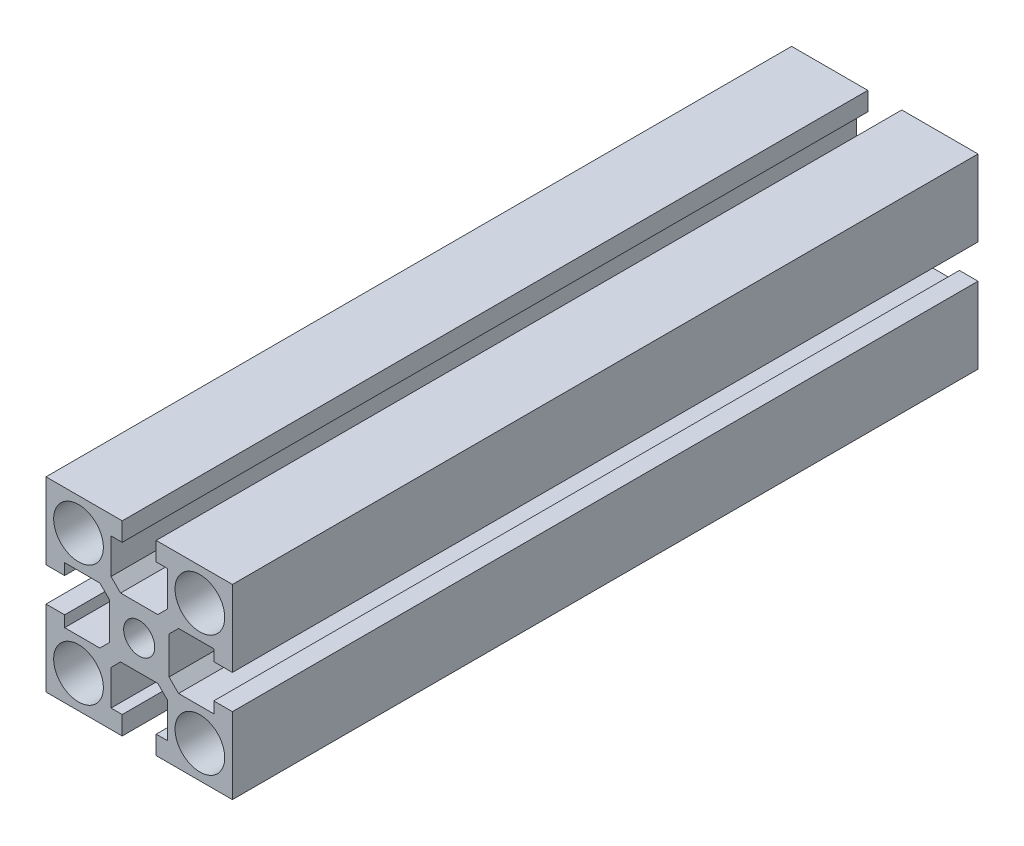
ISO-10303-21;
HEADER;
FILE_DESCRIPTION(('STEP AP214'),'2;1');
FILE_NAME('part.step','',(''),(''),'','','');
FILE_SCHEMA(('AUTOMOTIVE_DESIGN { 1 0 10303 214 1 1 1 1 }'));
ENDSEC;
DATA;
#1=APPLICATION_CONTEXT('core data for automotive mechanical design processes');
#2=APPLICATION_PROTOCOL_DEFINITION('international standard','automotive_design',2000,#1);
#3=PRODUCT_CONTEXT('',#1,'mechanical');
#4=PRODUCT('Part','Part','',(#3));
#5=PRODUCT_RELATED_PRODUCT_CATEGORY('part','',(#4));
#6=PRODUCT_DEFINITION_FORMATION('','',#4);
#7=PRODUCT_DEFINITION_CONTEXT('part definition',#1,'design');
#8=PRODUCT_DEFINITION('design','',#6,#7);
#9=PRODUCT_DEFINITION_SHAPE('','',#8);
#10=(LENGTH_UNIT() NAMED_UNIT(*) SI_UNIT(.MILLI.,.METRE.));
#11=(NAMED_UNIT(*) PLANE_ANGLE_UNIT() SI_UNIT($,.RADIAN.));
#12=(NAMED_UNIT(*) SI_UNIT($,.STERADIAN.) SOLID_ANGLE_UNIT());
#13=UNCERTAINTY_MEASURE_WITH_UNIT(LENGTH_MEASURE(1.E-05),#10,'distance_accuracy_value','');
#14=(GEOMETRIC_REPRESENTATION_CONTEXT(3) GLOBAL_UNCERTAINTY_ASSIGNED_CONTEXT((#13)) GLOBAL_UNIT_ASSIGNED_CONTEXT((#10,
#11,#12)) REPRESENTATION_CONTEXT('',''));
#15=CARTESIAN_POINT('',(0.,0.,0.));
#16=DIRECTION('',(0.,0.,1.));
#17=DIRECTION('',(1.,0.,0.));
#18=AXIS2_PLACEMENT_3D('',#15,#16,#17);
#19=CARTESIAN_POINT('',(-18.,-6.79999999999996,-90.));
#20=DIRECTION('',(1.,0.,0.));
#21=DIRECTION('',(0.,1.,0.));
#22=AXIS2_PLACEMENT_3D('',#19,#20,#21);
#23=PLANE('',#22);
#24=DIRECTION('',(0.,0.,1.));
#25=VECTOR('',#24,1.);
#26=CARTESIAN_POINT('',(-18.,-4.09999999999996,-90.));
#27=LINE('',#26,#25);
#28=CARTESIAN_POINT('',(-18.,-4.09999999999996,-90.));
#29=VERTEX_POINT('',#28);
#30=CARTESIAN_POINT('',(-18.,-4.09999999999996,90.));
#31=VERTEX_POINT('',#30);
#32=EDGE_CURVE('E314',#29,#31,#27,.T.);
#33=ORIENTED_EDGE('',*,*,#32,.T.);
#34=DIRECTION('',(0.,1.,0.));
#35=VECTOR('',#34,1.);
#36=CARTESIAN_POINT('',(-18.,-6.79999999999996,90.));
#37=LINE('',#36,#35);
#38=CARTESIAN_POINT('',(-18.,-6.79999999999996,90.));
#39=VERTEX_POINT('',#38);
#40=EDGE_CURVE('E317',#39,#31,#37,.T.);
#41=ORIENTED_EDGE('',*,*,#40,.F.);
#42=DIRECTION('',(0.,0.,1.));
#43=VECTOR('',#42,1.);
#44=CARTESIAN_POINT('',(-18.,-6.79999999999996,-90.));
#45=LINE('',#44,#43);
#46=CARTESIAN_POINT('',(-18.,-6.79999999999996,-90.));
#47=VERTEX_POINT('',#46);
#48=EDGE_CURVE('E11',#47,#39,#45,.T.);
#49=ORIENTED_EDGE('',*,*,#48,.F.);
#50=DIRECTION('',(0.,1.,0.));
#51=VECTOR('',#50,1.);
#52=CARTESIAN_POINT('',(-18.,-6.79999999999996,-90.));
#53=LINE('',#52,#51);
#54=EDGE_CURVE('E318',#47,#29,#53,.T.);
#55=ORIENTED_EDGE('',*,*,#54,.T.);
#56=EDGE_LOOP('',(#33,#41,#49,#55));
#57=FACE_BOUND('',#56,.T.);
#58=ADVANCED_FACE('F32',(#57),#23,.T.);
#59=CARTESIAN_POINT('',(-9.5,-6.79999999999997,-90.));
#60=DIRECTION('',(0.,1.,0.));
#61=DIRECTION('',(-1.,0.,0.));
#62=AXIS2_PLACEMENT_3D('',#59,#60,#61);
#63=PLANE('',#62);
#64=ORIENTED_EDGE('',*,*,#48,.T.);
#65=DIRECTION('',(-1.,0.,0.));
#66=VECTOR('',#65,1.);
#67=CARTESIAN_POINT('',(-9.5,-6.79999999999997,90.));
#68=LINE('',#67,#66);
#69=CARTESIAN_POINT('',(-9.5,-6.79999999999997,90.));
#70=VERTEX_POINT('',#69);
#71=EDGE_CURVE('E337',#70,#39,#68,.T.);
#72=ORIENTED_EDGE('',*,*,#71,.F.);
#73=DIRECTION('',(0.,0.,1.));
#74=VECTOR('',#73,1.);
#75=CARTESIAN_POINT('',(-9.5,-6.79999999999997,-90.));
#76=LINE('',#75,#74);
#77=CARTESIAN_POINT('',(-9.5,-6.79999999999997,-90.));
#78=VERTEX_POINT('',#77);
#79=EDGE_CURVE('E44',#78,#70,#76,.T.);
#80=ORIENTED_EDGE('',*,*,#79,.F.);
#81=DIRECTION('',(-1.,0.,0.));
#82=VECTOR('',#81,1.);
#83=CARTESIAN_POINT('',(-9.5,-6.79999999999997,-90.));
#84=LINE('',#83,#82);
#85=EDGE_CURVE('E323',#78,#47,#84,.T.);
#86=ORIENTED_EDGE('',*,*,#85,.T.);
#87=EDGE_LOOP('',(#64,#72,#80,#86));
#88=FACE_BOUND('',#87,.T.);
#89=ADVANCED_FACE('F733',(#88),#63,.T.);
#90=CARTESIAN_POINT('',(-7.2,-4.49999999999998,-90.));
#91=DIRECTION('',(-0.707106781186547,0.707106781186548,0.));
#92=DIRECTION('',(-0.707106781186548,-0.707106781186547,0.));
#93=AXIS2_PLACEMENT_3D('',#90,#91,#92);
#94=PLANE('',#93);
#95=ORIENTED_EDGE('',*,*,#79,.T.);
#96=DIRECTION('',(-0.707106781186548,-0.707106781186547,0.));
#97=VECTOR('',#96,1.);
#98=CARTESIAN_POINT('',(-7.2,-4.49999999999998,90.));
#99=LINE('',#98,#97);
#100=CARTESIAN_POINT('',(-7.2,-4.49999999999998,90.));
#101=VERTEX_POINT('',#100);
#102=EDGE_CURVE('E463',#101,#70,#99,.T.);
#103=ORIENTED_EDGE('',*,*,#102,.F.);
#104=DIRECTION('',(0.,0.,1.));
#105=VECTOR('',#104,1.);
#106=CARTESIAN_POINT('',(-7.2,-4.49999999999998,-90.));
#107=LINE('',#106,#105);
#108=CARTESIAN_POINT('',(-7.2,-4.49999999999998,-90.));
#109=VERTEX_POINT('',#108);
#110=EDGE_CURVE('E608',#109,#101,#107,.T.);
#111=ORIENTED_EDGE('',*,*,#110,.F.);
#112=DIRECTION('',(-0.707106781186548,-0.707106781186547,0.));
#113=VECTOR('',#112,1.);
#114=CARTESIAN_POINT('',(-7.2,-4.49999999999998,-90.));
#115=LINE('',#114,#113);
#116=EDGE_CURVE('E604',#109,#78,#115,.T.);
#117=ORIENTED_EDGE('',*,*,#116,.T.);
#118=EDGE_LOOP('',(#95,#103,#111,#117));
#119=FACE_BOUND('',#118,.T.);
#120=ADVANCED_FACE('F737',(#119),#94,.T.);
#121=CARTESIAN_POINT('',(-7.19999999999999,4.50000000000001,-90.));
#122=DIRECTION('',(-1.,0.,0.));
#123=DIRECTION('',(0.,-1.,0.));
#124=AXIS2_PLACEMENT_3D('',#121,#122,#123);
#125=PLANE('',#124);
#126=CARTESIAN_POINT('',(-7.19999999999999,0.,-67.5));
#127=DIRECTION('',(-1.,0.,0.));
#128=DIRECTION('',(0.,-1.,0.));
#129=AXIS2_PLACEMENT_3D('',#126,#127,#128);
#130=CIRCLE('',#129,3.49999999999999);
#131=CARTESIAN_POINT('',(-7.2,-3.49999999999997,-67.5));
#132=VERTEX_POINT('',#131);
#133=EDGE_CURVE('E1190',#132,#132,#130,.T.);
#134=ORIENTED_EDGE('',*,*,#133,.F.);
#135=EDGE_LOOP('',(#134));
#136=FACE_BOUND('',#135,.T.);
#137=CARTESIAN_POINT('',(-7.19999999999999,0.,-22.5));
#138=DIRECTION('',(-1.,0.,0.));
#139=DIRECTION('',(0.,-1.,0.));
#140=AXIS2_PLACEMENT_3D('',#137,#138,#139);
#141=CIRCLE('',#140,3.49999999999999);
#142=CARTESIAN_POINT('',(-7.2,-3.49999999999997,-22.5));
#143=VERTEX_POINT('',#142);
#144=EDGE_CURVE('E1138',#143,#143,#141,.T.);
#145=ORIENTED_EDGE('',*,*,#144,.F.);
#146=EDGE_LOOP('',(#145));
#147=FACE_BOUND('',#146,.T.);
#148=CARTESIAN_POINT('',(-7.19999999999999,0.,22.5));
#149=DIRECTION('',(-1.,0.,0.));
#150=DIRECTION('',(0.,-1.,0.));
#151=AXIS2_PLACEMENT_3D('',#148,#149,#150);
#152=CIRCLE('',#151,3.49999999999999);
#153=CARTESIAN_POINT('',(-7.2,-3.49999999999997,22.5));
#154=VERTEX_POINT('',#153);
#155=EDGE_CURVE('E1149',#154,#154,#152,.T.);
#156=ORIENTED_EDGE('',*,*,#155,.F.);
#157=EDGE_LOOP('',(#156));
#158=FACE_BOUND('',#157,.T.);
#159=CARTESIAN_POINT('',(-7.19999999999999,0.,67.5));
#160=DIRECTION('',(-1.,0.,0.));
#161=DIRECTION('',(0.,-1.,0.));
#162=AXIS2_PLACEMENT_3D('',#159,#160,#161);
#163=CIRCLE('',#162,3.49999999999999);
#164=CARTESIAN_POINT('',(-7.2,-3.49999999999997,67.5));
#165=VERTEX_POINT('',#164);
#166=EDGE_CURVE('E1022',#165,#165,#163,.T.);
#167=ORIENTED_EDGE('',*,*,#166,.F.);
#168=EDGE_LOOP('',(#167));
#169=FACE_BOUND('',#168,.T.);
#170=ORIENTED_EDGE('',*,*,#110,.T.);
#171=DIRECTION('',(0.,-1.,0.));
#172=VECTOR('',#171,1.);
#173=CARTESIAN_POINT('',(-7.19999999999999,4.50000000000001,90.));
#174=LINE('',#173,#172);
#175=CARTESIAN_POINT('',(-7.19999999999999,4.50000000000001,90.));
#176=VERTEX_POINT('',#175);
#177=EDGE_CURVE('E460',#176,#101,#174,.T.);
#178=ORIENTED_EDGE('',*,*,#177,.F.);
#179=DIRECTION('',(0.,0.,1.));
#180=VECTOR('',#179,1.);
#181=CARTESIAN_POINT('',(-7.19999999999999,4.50000000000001,-90.));
#182=LINE('',#181,#180);
#183=CARTESIAN_POINT('',(-7.19999999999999,4.50000000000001,-90.));
#184=VERTEX_POINT('',#183);
#185=EDGE_CURVE('E610',#184,#176,#182,.T.);
#186=ORIENTED_EDGE('',*,*,#185,.F.);
#187=DIRECTION('',(0.,-1.,0.));
#188=VECTOR('',#187,1.);
#189=CARTESIAN_POINT('',(-7.19999999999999,4.50000000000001,-90.));
#190=LINE('',#189,#188);
#191=EDGE_CURVE('E601',#184,#109,#190,.T.);
#192=ORIENTED_EDGE('',*,*,#191,.T.);
#193=EDGE_LOOP('',(#170,#178,#186,#192));
#194=FACE_BOUND('',#193,.T.);
#195=ADVANCED_FACE('F742',(#136,#147,#158,#169,#194),#125,.T.);
#196=CARTESIAN_POINT('',(-9.50000000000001,6.80000000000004,-90.));
#197=DIRECTION('',(-0.707106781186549,-0.707106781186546,0.));
#198=DIRECTION('',(0.707106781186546,-0.707106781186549,0.));
#199=AXIS2_PLACEMENT_3D('',#196,#197,#198);
#200=PLANE('',#199);
#201=ORIENTED_EDGE('',*,*,#185,.T.);
#202=DIRECTION('',(0.707106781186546,-0.707106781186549,0.));
#203=VECTOR('',#202,1.);
#204=CARTESIAN_POINT('',(-9.50000000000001,6.80000000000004,90.));
#205=LINE('',#204,#203);
#206=CARTESIAN_POINT('',(-9.50000000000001,6.80000000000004,90.));
#207=VERTEX_POINT('',#206);
#208=EDGE_CURVE('E457',#207,#176,#205,.T.);
#209=ORIENTED_EDGE('',*,*,#208,.F.);
#210=DIRECTION('',(0.,0.,1.));
#211=VECTOR('',#210,1.);
#212=CARTESIAN_POINT('',(-9.50000000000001,6.80000000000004,-90.));
#213=LINE('',#212,#211);
#214=CARTESIAN_POINT('',(-9.50000000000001,6.80000000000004,-90.));
#215=VERTEX_POINT('',#214);
#216=EDGE_CURVE('E612',#215,#207,#213,.T.);
#217=ORIENTED_EDGE('',*,*,#216,.F.);
#218=DIRECTION('',(0.707106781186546,-0.707106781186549,0.));
#219=VECTOR('',#218,1.);
#220=CARTESIAN_POINT('',(-9.50000000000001,6.80000000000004,-90.));
#221=LINE('',#220,#219);
#222=EDGE_CURVE('E598',#215,#184,#221,.T.);
#223=ORIENTED_EDGE('',*,*,#222,.T.);
#224=EDGE_LOOP('',(#201,#209,#217,#223));
#225=FACE_BOUND('',#224,.T.);
#226=ADVANCED_FACE('F751',(#225),#200,.T.);
#227=CARTESIAN_POINT('',(-18.,6.80000000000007,-90.));
#228=DIRECTION('',(0.,-1.,0.));
#229=DIRECTION('',(1.,0.,0.));
#230=AXIS2_PLACEMENT_3D('',#227,#228,#229);
#231=PLANE('',#230);
#232=ORIENTED_EDGE('',*,*,#216,.T.);
#233=DIRECTION('',(1.,0.,0.));
#234=VECTOR('',#233,1.);
#235=CARTESIAN_POINT('',(-18.,6.80000000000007,90.));
#236=LINE('',#235,#234);
#237=CARTESIAN_POINT('',(-18.,6.80000000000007,90.));
#238=VERTEX_POINT('',#237);
#239=EDGE_CURVE('E454',#238,#207,#236,.T.);
#240=ORIENTED_EDGE('',*,*,#239,.F.);
#241=DIRECTION('',(0.,0.,1.));
#242=VECTOR('',#241,1.);
#243=CARTESIAN_POINT('',(-18.,6.80000000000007,-90.));
#244=LINE('',#243,#242);
#245=CARTESIAN_POINT('',(-18.,6.80000000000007,-90.));
#246=VERTEX_POINT('',#245);
#247=EDGE_CURVE('E614',#246,#238,#244,.T.);
#248=ORIENTED_EDGE('',*,*,#247,.F.);
#249=DIRECTION('',(1.,0.,0.));
#250=VECTOR('',#249,1.);
#251=CARTESIAN_POINT('',(-18.,6.80000000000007,-90.));
#252=LINE('',#251,#250);
#253=EDGE_CURVE('E595',#246,#215,#252,.T.);
#254=ORIENTED_EDGE('',*,*,#253,.T.);
#255=EDGE_LOOP('',(#232,#240,#248,#254));
#256=FACE_BOUND('',#255,.T.);
#257=ADVANCED_FACE('F755',(#256),#231,.T.);
#258=CARTESIAN_POINT('',(-18.,4.10000000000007,-90.));
#259=DIRECTION('',(1.,0.,0.));
#260=DIRECTION('',(0.,0.,-1.));
#261=AXIS2_PLACEMENT_3D('',#258,#259,#260);
#262=PLANE('',#261);
#263=ORIENTED_EDGE('',*,*,#247,.T.);
#264=DIRECTION('',(0.,1.,0.));
#265=VECTOR('',#264,1.);
#266=CARTESIAN_POINT('',(-18.,4.10000000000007,90.));
#267=LINE('',#266,#265);
#268=CARTESIAN_POINT('',(-18.,4.10000000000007,90.));
#269=VERTEX_POINT('',#268);
#270=EDGE_CURVE('E451',#269,#238,#267,.T.);
#271=ORIENTED_EDGE('',*,*,#270,.F.);
#272=DIRECTION('',(0.,0.,1.));
#273=VECTOR('',#272,1.);
#274=CARTESIAN_POINT('',(-18.,4.10000000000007,-90.));
#275=LINE('',#274,#273);
#276=CARTESIAN_POINT('',(-18.,4.10000000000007,-90.));
#277=VERTEX_POINT('',#276);
#278=EDGE_CURVE('E616',#277,#269,#275,.T.);
#279=ORIENTED_EDGE('',*,*,#278,.F.);
#280=DIRECTION('',(0.,1.,0.));
#281=VECTOR('',#280,1.);
#282=CARTESIAN_POINT('',(-18.,4.10000000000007,-90.));
#283=LINE('',#282,#281);
#284=EDGE_CURVE('E592',#277,#246,#283,.T.);
#285=ORIENTED_EDGE('',*,*,#284,.T.);
#286=EDGE_LOOP('',(#263,#271,#279,#285));
#287=FACE_BOUND('',#286,.T.);
#288=ADVANCED_FACE('F759',(#287),#262,.T.);
#289=CARTESIAN_POINT('',(-22.5,4.10000000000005,-90.));
#290=DIRECTION('',(0.,-1.,0.));
#291=DIRECTION('',(1.,0.,0.));
#292=AXIS2_PLACEMENT_3D('',#289,#290,#291);
#293=PLANE('',#292);
#294=ORIENTED_EDGE('',*,*,#278,.T.);
#295=DIRECTION('',(1.,0.,0.));
#296=VECTOR('',#295,1.);
#297=CARTESIAN_POINT('',(-22.5,4.10000000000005,90.));
#298=LINE('',#297,#296);
#299=CARTESIAN_POINT('',(-22.5,4.10000000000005,90.));
#300=VERTEX_POINT('',#299);
#301=EDGE_CURVE('E448',#300,#269,#298,.T.);
#302=ORIENTED_EDGE('',*,*,#301,.F.);
#303=DIRECTION('',(0.,0.,1.));
#304=VECTOR('',#303,1.);
#305=CARTESIAN_POINT('',(-22.5,4.10000000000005,-90.));
#306=LINE('',#305,#304);
#307=CARTESIAN_POINT('',(-22.5,4.10000000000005,-90.));
#308=VERTEX_POINT('',#307);
#309=EDGE_CURVE('E618',#308,#300,#306,.T.);
#310=ORIENTED_EDGE('',*,*,#309,.F.);
#311=DIRECTION('',(1.,0.,0.));
#312=VECTOR('',#311,1.);
#313=CARTESIAN_POINT('',(-22.5,4.10000000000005,-90.));
#314=LINE('',#313,#312);
#315=EDGE_CURVE('E589',#308,#277,#314,.T.);
#316=ORIENTED_EDGE('',*,*,#315,.T.);
#317=EDGE_LOOP('',(#294,#302,#310,#316));
#318=FACE_BOUND('',#317,.T.);
#319=ADVANCED_FACE('F763',(#318),#293,.T.);
#320=CARTESIAN_POINT('',(-22.5,22.4999999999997,-90.));
#321=DIRECTION('',(-1.,0.,0.));
#322=DIRECTION('',(0.,-1.,0.));
#323=AXIS2_PLACEMENT_3D('',#320,#321,#322);
#324=PLANE('',#323);
#325=ORIENTED_EDGE('',*,*,#309,.T.);
#326=DIRECTION('',(0.,-1.,0.));
#327=VECTOR('',#326,1.);
#328=CARTESIAN_POINT('',(-22.5,22.4999999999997,90.));
#329=LINE('',#328,#327);
#330=CARTESIAN_POINT('',(-22.5,22.4999999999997,90.));
#331=VERTEX_POINT('',#330);
#332=EDGE_CURVE('E445',#331,#300,#329,.T.);
#333=ORIENTED_EDGE('',*,*,#332,.F.);
#334=DIRECTION('',(0.,0.,1.));
#335=VECTOR('',#334,1.);
#336=CARTESIAN_POINT('',(-22.5,22.4999999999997,-90.));
#337=LINE('',#336,#335);
#338=CARTESIAN_POINT('',(-22.5,22.4999999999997,-90.));
#339=VERTEX_POINT('',#338);
#340=EDGE_CURVE('E620',#339,#331,#337,.T.);
#341=ORIENTED_EDGE('',*,*,#340,.F.);
#342=DIRECTION('',(0.,-1.,0.));
#343=VECTOR('',#342,1.);
#344=CARTESIAN_POINT('',(-22.5,22.4999999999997,-90.));
#345=LINE('',#344,#343);
#346=EDGE_CURVE('E586',#339,#308,#345,.T.);
#347=ORIENTED_EDGE('',*,*,#346,.T.);
#348=EDGE_LOOP('',(#325,#333,#341,#347));
#349=FACE_BOUND('',#348,.T.);
#350=ADVANCED_FACE('F767',(#349),#324,.T.);
#351=CARTESIAN_POINT('',(-4.1,22.4999999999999,-90.));
#352=DIRECTION('',(0.,1.,0.));
#353=DIRECTION('',(-1.,0.,0.));
#354=AXIS2_PLACEMENT_3D('',#351,#352,#353);
#355=PLANE('',#354);
#356=ORIENTED_EDGE('',*,*,#340,.T.);
#357=DIRECTION('',(-1.,0.,0.));
#358=VECTOR('',#357,1.);
#359=CARTESIAN_POINT('',(-4.1,22.4999999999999,90.));
#360=LINE('',#359,#358);
#361=CARTESIAN_POINT('',(-4.1,22.4999999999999,90.));
#362=VERTEX_POINT('',#361);
#363=EDGE_CURVE('E442',#362,#331,#360,.T.);
#364=ORIENTED_EDGE('',*,*,#363,.F.);
#365=DIRECTION('',(0.,0.,1.));
#366=VECTOR('',#365,1.);
#367=CARTESIAN_POINT('',(-4.1,22.4999999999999,-90.));
#368=LINE('',#367,#366);
#369=CARTESIAN_POINT('',(-4.1,22.4999999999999,-90.));
#370=VERTEX_POINT('',#369);
#371=EDGE_CURVE('E622',#370,#362,#368,.T.);
#372=ORIENTED_EDGE('',*,*,#371,.F.);
#373=DIRECTION('',(-1.,0.,0.));
#374=VECTOR('',#373,1.);
#375=CARTESIAN_POINT('',(-4.1,22.4999999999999,-90.));
#376=LINE('',#375,#374);
#377=EDGE_CURVE('E583',#370,#339,#376,.T.);
#378=ORIENTED_EDGE('',*,*,#377,.T.);
#379=EDGE_LOOP('',(#356,#364,#372,#378));
#380=FACE_BOUND('',#379,.T.);
#381=ADVANCED_FACE('F771',(#380),#355,.T.);
#382=CARTESIAN_POINT('',(-4.09999999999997,18.,-90.));
#383=DIRECTION('',(1.,0.,0.));
#384=DIRECTION('',(0.,1.,0.));
#385=AXIS2_PLACEMENT_3D('',#382,#383,#384);
#386=PLANE('',#385);
#387=ORIENTED_EDGE('',*,*,#371,.T.);
#388=DIRECTION('',(0.,1.,0.));
#389=VECTOR('',#388,1.);
#390=CARTESIAN_POINT('',(-4.09999999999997,18.,90.));
#391=LINE('',#390,#389);
#392=CARTESIAN_POINT('',(-4.09999999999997,18.,90.));
#393=VERTEX_POINT('',#392);
#394=EDGE_CURVE('E439',#393,#362,#391,.T.);
#395=ORIENTED_EDGE('',*,*,#394,.F.);
#396=DIRECTION('',(0.,0.,1.));
#397=VECTOR('',#396,1.);
#398=CARTESIAN_POINT('',(-4.09999999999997,18.,-90.));
#399=LINE('',#398,#397);
#400=CARTESIAN_POINT('',(-4.09999999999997,18.,-90.));
#401=VERTEX_POINT('',#400);
#402=EDGE_CURVE('E624',#401,#393,#399,.T.);
#403=ORIENTED_EDGE('',*,*,#402,.F.);
#404=DIRECTION('',(0.,1.,0.));
#405=VECTOR('',#404,1.);
#406=CARTESIAN_POINT('',(-4.09999999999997,18.,-90.));
#407=LINE('',#406,#405);
#408=EDGE_CURVE('E580',#401,#370,#407,.T.);
#409=ORIENTED_EDGE('',*,*,#408,.T.);
#410=EDGE_LOOP('',(#387,#395,#403,#409));
#411=FACE_BOUND('',#410,.T.);
#412=ADVANCED_FACE('F775',(#411),#386,.T.);
#413=CARTESIAN_POINT('',(-6.8,18.,-90.));
#414=DIRECTION('',(0.,-1.,0.));
#415=DIRECTION('',(1.,0.,0.));
#416=AXIS2_PLACEMENT_3D('',#413,#414,#415);
#417=PLANE('',#416);
#418=ORIENTED_EDGE('',*,*,#402,.T.);
#419=DIRECTION('',(1.,0.,0.));
#420=VECTOR('',#419,1.);
#421=CARTESIAN_POINT('',(-6.8,18.,90.));
#422=LINE('',#421,#420);
#423=CARTESIAN_POINT('',(-6.8,18.,90.));
#424=VERTEX_POINT('',#423);
#425=EDGE_CURVE('E436',#424,#393,#422,.T.);
#426=ORIENTED_EDGE('',*,*,#425,.F.);
#427=DIRECTION('',(0.,0.,1.));
#428=VECTOR('',#427,1.);
#429=CARTESIAN_POINT('',(-6.8,18.,-90.));
#430=LINE('',#429,#428);
#431=CARTESIAN_POINT('',(-6.8,18.,-90.));
#432=VERTEX_POINT('',#431);
#433=EDGE_CURVE('E626',#432,#424,#430,.T.);
#434=ORIENTED_EDGE('',*,*,#433,.F.);
#435=DIRECTION('',(1.,0.,0.));
#436=VECTOR('',#435,1.);
#437=CARTESIAN_POINT('',(-6.8,18.,-90.));
#438=LINE('',#437,#436);
#439=EDGE_CURVE('E577',#432,#401,#438,.T.);
#440=ORIENTED_EDGE('',*,*,#439,.T.);
#441=EDGE_LOOP('',(#418,#426,#434,#440));
#442=FACE_BOUND('',#441,.T.);
#443=ADVANCED_FACE('F779',(#442),#417,.T.);
#444=CARTESIAN_POINT('',(-6.79999999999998,9.50000000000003,-90.));
#445=DIRECTION('',(1.,0.,0.));
#446=DIRECTION('',(0.,1.,0.));
#447=AXIS2_PLACEMENT_3D('',#444,#445,#446);
#448=PLANE('',#447);
#449=ORIENTED_EDGE('',*,*,#433,.T.);
#450=DIRECTION('',(0.,1.,0.));
#451=VECTOR('',#450,1.);
#452=CARTESIAN_POINT('',(-6.79999999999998,9.50000000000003,90.));
#453=LINE('',#452,#451);
#454=CARTESIAN_POINT('',(-6.79999999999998,9.50000000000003,90.));
#455=VERTEX_POINT('',#454);
#456=EDGE_CURVE('E433',#455,#424,#453,.T.);
#457=ORIENTED_EDGE('',*,*,#456,.F.);
#458=DIRECTION('',(0.,0.,1.));
#459=VECTOR('',#458,1.);
#460=CARTESIAN_POINT('',(-6.79999999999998,9.50000000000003,-90.));
#461=LINE('',#460,#459);
#462=CARTESIAN_POINT('',(-6.79999999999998,9.50000000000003,-90.));
#463=VERTEX_POINT('',#462);
#464=EDGE_CURVE('E628',#463,#455,#461,.T.);
#465=ORIENTED_EDGE('',*,*,#464,.F.);
#466=DIRECTION('',(0.,1.,0.));
#467=VECTOR('',#466,1.);
#468=CARTESIAN_POINT('',(-6.79999999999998,9.50000000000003,-90.));
#469=LINE('',#468,#467);
#470=EDGE_CURVE('E574',#463,#432,#469,.T.);
#471=ORIENTED_EDGE('',*,*,#470,.T.);
#472=EDGE_LOOP('',(#449,#457,#465,#471));
#473=FACE_BOUND('',#472,.T.);
#474=ADVANCED_FACE('F783',(#473),#448,.T.);
#475=CARTESIAN_POINT('',(-4.49999999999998,7.20000000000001,-90.));
#476=DIRECTION('',(0.70710678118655,0.707106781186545,0.));
#477=DIRECTION('',(-0.707106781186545,0.70710678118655,0.));
#478=AXIS2_PLACEMENT_3D('',#475,#476,#477);
#479=PLANE('',#478);
#480=ORIENTED_EDGE('',*,*,#464,.T.);
#481=DIRECTION('',(-0.707106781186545,0.70710678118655,0.));
#482=VECTOR('',#481,1.);
#483=CARTESIAN_POINT('',(-4.49999999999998,7.20000000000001,90.));
#484=LINE('',#483,#482);
#485=CARTESIAN_POINT('',(-4.49999999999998,7.20000000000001,90.));
#486=VERTEX_POINT('',#485);
#487=EDGE_CURVE('E430',#486,#455,#484,.T.);
#488=ORIENTED_EDGE('',*,*,#487,.F.);
#489=DIRECTION('',(0.,0.,1.));
#490=VECTOR('',#489,1.);
#491=CARTESIAN_POINT('',(-4.49999999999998,7.20000000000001,-90.));
#492=LINE('',#491,#490);
#493=CARTESIAN_POINT('',(-4.49999999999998,7.20000000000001,-90.));
#494=VERTEX_POINT('',#493);
#495=EDGE_CURVE('E630',#494,#486,#492,.T.);
#496=ORIENTED_EDGE('',*,*,#495,.F.);
#497=DIRECTION('',(-0.707106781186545,0.70710678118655,0.));
#498=VECTOR('',#497,1.);
#499=CARTESIAN_POINT('',(-4.49999999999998,7.20000000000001,-90.));
#500=LINE('',#499,#498);
#501=EDGE_CURVE('E571',#494,#463,#500,.T.);
#502=ORIENTED_EDGE('',*,*,#501,.T.);
#503=EDGE_LOOP('',(#480,#488,#496,#502));
#504=FACE_BOUND('',#503,.T.);
#505=ADVANCED_FACE('F787',(#504),#479,.T.);
#506=CARTESIAN_POINT('',(4.50000000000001,7.2,-90.));
#507=DIRECTION('',(0.,1.,0.));
#508=DIRECTION('',(-1.,0.,0.));
#509=AXIS2_PLACEMENT_3D('',#506,#507,#508);
#510=PLANE('',#509);
#511=ORIENTED_EDGE('',*,*,#495,.T.);
#512=DIRECTION('',(-1.,0.,0.));
#513=VECTOR('',#512,1.);
#514=CARTESIAN_POINT('',(4.50000000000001,7.2,90.));
#515=LINE('',#514,#513);
#516=CARTESIAN_POINT('',(4.50000000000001,7.2,90.));
#517=VERTEX_POINT('',#516);
#518=EDGE_CURVE('E427',#517,#486,#515,.T.);
#519=ORIENTED_EDGE('',*,*,#518,.F.);
#520=DIRECTION('',(0.,0.,1.));
#521=VECTOR('',#520,1.);
#522=CARTESIAN_POINT('',(4.50000000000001,7.2,-90.));
#523=LINE('',#522,#521);
#524=CARTESIAN_POINT('',(4.50000000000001,7.2,-90.));
#525=VERTEX_POINT('',#524);
#526=EDGE_CURVE('E632',#525,#517,#523,.T.);
#527=ORIENTED_EDGE('',*,*,#526,.F.);
#528=DIRECTION('',(-1.,0.,0.));
#529=VECTOR('',#528,1.);
#530=CARTESIAN_POINT('',(4.50000000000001,7.2,-90.));
#531=LINE('',#530,#529);
#532=EDGE_CURVE('E568',#525,#494,#531,.T.);
#533=ORIENTED_EDGE('',*,*,#532,.T.);
#534=EDGE_LOOP('',(#511,#519,#527,#533));
#535=FACE_BOUND('',#534,.T.);
#536=ADVANCED_FACE('F791',(#535),#510,.T.);
#537=CARTESIAN_POINT('',(6.80000000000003,9.5,-90.));
#538=DIRECTION('',(-0.707106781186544,0.707106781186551,0.));
#539=DIRECTION('',(-0.707106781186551,-0.707106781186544,0.));
#540=AXIS2_PLACEMENT_3D('',#537,#538,#539);
#541=PLANE('',#540);
#542=ORIENTED_EDGE('',*,*,#526,.T.);
#543=DIRECTION('',(-0.707106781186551,-0.707106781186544,0.));
#544=VECTOR('',#543,1.);
#545=CARTESIAN_POINT('',(6.80000000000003,9.5,90.));
#546=LINE('',#545,#544);
#547=CARTESIAN_POINT('',(6.80000000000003,9.5,90.));
#548=VERTEX_POINT('',#547);
#549=EDGE_CURVE('E424',#548,#517,#546,.T.);
#550=ORIENTED_EDGE('',*,*,#549,.F.);
#551=DIRECTION('',(0.,0.,1.));
#552=VECTOR('',#551,1.);
#553=CARTESIAN_POINT('',(6.80000000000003,9.5,-90.));
#554=LINE('',#553,#552);
#555=CARTESIAN_POINT('',(6.80000000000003,9.5,-90.));
#556=VERTEX_POINT('',#555);
#557=EDGE_CURVE('E634',#556,#548,#554,.T.);
#558=ORIENTED_EDGE('',*,*,#557,.F.);
#559=DIRECTION('',(-0.707106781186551,-0.707106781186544,0.));
#560=VECTOR('',#559,1.);
#561=CARTESIAN_POINT('',(6.80000000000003,9.5,-90.));
#562=LINE('',#561,#560);
#563=EDGE_CURVE('E565',#556,#525,#562,.T.);
#564=ORIENTED_EDGE('',*,*,#563,.T.);
#565=EDGE_LOOP('',(#542,#550,#558,#564));
#566=FACE_BOUND('',#565,.T.);
#567=ADVANCED_FACE('F795',(#566),#541,.T.);
#568=CARTESIAN_POINT('',(6.80000000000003,18.,-90.));
#569=DIRECTION('',(-1.,0.,0.));
#570=DIRECTION('',(0.,-1.,0.));
#571=AXIS2_PLACEMENT_3D('',#568,#569,#570);
#572=PLANE('',#571);
#573=ORIENTED_EDGE('',*,*,#557,.T.);
#574=DIRECTION('',(0.,-1.,0.));
#575=VECTOR('',#574,1.);
#576=CARTESIAN_POINT('',(6.80000000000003,18.,90.));
#577=LINE('',#576,#575);
#578=CARTESIAN_POINT('',(6.80000000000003,18.,90.));
#579=VERTEX_POINT('',#578);
#580=EDGE_CURVE('E421',#579,#548,#577,.T.);
#581=ORIENTED_EDGE('',*,*,#580,.F.);
#582=DIRECTION('',(0.,0.,1.));
#583=VECTOR('',#582,1.);
#584=CARTESIAN_POINT('',(6.80000000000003,18.,-90.));
#585=LINE('',#584,#583);
#586=CARTESIAN_POINT('',(6.80000000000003,18.,-90.));
#587=VERTEX_POINT('',#586);
#588=EDGE_CURVE('E636',#587,#579,#585,.T.);
#589=ORIENTED_EDGE('',*,*,#588,.F.);
#590=DIRECTION('',(0.,-1.,0.));
#591=VECTOR('',#590,1.);
#592=CARTESIAN_POINT('',(6.80000000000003,18.,-90.));
#593=LINE('',#592,#591);
#594=EDGE_CURVE('E562',#587,#556,#593,.T.);
#595=ORIENTED_EDGE('',*,*,#594,.T.);
#596=EDGE_LOOP('',(#573,#581,#589,#595));
#597=FACE_BOUND('',#596,.T.);
#598=ADVANCED_FACE('F799',(#597),#572,.T.);
#599=CARTESIAN_POINT('',(4.10000000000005,18.,-90.));
#600=DIRECTION('',(0.,-1.,0.));
#601=DIRECTION('',(1.,0.,0.));
#602=AXIS2_PLACEMENT_3D('',#599,#600,#601);
#603=PLANE('',#602);
#604=ORIENTED_EDGE('',*,*,#588,.T.);
#605=DIRECTION('',(1.,0.,0.));
#606=VECTOR('',#605,1.);
#607=CARTESIAN_POINT('',(4.10000000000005,18.,90.));
#608=LINE('',#607,#606);
#609=CARTESIAN_POINT('',(4.10000000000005,18.,90.));
#610=VERTEX_POINT('',#609);
#611=EDGE_CURVE('E418',#610,#579,#608,.T.);
#612=ORIENTED_EDGE('',*,*,#611,.F.);
#613=DIRECTION('',(0.,0.,1.));
#614=VECTOR('',#613,1.);
#615=CARTESIAN_POINT('',(4.10000000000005,18.,-90.));
#616=LINE('',#615,#614);
#617=CARTESIAN_POINT('',(4.10000000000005,18.,-90.));
#618=VERTEX_POINT('',#617);
#619=EDGE_CURVE('E638',#618,#610,#616,.T.);
#620=ORIENTED_EDGE('',*,*,#619,.F.);
#621=DIRECTION('',(1.,0.,0.));
#622=VECTOR('',#621,1.);
#623=CARTESIAN_POINT('',(4.10000000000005,18.,-90.));
#624=LINE('',#623,#622);
#625=EDGE_CURVE('E559',#618,#587,#624,.T.);
#626=ORIENTED_EDGE('',*,*,#625,.T.);
#627=EDGE_LOOP('',(#604,#612,#620,#626));
#628=FACE_BOUND('',#627,.T.);
#629=ADVANCED_FACE('F803',(#628),#603,.T.);
#630=CARTESIAN_POINT('',(4.10000000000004,22.5,-90.));
#631=DIRECTION('',(-1.,0.,0.));
#632=DIRECTION('',(0.,-1.,0.));
#633=AXIS2_PLACEMENT_3D('',#630,#631,#632);
#634=PLANE('',#633);
#635=ORIENTED_EDGE('',*,*,#619,.T.);
#636=DIRECTION('',(0.,-1.,0.));
#637=VECTOR('',#636,1.);
#638=CARTESIAN_POINT('',(4.10000000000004,22.5,90.));
#639=LINE('',#638,#637);
#640=CARTESIAN_POINT('',(4.10000000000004,22.5,90.));
#641=VERTEX_POINT('',#640);
#642=EDGE_CURVE('E415',#641,#610,#639,.T.);
#643=ORIENTED_EDGE('',*,*,#642,.F.);
#644=DIRECTION('',(0.,0.,1.));
#645=VECTOR('',#644,1.);
#646=CARTESIAN_POINT('',(4.10000000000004,22.5,-90.));
#647=LINE('',#646,#645);
#648=CARTESIAN_POINT('',(4.10000000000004,22.5,-90.));
#649=VERTEX_POINT('',#648);
#650=EDGE_CURVE('E640',#649,#641,#647,.T.);
#651=ORIENTED_EDGE('',*,*,#650,.F.);
#652=DIRECTION('',(0.,-1.,0.));
#653=VECTOR('',#652,1.);
#654=CARTESIAN_POINT('',(4.10000000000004,22.5,-90.));
#655=LINE('',#654,#653);
#656=EDGE_CURVE('E556',#649,#618,#655,.T.);
#657=ORIENTED_EDGE('',*,*,#656,.T.);
#658=EDGE_LOOP('',(#635,#643,#651,#657));
#659=FACE_BOUND('',#658,.T.);
#660=ADVANCED_FACE('F807',(#659),#634,.T.);
#661=CARTESIAN_POINT('',(22.5,22.5,-90.));
#662=DIRECTION('',(0.,1.,0.));
#663=DIRECTION('',(-1.,0.,0.));
#664=AXIS2_PLACEMENT_3D('',#661,#662,#663);
#665=PLANE('',#664);
#666=ORIENTED_EDGE('',*,*,#650,.T.);
#667=DIRECTION('',(-1.,0.,0.));
#668=VECTOR('',#667,1.);
#669=CARTESIAN_POINT('',(22.5,22.5,90.));
#670=LINE('',#669,#668);
#671=CARTESIAN_POINT('',(22.5,22.5,90.));
#672=VERTEX_POINT('',#671);
#673=EDGE_CURVE('E412',#672,#641,#670,.T.);
#674=ORIENTED_EDGE('',*,*,#673,.F.);
#675=DIRECTION('',(0.,0.,1.));
#676=VECTOR('',#675,1.);
#677=CARTESIAN_POINT('',(22.5,22.5,-90.));
#678=LINE('',#677,#676);
#679=CARTESIAN_POINT('',(22.5,22.5,-90.));
#680=VERTEX_POINT('',#679);
#681=EDGE_CURVE('E642',#680,#672,#678,.T.);
#682=ORIENTED_EDGE('',*,*,#681,.F.);
#683=DIRECTION('',(-1.,0.,0.));
#684=VECTOR('',#683,1.);
#685=CARTESIAN_POINT('',(22.5,22.5,-90.));
#686=LINE('',#685,#684);
#687=EDGE_CURVE('E553',#680,#649,#686,.T.);
#688=ORIENTED_EDGE('',*,*,#687,.T.);
#689=EDGE_LOOP('',(#666,#674,#682,#688));
#690=FACE_BOUND('',#689,.T.);
#691=ADVANCED_FACE('F811',(#690),#665,.T.);
#692=CARTESIAN_POINT('',(22.5,4.09999999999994,-90.));
#693=DIRECTION('',(1.,0.,0.));
#694=DIRECTION('',(0.,1.,0.));
#695=AXIS2_PLACEMENT_3D('',#692,#693,#694);
#696=PLANE('',#695);
#697=ORIENTED_EDGE('',*,*,#681,.T.);
#698=DIRECTION('',(0.,1.,0.));
#699=VECTOR('',#698,1.);
#700=CARTESIAN_POINT('',(22.5,4.09999999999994,90.));
#701=LINE('',#700,#699);
#702=CARTESIAN_POINT('',(22.5,4.09999999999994,90.));
#703=VERTEX_POINT('',#702);
#704=EDGE_CURVE('E409',#703,#672,#701,.T.);
#705=ORIENTED_EDGE('',*,*,#704,.F.);
#706=DIRECTION('',(0.,0.,1.));
#707=VECTOR('',#706,1.);
#708=CARTESIAN_POINT('',(22.5,4.09999999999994,-90.));
#709=LINE('',#708,#707);
#710=CARTESIAN_POINT('',(22.5,4.09999999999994,-90.));
#711=VERTEX_POINT('',#710);
#712=EDGE_CURVE('E644',#711,#703,#709,.T.);
#713=ORIENTED_EDGE('',*,*,#712,.F.);
#714=DIRECTION('',(0.,1.,0.));
#715=VECTOR('',#714,1.);
#716=CARTESIAN_POINT('',(22.5,4.09999999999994,-90.));
#717=LINE('',#716,#715);
#718=EDGE_CURVE('E550',#711,#680,#717,.T.);
#719=ORIENTED_EDGE('',*,*,#718,.T.);
#720=EDGE_LOOP('',(#697,#705,#713,#719));
#721=FACE_BOUND('',#720,.T.);
#722=ADVANCED_FACE('F815',(#721),#696,.T.);
#723=CARTESIAN_POINT('',(18.,4.09999999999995,-90.));
#724=DIRECTION('',(0.,-1.,0.));
#725=DIRECTION('',(1.,0.,0.));
#726=AXIS2_PLACEMENT_3D('',#723,#724,#725);
#727=PLANE('',#726);
#728=ORIENTED_EDGE('',*,*,#712,.T.);
#729=DIRECTION('',(1.,0.,0.));
#730=VECTOR('',#729,1.);
#731=CARTESIAN_POINT('',(18.,4.09999999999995,90.));
#732=LINE('',#731,#730);
#733=CARTESIAN_POINT('',(18.,4.09999999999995,90.));
#734=VERTEX_POINT('',#733);
#735=EDGE_CURVE('E406',#734,#703,#732,.T.);
#736=ORIENTED_EDGE('',*,*,#735,.F.);
#737=DIRECTION('',(0.,0.,1.));
#738=VECTOR('',#737,1.);
#739=CARTESIAN_POINT('',(18.,4.09999999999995,-90.));
#740=LINE('',#739,#738);
#741=CARTESIAN_POINT('',(18.,4.09999999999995,-90.));
#742=VERTEX_POINT('',#741);
#743=EDGE_CURVE('E646',#742,#734,#740,.T.);
#744=ORIENTED_EDGE('',*,*,#743,.F.);
#745=DIRECTION('',(1.,0.,0.));
#746=VECTOR('',#745,1.);
#747=CARTESIAN_POINT('',(18.,4.09999999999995,-90.));
#748=LINE('',#747,#746);
#749=EDGE_CURVE('E547',#742,#711,#748,.T.);
#750=ORIENTED_EDGE('',*,*,#749,.T.);
#751=EDGE_LOOP('',(#728,#736,#744,#750));
#752=FACE_BOUND('',#751,.T.);
#753=ADVANCED_FACE('F819',(#752),#727,.T.);
#754=CARTESIAN_POINT('',(18.,6.8,-90.));
#755=DIRECTION('',(-1.,0.,0.));
#756=DIRECTION('',(0.,-1.,0.));
#757=AXIS2_PLACEMENT_3D('',#754,#755,#756);
#758=PLANE('',#757);
#759=ORIENTED_EDGE('',*,*,#743,.T.);
#760=DIRECTION('',(0.,-1.,0.));
#761=VECTOR('',#760,1.);
#762=CARTESIAN_POINT('',(18.,6.8,90.));
#763=LINE('',#762,#761);
#764=CARTESIAN_POINT('',(18.,6.8,90.));
#765=VERTEX_POINT('',#764);
#766=EDGE_CURVE('E403',#765,#734,#763,.T.);
#767=ORIENTED_EDGE('',*,*,#766,.F.);
#768=DIRECTION('',(0.,0.,1.));
#769=VECTOR('',#768,1.);
#770=CARTESIAN_POINT('',(18.,6.8,-90.));
#771=LINE('',#770,#769);
#772=CARTESIAN_POINT('',(18.,6.8,-90.));
#773=VERTEX_POINT('',#772);
#774=EDGE_CURVE('E648',#773,#765,#771,.T.);
#775=ORIENTED_EDGE('',*,*,#774,.F.);
#776=DIRECTION('',(0.,-1.,0.));
#777=VECTOR('',#776,1.);
#778=CARTESIAN_POINT('',(18.,6.8,-90.));
#779=LINE('',#778,#777);
#780=EDGE_CURVE('E544',#773,#742,#779,.T.);
#781=ORIENTED_EDGE('',*,*,#780,.T.);
#782=EDGE_LOOP('',(#759,#767,#775,#781));
#783=FACE_BOUND('',#782,.T.);
#784=ADVANCED_FACE('F823',(#783),#758,.T.);
#785=CARTESIAN_POINT('',(9.50000000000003,6.79999999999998,-90.));
#786=DIRECTION('',(0.,-1.,0.));
#787=DIRECTION('',(1.,0.,0.));
#788=AXIS2_PLACEMENT_3D('',#785,#786,#787);
#789=PLANE('',#788);
#790=ORIENTED_EDGE('',*,*,#774,.T.);
#791=DIRECTION('',(1.,0.,0.));
#792=VECTOR('',#791,1.);
#793=CARTESIAN_POINT('',(9.50000000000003,6.79999999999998,90.));
#794=LINE('',#793,#792);
#795=CARTESIAN_POINT('',(9.50000000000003,6.79999999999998,90.));
#796=VERTEX_POINT('',#795);
#797=EDGE_CURVE('E400',#796,#765,#794,.T.);
#798=ORIENTED_EDGE('',*,*,#797,.F.);
#799=DIRECTION('',(0.,0.,1.));
#800=VECTOR('',#799,1.);
#801=CARTESIAN_POINT('',(9.50000000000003,6.79999999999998,-90.));
#802=LINE('',#801,#800);
#803=CARTESIAN_POINT('',(9.50000000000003,6.79999999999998,-90.));
#804=VERTEX_POINT('',#803);
#805=EDGE_CURVE('E650',#804,#796,#802,.T.);
#806=ORIENTED_EDGE('',*,*,#805,.F.);
#807=DIRECTION('',(1.,0.,0.));
#808=VECTOR('',#807,1.);
#809=CARTESIAN_POINT('',(9.50000000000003,6.79999999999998,-90.));
#810=LINE('',#809,#808);
#811=EDGE_CURVE('E541',#804,#773,#810,.T.);
#812=ORIENTED_EDGE('',*,*,#811,.T.);
#813=EDGE_LOOP('',(#790,#798,#806,#812));
#814=FACE_BOUND('',#813,.T.);
#815=ADVANCED_FACE('F827',(#814),#789,.T.);
#816=CARTESIAN_POINT('',(7.20000000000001,4.49999999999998,-90.));
#817=DIRECTION('',(0.707106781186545,-0.70710678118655,0.));
#818=DIRECTION('',(0.70710678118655,0.707106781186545,0.));
#819=AXIS2_PLACEMENT_3D('',#816,#817,#818);
#820=PLANE('',#819);
#821=ORIENTED_EDGE('',*,*,#805,.T.);
#822=DIRECTION('',(0.70710678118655,0.707106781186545,0.));
#823=VECTOR('',#822,1.);
#824=CARTESIAN_POINT('',(7.20000000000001,4.49999999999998,90.));
#825=LINE('',#824,#823);
#826=CARTESIAN_POINT('',(7.20000000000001,4.49999999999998,90.));
#827=VERTEX_POINT('',#826);
#828=EDGE_CURVE('E397',#827,#796,#825,.T.);
#829=ORIENTED_EDGE('',*,*,#828,.F.);
#830=DIRECTION('',(0.,0.,1.));
#831=VECTOR('',#830,1.);
#832=CARTESIAN_POINT('',(7.20000000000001,4.49999999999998,-90.));
#833=LINE('',#832,#831);
#834=CARTESIAN_POINT('',(7.20000000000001,4.49999999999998,-90.));
#835=VERTEX_POINT('',#834);
#836=EDGE_CURVE('E652',#835,#827,#833,.T.);
#837=ORIENTED_EDGE('',*,*,#836,.F.);
#838=DIRECTION('',(0.70710678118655,0.707106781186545,0.));
#839=VECTOR('',#838,1.);
#840=CARTESIAN_POINT('',(7.20000000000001,4.49999999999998,-90.));
#841=LINE('',#840,#839);
#842=EDGE_CURVE('E538',#835,#804,#841,.T.);
#843=ORIENTED_EDGE('',*,*,#842,.T.);
#844=EDGE_LOOP('',(#821,#829,#837,#843));
#845=FACE_BOUND('',#844,.T.);
#846=ADVANCED_FACE('F831',(#845),#820,.T.);
#847=CARTESIAN_POINT('',(7.2,-4.50000000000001,-90.));
#848=DIRECTION('',(1.,0.,0.));
#849=DIRECTION('',(0.,1.,0.));
#850=AXIS2_PLACEMENT_3D('',#847,#848,#849);
#851=PLANE('',#850);
#852=CARTESIAN_POINT('',(7.2,0.,-67.5));
#853=DIRECTION('',(1.,0.,0.));
#854=DIRECTION('',(0.,1.,0.));
#855=AXIS2_PLACEMENT_3D('',#852,#853,#854);
#856=CIRCLE('',#855,3.49999999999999);
#857=CARTESIAN_POINT('',(7.20000000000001,3.50000000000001,-67.5));
#858=VERTEX_POINT('',#857);
#859=EDGE_CURVE('E1144',#858,#858,#856,.T.);
#860=ORIENTED_EDGE('',*,*,#859,.F.);
#861=EDGE_LOOP('',(#860));
#862=FACE_BOUND('',#861,.T.);
#863=CARTESIAN_POINT('',(7.2,0.,-22.5));
#864=DIRECTION('',(1.,0.,0.));
#865=DIRECTION('',(0.,1.,0.));
#866=AXIS2_PLACEMENT_3D('',#863,#864,#865);
#867=CIRCLE('',#866,3.49999999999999);
#868=CARTESIAN_POINT('',(7.20000000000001,3.50000000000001,-22.5));
#869=VERTEX_POINT('',#868);
#870=EDGE_CURVE('E1154',#869,#869,#867,.T.);
#871=ORIENTED_EDGE('',*,*,#870,.F.);
#872=EDGE_LOOP('',(#871));
#873=FACE_BOUND('',#872,.T.);
#874=CARTESIAN_POINT('',(7.2,0.,22.5));
#875=DIRECTION('',(1.,0.,0.));
#876=DIRECTION('',(0.,1.,0.));
#877=AXIS2_PLACEMENT_3D('',#874,#875,#876);
#878=CIRCLE('',#877,3.49999999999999);
#879=CARTESIAN_POINT('',(7.20000000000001,3.50000000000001,22.5));
#880=VERTEX_POINT('',#879);
#881=EDGE_CURVE('E696',#880,#880,#878,.T.);
#882=ORIENTED_EDGE('',*,*,#881,.F.);
#883=EDGE_LOOP('',(#882));
#884=FACE_BOUND('',#883,.T.);
#885=CARTESIAN_POINT('',(7.2,0.,67.5));
#886=DIRECTION('',(1.,0.,0.));
#887=DIRECTION('',(0.,1.,0.));
#888=AXIS2_PLACEMENT_3D('',#885,#886,#887);
#889=CIRCLE('',#888,3.49999999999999);
#890=CARTESIAN_POINT('',(7.20000000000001,3.50000000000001,67.5));
#891=VERTEX_POINT('',#890);
#892=EDGE_CURVE('E1027',#891,#891,#889,.T.);
#893=ORIENTED_EDGE('',*,*,#892,.F.);
#894=EDGE_LOOP('',(#893));
#895=FACE_BOUND('',#894,.T.);
#896=ORIENTED_EDGE('',*,*,#836,.T.);
#897=DIRECTION('',(0.,1.,0.));
#898=VECTOR('',#897,1.);
#899=CARTESIAN_POINT('',(7.2,-4.50000000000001,90.));
#900=LINE('',#899,#898);
#901=CARTESIAN_POINT('',(7.2,-4.50000000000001,90.));
#902=VERTEX_POINT('',#901);
#903=EDGE_CURVE('E394',#902,#827,#900,.T.);
#904=ORIENTED_EDGE('',*,*,#903,.F.);
#905=DIRECTION('',(0.,0.,1.));
#906=VECTOR('',#905,1.);
#907=CARTESIAN_POINT('',(7.2,-4.50000000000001,-90.));
#908=LINE('',#907,#906);
#909=CARTESIAN_POINT('',(7.2,-4.50000000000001,-90.));
#910=VERTEX_POINT('',#909);
#911=EDGE_CURVE('E654',#910,#902,#908,.T.);
#912=ORIENTED_EDGE('',*,*,#911,.F.);
#913=DIRECTION('',(0.,1.,0.));
#914=VECTOR('',#913,1.);
#915=CARTESIAN_POINT('',(7.2,-4.50000000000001,-90.));
#916=LINE('',#915,#914);
#917=EDGE_CURVE('E535',#910,#835,#916,.T.);
#918=ORIENTED_EDGE('',*,*,#917,.T.);
#919=EDGE_LOOP('',(#896,#904,#912,#918));
#920=FACE_BOUND('',#919,.T.);
#921=ADVANCED_FACE('F835',(#862,#873,#884,#895,#920),#851,.T.);
#922=CARTESIAN_POINT('',(9.50000000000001,-6.80000000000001,-90.));
#923=DIRECTION('',(0.707106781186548,0.707106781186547,0.));
#924=DIRECTION('',(-0.707106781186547,0.707106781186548,0.));
#925=AXIS2_PLACEMENT_3D('',#922,#923,#924);
#926=PLANE('',#925);
#927=ORIENTED_EDGE('',*,*,#911,.T.);
#928=DIRECTION('',(-0.707106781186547,0.707106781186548,0.));
#929=VECTOR('',#928,1.);
#930=CARTESIAN_POINT('',(9.50000000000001,-6.80000000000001,90.));
#931=LINE('',#930,#929);
#932=CARTESIAN_POINT('',(9.50000000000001,-6.80000000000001,90.));
#933=VERTEX_POINT('',#932);
#934=EDGE_CURVE('E391',#933,#902,#931,.T.);
#935=ORIENTED_EDGE('',*,*,#934,.F.);
#936=DIRECTION('',(0.,0.,1.));
#937=VECTOR('',#936,1.);
#938=CARTESIAN_POINT('',(9.50000000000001,-6.80000000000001,-90.));
#939=LINE('',#938,#937);
#940=CARTESIAN_POINT('',(9.50000000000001,-6.80000000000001,-90.));
#941=VERTEX_POINT('',#940);
#942=EDGE_CURVE('E656',#941,#933,#939,.T.);
#943=ORIENTED_EDGE('',*,*,#942,.F.);
#944=DIRECTION('',(-0.707106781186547,0.707106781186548,0.));
#945=VECTOR('',#944,1.);
#946=CARTESIAN_POINT('',(9.50000000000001,-6.80000000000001,-90.));
#947=LINE('',#946,#945);
#948=EDGE_CURVE('E532',#941,#910,#947,.T.);
#949=ORIENTED_EDGE('',*,*,#948,.T.);
#950=EDGE_LOOP('',(#927,#935,#943,#949));
#951=FACE_BOUND('',#950,.T.);
#952=ADVANCED_FACE('F839',(#951),#926,.T.);
#953=CARTESIAN_POINT('',(18.,-6.80000000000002,-90.));
#954=DIRECTION('',(0.,1.,0.));
#955=DIRECTION('',(-1.,0.,0.));
#956=AXIS2_PLACEMENT_3D('',#953,#954,#955);
#957=PLANE('',#956);
#958=ORIENTED_EDGE('',*,*,#942,.T.);
#959=DIRECTION('',(-1.,0.,0.));
#960=VECTOR('',#959,1.);
#961=CARTESIAN_POINT('',(18.,-6.80000000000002,90.));
#962=LINE('',#961,#960);
#963=CARTESIAN_POINT('',(18.,-6.80000000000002,90.));
#964=VERTEX_POINT('',#963);
#965=EDGE_CURVE('E388',#964,#933,#962,.T.);
#966=ORIENTED_EDGE('',*,*,#965,.F.);
#967=DIRECTION('',(0.,0.,1.));
#968=VECTOR('',#967,1.);
#969=CARTESIAN_POINT('',(18.,-6.80000000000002,-90.));
#970=LINE('',#969,#968);
#971=CARTESIAN_POINT('',(18.,-6.80000000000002,-90.));
#972=VERTEX_POINT('',#971);
#973=EDGE_CURVE('E658',#972,#964,#970,.T.);
#974=ORIENTED_EDGE('',*,*,#973,.F.);
#975=DIRECTION('',(-1.,0.,0.));
#976=VECTOR('',#975,1.);
#977=CARTESIAN_POINT('',(18.,-6.80000000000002,-90.));
#978=LINE('',#977,#976);
#979=EDGE_CURVE('E529',#972,#941,#978,.T.);
#980=ORIENTED_EDGE('',*,*,#979,.T.);
#981=EDGE_LOOP('',(#958,#966,#974,#980));
#982=FACE_BOUND('',#981,.T.);
#983=ADVANCED_FACE('F843',(#982),#957,.T.);
#984=CARTESIAN_POINT('',(18.,-4.10000000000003,-90.));
#985=DIRECTION('',(-1.,0.,0.));
#986=DIRECTION('',(0.,0.,1.));
#987=AXIS2_PLACEMENT_3D('',#984,#985,#986);
#988=PLANE('',#987);
#989=ORIENTED_EDGE('',*,*,#973,.T.);
#990=DIRECTION('',(0.,-1.,0.));
#991=VECTOR('',#990,1.);
#992=CARTESIAN_POINT('',(18.,-4.10000000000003,90.));
#993=LINE('',#992,#991);
#994=CARTESIAN_POINT('',(18.,-4.10000000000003,90.));
#995=VERTEX_POINT('',#994);
#996=EDGE_CURVE('E385',#995,#964,#993,.T.);
#997=ORIENTED_EDGE('',*,*,#996,.F.);
#998=DIRECTION('',(0.,0.,1.));
#999=VECTOR('',#998,1.);
#1000=CARTESIAN_POINT('',(18.,-4.10000000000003,-90.));
#1001=LINE('',#1000,#999);
#1002=CARTESIAN_POINT('',(18.,-4.10000000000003,-90.));
#1003=VERTEX_POINT('',#1002);
#1004=EDGE_CURVE('E660',#1003,#995,#1001,.T.);
#1005=ORIENTED_EDGE('',*,*,#1004,.F.);
#1006=DIRECTION('',(0.,-1.,0.));
#1007=VECTOR('',#1006,1.);
#1008=CARTESIAN_POINT('',(18.,-4.10000000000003,-90.));
#1009=LINE('',#1008,#1007);
#1010=EDGE_CURVE('E526',#1003,#972,#1009,.T.);
#1011=ORIENTED_EDGE('',*,*,#1010,.T.);
#1012=EDGE_LOOP('',(#989,#997,#1005,#1011));
#1013=FACE_BOUND('',#1012,.T.);
#1014=ADVANCED_FACE('F847',(#1013),#988,.T.);
#1015=CARTESIAN_POINT('',(22.5,-4.10000000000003,-90.));
#1016=DIRECTION('',(0.,1.,0.));
#1017=DIRECTION('',(0.,0.,1.));
#1018=AXIS2_PLACEMENT_3D('',#1015,#1016,#1017);
#1019=PLANE('',#1018);
#1020=ORIENTED_EDGE('',*,*,#1004,.T.);
#1021=DIRECTION('',(-1.,0.,0.));
#1022=VECTOR('',#1021,1.);
#1023=CARTESIAN_POINT('',(22.5,-4.10000000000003,90.));
#1024=LINE('',#1023,#1022);
#1025=CARTESIAN_POINT('',(22.5,-4.10000000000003,90.));
#1026=VERTEX_POINT('',#1025);
#1027=EDGE_CURVE('E382',#1026,#995,#1024,.T.);
#1028=ORIENTED_EDGE('',*,*,#1027,.F.);
#1029=DIRECTION('',(0.,0.,1.));
#1030=VECTOR('',#1029,1.);
#1031=CARTESIAN_POINT('',(22.5,-4.10000000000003,-90.));
#1032=LINE('',#1031,#1030);
#1033=CARTESIAN_POINT('',(22.5,-4.10000000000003,-90.));
#1034=VERTEX_POINT('',#1033);
#1035=EDGE_CURVE('E662',#1034,#1026,#1032,.T.);
#1036=ORIENTED_EDGE('',*,*,#1035,.F.);
#1037=DIRECTION('',(-1.,0.,0.));
#1038=VECTOR('',#1037,1.);
#1039=CARTESIAN_POINT('',(22.5,-4.10000000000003,-90.));
#1040=LINE('',#1039,#1038);
#1041=EDGE_CURVE('E523',#1034,#1003,#1040,.T.);
#1042=ORIENTED_EDGE('',*,*,#1041,.T.);
#1043=EDGE_LOOP('',(#1020,#1028,#1036,#1042));
#1044=FACE_BOUND('',#1043,.T.);
#1045=ADVANCED_FACE('F851',(#1044),#1019,.T.);
#1046=CARTESIAN_POINT('',(22.5,-22.5,-90.));
#1047=DIRECTION('',(1.,0.,0.));
#1048=DIRECTION('',(0.,1.,0.));
#1049=AXIS2_PLACEMENT_3D('',#1046,#1047,#1048);
#1050=PLANE('',#1049);
#1051=ORIENTED_EDGE('',*,*,#1035,.T.);
#1052=DIRECTION('',(0.,1.,0.));
#1053=VECTOR('',#1052,1.);
#1054=CARTESIAN_POINT('',(22.5,-22.5,90.));
#1055=LINE('',#1054,#1053);
#1056=CARTESIAN_POINT('',(22.5,-22.5,90.));
#1057=VERTEX_POINT('',#1056);
#1058=EDGE_CURVE('E379',#1057,#1026,#1055,.T.);
#1059=ORIENTED_EDGE('',*,*,#1058,.F.);
#1060=DIRECTION('',(0.,0.,1.));
#1061=VECTOR('',#1060,1.);
#1062=CARTESIAN_POINT('',(22.5,-22.5,-90.));
#1063=LINE('',#1062,#1061);
#1064=CARTESIAN_POINT('',(22.5,-22.5,-90.));
#1065=VERTEX_POINT('',#1064);
#1066=EDGE_CURVE('E664',#1065,#1057,#1063,.T.);
#1067=ORIENTED_EDGE('',*,*,#1066,.F.);
#1068=DIRECTION('',(0.,1.,0.));
#1069=VECTOR('',#1068,1.);
#1070=CARTESIAN_POINT('',(22.5,-22.5,-90.));
#1071=LINE('',#1070,#1069);
#1072=EDGE_CURVE('E520',#1065,#1034,#1071,.T.);
#1073=ORIENTED_EDGE('',*,*,#1072,.T.);
#1074=EDGE_LOOP('',(#1051,#1059,#1067,#1073));
#1075=FACE_BOUND('',#1074,.T.);
#1076=ADVANCED_FACE('F855',(#1075),#1050,.T.);
#1077=CARTESIAN_POINT('',(4.09999999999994,-22.5,-90.));
#1078=DIRECTION('',(0.,-1.,0.));
#1079=DIRECTION('',(0.,0.,-1.));
#1080=AXIS2_PLACEMENT_3D('',#1077,#1078,#1079);
#1081=PLANE('',#1080);
#1082=ORIENTED_EDGE('',*,*,#1066,.T.);
#1083=DIRECTION('',(1.,0.,0.));
#1084=VECTOR('',#1083,1.);
#1085=CARTESIAN_POINT('',(4.09999999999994,-22.5,90.));
#1086=LINE('',#1085,#1084);
#1087=CARTESIAN_POINT('',(4.09999999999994,-22.5,90.));
#1088=VERTEX_POINT('',#1087);
#1089=EDGE_CURVE('E376',#1088,#1057,#1086,.T.);
#1090=ORIENTED_EDGE('',*,*,#1089,.F.);
#1091=DIRECTION('',(0.,0.,1.));
#1092=VECTOR('',#1091,1.);
#1093=CARTESIAN_POINT('',(4.09999999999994,-22.5,-90.));
#1094=LINE('',#1093,#1092);
#1095=CARTESIAN_POINT('',(4.09999999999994,-22.5,-90.));
#1096=VERTEX_POINT('',#1095);
#1097=EDGE_CURVE('E666',#1096,#1088,#1094,.T.);
#1098=ORIENTED_EDGE('',*,*,#1097,.F.);
#1099=DIRECTION('',(1.,0.,0.));
#1100=VECTOR('',#1099,1.);
#1101=CARTESIAN_POINT('',(4.09999999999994,-22.5,-90.));
#1102=LINE('',#1101,#1100);
#1103=EDGE_CURVE('E517',#1096,#1065,#1102,.T.);
#1104=ORIENTED_EDGE('',*,*,#1103,.T.);
#1105=EDGE_LOOP('',(#1082,#1090,#1098,#1104));
#1106=FACE_BOUND('',#1105,.T.);
#1107=ADVANCED_FACE('F859',(#1106),#1081,.T.);
#1108=CARTESIAN_POINT('',(4.09999999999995,-18.,-90.));
#1109=DIRECTION('',(-1.,0.,0.));
#1110=DIRECTION('',(0.,-1.,0.));
#1111=AXIS2_PLACEMENT_3D('',#1108,#1109,#1110);
#1112=PLANE('',#1111);
#1113=ORIENTED_EDGE('',*,*,#1097,.T.);
#1114=DIRECTION('',(0.,-1.,0.));
#1115=VECTOR('',#1114,1.);
#1116=CARTESIAN_POINT('',(4.09999999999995,-18.,90.));
#1117=LINE('',#1116,#1115);
#1118=CARTESIAN_POINT('',(4.09999999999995,-18.,90.));
#1119=VERTEX_POINT('',#1118);
#1120=EDGE_CURVE('E373',#1119,#1088,#1117,.T.);
#1121=ORIENTED_EDGE('',*,*,#1120,.F.);
#1122=DIRECTION('',(0.,0.,1.));
#1123=VECTOR('',#1122,1.);
#1124=CARTESIAN_POINT('',(4.09999999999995,-18.,-90.));
#1125=LINE('',#1124,#1123);
#1126=CARTESIAN_POINT('',(4.09999999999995,-18.,-90.));
#1127=VERTEX_POINT('',#1126);
#1128=EDGE_CURVE('E668',#1127,#1119,#1125,.T.);
#1129=ORIENTED_EDGE('',*,*,#1128,.F.);
#1130=DIRECTION('',(0.,-1.,0.));
#1131=VECTOR('',#1130,1.);
#1132=CARTESIAN_POINT('',(4.09999999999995,-18.,-90.));
#1133=LINE('',#1132,#1131);
#1134=EDGE_CURVE('E514',#1127,#1096,#1133,.T.);
#1135=ORIENTED_EDGE('',*,*,#1134,.T.);
#1136=EDGE_LOOP('',(#1113,#1121,#1129,#1135));
#1137=FACE_BOUND('',#1136,.T.);
#1138=ADVANCED_FACE('F863',(#1137),#1112,.T.);
#1139=CARTESIAN_POINT('',(6.79999999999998,-18.,-90.));
#1140=DIRECTION('',(0.,1.,0.));
#1141=DIRECTION('',(-1.,0.,0.));
#1142=AXIS2_PLACEMENT_3D('',#1139,#1140,#1141);
#1143=PLANE('',#1142);
#1144=ORIENTED_EDGE('',*,*,#1128,.T.);
#1145=DIRECTION('',(-1.,0.,0.));
#1146=VECTOR('',#1145,1.);
#1147=CARTESIAN_POINT('',(6.79999999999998,-18.,90.));
#1148=LINE('',#1147,#1146);
#1149=CARTESIAN_POINT('',(6.79999999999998,-18.,90.));
#1150=VERTEX_POINT('',#1149);
#1151=EDGE_CURVE('E370',#1150,#1119,#1148,.T.);
#1152=ORIENTED_EDGE('',*,*,#1151,.F.);
#1153=DIRECTION('',(0.,0.,1.));
#1154=VECTOR('',#1153,1.);
#1155=CARTESIAN_POINT('',(6.79999999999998,-18.,-90.));
#1156=LINE('',#1155,#1154);
#1157=CARTESIAN_POINT('',(6.79999999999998,-18.,-90.));
#1158=VERTEX_POINT('',#1157);
#1159=EDGE_CURVE('E670',#1158,#1150,#1156,.T.);
#1160=ORIENTED_EDGE('',*,*,#1159,.F.);
#1161=DIRECTION('',(-1.,0.,0.));
#1162=VECTOR('',#1161,1.);
#1163=CARTESIAN_POINT('',(6.79999999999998,-18.,-90.));
#1164=LINE('',#1163,#1162);
#1165=EDGE_CURVE('E511',#1158,#1127,#1164,.T.);
#1166=ORIENTED_EDGE('',*,*,#1165,.T.);
#1167=EDGE_LOOP('',(#1144,#1152,#1160,#1166));
#1168=FACE_BOUND('',#1167,.T.);
#1169=ADVANCED_FACE('F867',(#1168),#1143,.T.);
#1170=CARTESIAN_POINT('',(6.79999999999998,-9.50000000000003,-90.));
#1171=DIRECTION('',(-1.,0.,0.));
#1172=DIRECTION('',(0.,0.,1.));
#1173=AXIS2_PLACEMENT_3D('',#1170,#1171,#1172);
#1174=PLANE('',#1173);
#1175=ORIENTED_EDGE('',*,*,#1159,.T.);
#1176=DIRECTION('',(0.,-1.,0.));
#1177=VECTOR('',#1176,1.);
#1178=CARTESIAN_POINT('',(6.79999999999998,-9.50000000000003,90.));
#1179=LINE('',#1178,#1177);
#1180=CARTESIAN_POINT('',(6.79999999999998,-9.50000000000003,90.));
#1181=VERTEX_POINT('',#1180);
#1182=EDGE_CURVE('E367',#1181,#1150,#1179,.T.);
#1183=ORIENTED_EDGE('',*,*,#1182,.F.);
#1184=DIRECTION('',(0.,0.,1.));
#1185=VECTOR('',#1184,1.);
#1186=CARTESIAN_POINT('',(6.79999999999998,-9.50000000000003,-90.));
#1187=LINE('',#1186,#1185);
#1188=CARTESIAN_POINT('',(6.79999999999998,-9.50000000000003,-90.));
#1189=VERTEX_POINT('',#1188);
#1190=EDGE_CURVE('E672',#1189,#1181,#1187,.T.);
#1191=ORIENTED_EDGE('',*,*,#1190,.F.);
#1192=DIRECTION('',(0.,-1.,0.));
#1193=VECTOR('',#1192,1.);
#1194=CARTESIAN_POINT('',(6.79999999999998,-9.50000000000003,-90.));
#1195=LINE('',#1194,#1193);
#1196=EDGE_CURVE('E508',#1189,#1158,#1195,.T.);
#1197=ORIENTED_EDGE('',*,*,#1196,.T.);
#1198=EDGE_LOOP('',(#1175,#1183,#1191,#1197));
#1199=FACE_BOUND('',#1198,.T.);
#1200=ADVANCED_FACE('F871',(#1199),#1174,.T.);
#1201=CARTESIAN_POINT('',(4.49999999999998,-7.20000000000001,-90.));
#1202=DIRECTION('',(-0.707106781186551,-0.707106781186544,0.));
#1203=DIRECTION('',(0.707106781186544,-0.707106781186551,0.));
#1204=AXIS2_PLACEMENT_3D('',#1201,#1202,#1203);
#1205=PLANE('',#1204);
#1206=ORIENTED_EDGE('',*,*,#1190,.T.);
#1207=DIRECTION('',(0.707106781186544,-0.707106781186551,0.));
#1208=VECTOR('',#1207,1.);
#1209=CARTESIAN_POINT('',(4.49999999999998,-7.20000000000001,90.));
#1210=LINE('',#1209,#1208);
#1211=CARTESIAN_POINT('',(4.49999999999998,-7.20000000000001,90.));
#1212=VERTEX_POINT('',#1211);
#1213=EDGE_CURVE('E364',#1212,#1181,#1210,.T.);
#1214=ORIENTED_EDGE('',*,*,#1213,.F.);
#1215=DIRECTION('',(0.,0.,1.));
#1216=VECTOR('',#1215,1.);
#1217=CARTESIAN_POINT('',(4.49999999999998,-7.20000000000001,-90.));
#1218=LINE('',#1217,#1216);
#1219=CARTESIAN_POINT('',(4.49999999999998,-7.20000000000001,-90.));
#1220=VERTEX_POINT('',#1219);
#1221=EDGE_CURVE('E674',#1220,#1212,#1218,.T.);
#1222=ORIENTED_EDGE('',*,*,#1221,.F.);
#1223=DIRECTION('',(0.707106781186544,-0.707106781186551,0.));
#1224=VECTOR('',#1223,1.);
#1225=CARTESIAN_POINT('',(4.49999999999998,-7.20000000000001,-90.));
#1226=LINE('',#1225,#1224);
#1227=EDGE_CURVE('E505',#1220,#1189,#1226,.T.);
#1228=ORIENTED_EDGE('',*,*,#1227,.T.);
#1229=EDGE_LOOP('',(#1206,#1214,#1222,#1228));
#1230=FACE_BOUND('',#1229,.T.);
#1231=ADVANCED_FACE('F875',(#1230),#1205,.T.);
#1232=CARTESIAN_POINT('',(-4.50000000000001,-7.2,-90.));
#1233=DIRECTION('',(0.,-1.,0.));
#1234=DIRECTION('',(1.,0.,0.));
#1235=AXIS2_PLACEMENT_3D('',#1232,#1233,#1234);
#1236=PLANE('',#1235);
#1237=ORIENTED_EDGE('',*,*,#1221,.T.);
#1238=DIRECTION('',(1.,0.,0.));
#1239=VECTOR('',#1238,1.);
#1240=CARTESIAN_POINT('',(-4.50000000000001,-7.2,90.));
#1241=LINE('',#1240,#1239);
#1242=CARTESIAN_POINT('',(-4.50000000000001,-7.2,90.));
#1243=VERTEX_POINT('',#1242);
#1244=EDGE_CURVE('E361',#1243,#1212,#1241,.T.);
#1245=ORIENTED_EDGE('',*,*,#1244,.F.);
#1246=DIRECTION('',(0.,0.,1.));
#1247=VECTOR('',#1246,1.);
#1248=CARTESIAN_POINT('',(-4.50000000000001,-7.2,-90.));
#1249=LINE('',#1248,#1247);
#1250=CARTESIAN_POINT('',(-4.50000000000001,-7.2,-90.));
#1251=VERTEX_POINT('',#1250);
#1252=EDGE_CURVE('E676',#1251,#1243,#1249,.T.);
#1253=ORIENTED_EDGE('',*,*,#1252,.F.);
#1254=DIRECTION('',(1.,0.,0.));
#1255=VECTOR('',#1254,1.);
#1256=CARTESIAN_POINT('',(-4.50000000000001,-7.2,-90.));
#1257=LINE('',#1256,#1255);
#1258=EDGE_CURVE('E502',#1251,#1220,#1257,.T.);
#1259=ORIENTED_EDGE('',*,*,#1258,.T.);
#1260=EDGE_LOOP('',(#1237,#1245,#1253,#1259));
#1261=FACE_BOUND('',#1260,.T.);
#1262=ADVANCED_FACE('F879',(#1261),#1236,.T.);
#1263=CARTESIAN_POINT('',(-6.80000000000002,-9.50000000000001,-90.));
#1264=DIRECTION('',(0.707106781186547,-0.707106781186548,0.));
#1265=DIRECTION('',(0.707106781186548,0.707106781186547,0.));
#1266=AXIS2_PLACEMENT_3D('',#1263,#1264,#1265);
#1267=PLANE('',#1266);
#1268=ORIENTED_EDGE('',*,*,#1252,.T.);
#1269=DIRECTION('',(0.707106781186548,0.707106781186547,0.));
#1270=VECTOR('',#1269,1.);
#1271=CARTESIAN_POINT('',(-6.80000000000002,-9.50000000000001,90.));
#1272=LINE('',#1271,#1270);
#1273=CARTESIAN_POINT('',(-6.80000000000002,-9.50000000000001,90.));
#1274=VERTEX_POINT('',#1273);
#1275=EDGE_CURVE('E358',#1274,#1243,#1272,.T.);
#1276=ORIENTED_EDGE('',*,*,#1275,.F.);
#1277=DIRECTION('',(0.,0.,1.));
#1278=VECTOR('',#1277,1.);
#1279=CARTESIAN_POINT('',(-6.80000000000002,-9.50000000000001,-90.));
#1280=LINE('',#1279,#1278);
#1281=CARTESIAN_POINT('',(-6.80000000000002,-9.50000000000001,-90.));
#1282=VERTEX_POINT('',#1281);
#1283=EDGE_CURVE('E678',#1282,#1274,#1280,.T.);
#1284=ORIENTED_EDGE('',*,*,#1283,.F.);
#1285=DIRECTION('',(0.707106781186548,0.707106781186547,0.));
#1286=VECTOR('',#1285,1.);
#1287=CARTESIAN_POINT('',(-6.80000000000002,-9.50000000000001,-90.));
#1288=LINE('',#1287,#1286);
#1289=EDGE_CURVE('E499',#1282,#1251,#1288,.T.);
#1290=ORIENTED_EDGE('',*,*,#1289,.T.);
#1291=EDGE_LOOP('',(#1268,#1276,#1284,#1290));
#1292=FACE_BOUND('',#1291,.T.);
#1293=ADVANCED_FACE('F883',(#1292),#1267,.T.);
#1294=CARTESIAN_POINT('',(-6.80000000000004,-18.,-90.));
#1295=DIRECTION('',(1.,0.,0.));
#1296=DIRECTION('',(0.,1.,0.));
#1297=AXIS2_PLACEMENT_3D('',#1294,#1295,#1296);
#1298=PLANE('',#1297);
#1299=ORIENTED_EDGE('',*,*,#1283,.T.);
#1300=DIRECTION('',(0.,1.,0.));
#1301=VECTOR('',#1300,1.);
#1302=CARTESIAN_POINT('',(-6.80000000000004,-18.,90.));
#1303=LINE('',#1302,#1301);
#1304=CARTESIAN_POINT('',(-6.80000000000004,-18.,90.));
#1305=VERTEX_POINT('',#1304);
#1306=EDGE_CURVE('E355',#1305,#1274,#1303,.T.);
#1307=ORIENTED_EDGE('',*,*,#1306,.F.);
#1308=DIRECTION('',(0.,0.,1.));
#1309=VECTOR('',#1308,1.);
#1310=CARTESIAN_POINT('',(-6.80000000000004,-18.,-90.));
#1311=LINE('',#1310,#1309);
#1312=CARTESIAN_POINT('',(-6.80000000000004,-18.,-90.));
#1313=VERTEX_POINT('',#1312);
#1314=EDGE_CURVE('E680',#1313,#1305,#1311,.T.);
#1315=ORIENTED_EDGE('',*,*,#1314,.F.);
#1316=DIRECTION('',(0.,1.,0.));
#1317=VECTOR('',#1316,1.);
#1318=CARTESIAN_POINT('',(-6.80000000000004,-18.,-90.));
#1319=LINE('',#1318,#1317);
#1320=EDGE_CURVE('E496',#1313,#1282,#1319,.T.);
#1321=ORIENTED_EDGE('',*,*,#1320,.T.);
#1322=EDGE_LOOP('',(#1299,#1307,#1315,#1321));
#1323=FACE_BOUND('',#1322,.T.);
#1324=ADVANCED_FACE('F887',(#1323),#1298,.T.);
#1325=CARTESIAN_POINT('',(-4.09999999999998,-18.,-90.));
#1326=DIRECTION('',(0.,1.,0.));
#1327=DIRECTION('',(-1.,0.,0.));
#1328=AXIS2_PLACEMENT_3D('',#1325,#1326,#1327);
#1329=PLANE('',#1328);
#1330=ORIENTED_EDGE('',*,*,#1314,.T.);
#1331=DIRECTION('',(-1.,0.,0.));
#1332=VECTOR('',#1331,1.);
#1333=CARTESIAN_POINT('',(-4.09999999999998,-18.,90.));
#1334=LINE('',#1333,#1332);
#1335=CARTESIAN_POINT('',(-4.09999999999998,-18.,90.));
#1336=VERTEX_POINT('',#1335);
#1337=EDGE_CURVE('E352',#1336,#1305,#1334,.T.);
#1338=ORIENTED_EDGE('',*,*,#1337,.F.);
#1339=DIRECTION('',(0.,0.,1.));
#1340=VECTOR('',#1339,1.);
#1341=CARTESIAN_POINT('',(-4.09999999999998,-18.,-90.));
#1342=LINE('',#1341,#1340);
#1343=CARTESIAN_POINT('',(-4.09999999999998,-18.,-90.));
#1344=VERTEX_POINT('',#1343);
#1345=EDGE_CURVE('E682',#1344,#1336,#1342,.T.);
#1346=ORIENTED_EDGE('',*,*,#1345,.F.);
#1347=DIRECTION('',(-1.,0.,0.));
#1348=VECTOR('',#1347,1.);
#1349=CARTESIAN_POINT('',(-4.09999999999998,-18.,-90.));
#1350=LINE('',#1349,#1348);
#1351=EDGE_CURVE('E493',#1344,#1313,#1350,.T.);
#1352=ORIENTED_EDGE('',*,*,#1351,.T.);
#1353=EDGE_LOOP('',(#1330,#1338,#1346,#1352));
#1354=FACE_BOUND('',#1353,.T.);
#1355=ADVANCED_FACE('F891',(#1354),#1329,.T.);
#1356=CARTESIAN_POINT('',(-4.10000000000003,-22.5,-90.));
#1357=DIRECTION('',(1.,0.,0.));
#1358=DIRECTION('',(0.,1.,0.));
#1359=AXIS2_PLACEMENT_3D('',#1356,#1357,#1358);
#1360=PLANE('',#1359);
#1361=ORIENTED_EDGE('',*,*,#1345,.T.);
#1362=DIRECTION('',(0.,1.,0.));
#1363=VECTOR('',#1362,1.);
#1364=CARTESIAN_POINT('',(-4.10000000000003,-22.5,90.));
#1365=LINE('',#1364,#1363);
#1366=CARTESIAN_POINT('',(-4.10000000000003,-22.5,90.));
#1367=VERTEX_POINT('',#1366);
#1368=EDGE_CURVE('E349',#1367,#1336,#1365,.T.);
#1369=ORIENTED_EDGE('',*,*,#1368,.F.);
#1370=DIRECTION('',(0.,0.,1.));
#1371=VECTOR('',#1370,1.);
#1372=CARTESIAN_POINT('',(-4.10000000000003,-22.5,-90.));
#1373=LINE('',#1372,#1371);
#1374=CARTESIAN_POINT('',(-4.10000000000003,-22.5,-90.));
#1375=VERTEX_POINT('',#1374);
#1376=EDGE_CURVE('E684',#1375,#1367,#1373,.T.);
#1377=ORIENTED_EDGE('',*,*,#1376,.F.);
#1378=DIRECTION('',(0.,1.,0.));
#1379=VECTOR('',#1378,1.);
#1380=CARTESIAN_POINT('',(-4.10000000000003,-22.5,-90.));
#1381=LINE('',#1380,#1379);
#1382=EDGE_CURVE('E490',#1375,#1344,#1381,.T.);
#1383=ORIENTED_EDGE('',*,*,#1382,.T.);
#1384=EDGE_LOOP('',(#1361,#1369,#1377,#1383));
#1385=FACE_BOUND('',#1384,.T.);
#1386=ADVANCED_FACE('F895',(#1385),#1360,.T.);
#1387=CARTESIAN_POINT('',(-22.5,-22.5,-90.));
#1388=DIRECTION('',(0.,-1.,0.));
#1389=DIRECTION('',(1.,0.,0.));
#1390=AXIS2_PLACEMENT_3D('',#1387,#1388,#1389);
#1391=PLANE('',#1390);
#1392=ORIENTED_EDGE('',*,*,#1376,.T.);
#1393=DIRECTION('',(1.,0.,0.));
#1394=VECTOR('',#1393,1.);
#1395=CARTESIAN_POINT('',(-22.5,-22.5,90.));
#1396=LINE('',#1395,#1394);
#1397=CARTESIAN_POINT('',(-22.5,-22.5,90.));
#1398=VERTEX_POINT('',#1397);
#1399=EDGE_CURVE('E346',#1398,#1367,#1396,.T.);
#1400=ORIENTED_EDGE('',*,*,#1399,.F.);
#1401=DIRECTION('',(0.,0.,1.));
#1402=VECTOR('',#1401,1.);
#1403=CARTESIAN_POINT('',(-22.5,-22.5,-90.));
#1404=LINE('',#1403,#1402);
#1405=CARTESIAN_POINT('',(-22.5,-22.5,-90.));
#1406=VERTEX_POINT('',#1405);
#1407=EDGE_CURVE('E686',#1406,#1398,#1404,.T.);
#1408=ORIENTED_EDGE('',*,*,#1407,.F.);
#1409=DIRECTION('',(1.,0.,0.));
#1410=VECTOR('',#1409,1.);
#1411=CARTESIAN_POINT('',(-22.5,-22.5,-90.));
#1412=LINE('',#1411,#1410);
#1413=EDGE_CURVE('E487',#1406,#1375,#1412,.T.);
#1414=ORIENTED_EDGE('',*,*,#1413,.T.);
#1415=EDGE_LOOP('',(#1392,#1400,#1408,#1414));
#1416=FACE_BOUND('',#1415,.T.);
#1417=ADVANCED_FACE('F899',(#1416),#1391,.T.);
#1418=CARTESIAN_POINT('',(-22.5,-4.09999999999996,-90.));
#1419=DIRECTION('',(-1.,0.,0.));
#1420=DIRECTION('',(0.,-1.,0.));
#1421=AXIS2_PLACEMENT_3D('',#1418,#1419,#1420);
#1422=PLANE('',#1421);
#1423=ORIENTED_EDGE('',*,*,#1407,.T.);
#1424=DIRECTION('',(0.,-1.,0.));
#1425=VECTOR('',#1424,1.);
#1426=CARTESIAN_POINT('',(-22.5,-4.09999999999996,90.));
#1427=LINE('',#1426,#1425);
#1428=CARTESIAN_POINT('',(-22.5,-4.09999999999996,90.));
#1429=VERTEX_POINT('',#1428);
#1430=EDGE_CURVE('E331',#1429,#1398,#1427,.T.);
#1431=ORIENTED_EDGE('',*,*,#1430,.F.);
#1432=DIRECTION('',(0.,0.,1.));
#1433=VECTOR('',#1432,1.);
#1434=CARTESIAN_POINT('',(-22.5,-4.09999999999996,-90.));
#1435=LINE('',#1434,#1433);
#1436=CARTESIAN_POINT('',(-22.5,-4.09999999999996,-90.));
#1437=VERTEX_POINT('',#1436);
#1438=EDGE_CURVE('E322',#1437,#1429,#1435,.T.);
#1439=ORIENTED_EDGE('',*,*,#1438,.F.);
#1440=DIRECTION('',(0.,-1.,0.));
#1441=VECTOR('',#1440,1.);
#1442=CARTESIAN_POINT('',(-22.5,-4.09999999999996,-90.));
#1443=LINE('',#1442,#1441);
#1444=EDGE_CURVE('E484',#1437,#1406,#1443,.T.);
#1445=ORIENTED_EDGE('',*,*,#1444,.T.);
#1446=EDGE_LOOP('',(#1423,#1431,#1439,#1445));
#1447=FACE_BOUND('',#1446,.T.);
#1448=ADVANCED_FACE('F903',(#1447),#1422,.T.);
#1449=CARTESIAN_POINT('',(-18.,-4.09999999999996,-90.));
#1450=DIRECTION('',(0.,1.,0.));
#1451=DIRECTION('',(0.,0.,1.));
#1452=AXIS2_PLACEMENT_3D('',#1449,#1450,#1451);
#1453=PLANE('',#1452);
#1454=ORIENTED_EDGE('',*,*,#1438,.T.);
#1455=DIRECTION('',(-1.,0.,0.));
#1456=VECTOR('',#1455,1.);
#1457=CARTESIAN_POINT('',(-18.,-4.09999999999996,90.));
#1458=LINE('',#1457,#1456);
#1459=EDGE_CURVE('E326',#31,#1429,#1458,.T.);
#1460=ORIENTED_EDGE('',*,*,#1459,.F.);
#1461=ORIENTED_EDGE('',*,*,#32,.F.);
#1462=DIRECTION('',(-1.,0.,0.));
#1463=VECTOR('',#1462,1.);
#1464=CARTESIAN_POINT('',(-18.,-4.09999999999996,-90.));
#1465=LINE('',#1464,#1463);
#1466=EDGE_CURVE('E482',#29,#1437,#1465,.T.);
#1467=ORIENTED_EDGE('',*,*,#1466,.T.);
#1468=EDGE_LOOP('',(#1454,#1460,#1461,#1467));
#1469=FACE_BOUND('',#1468,.T.);
#1470=ADVANCED_FACE('F327',(#1469),#1453,.T.);
#1471=CARTESIAN_POINT('',(-18.,-4.09999999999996,-90.));
#1472=DIRECTION('',(0.,0.,1.));
#1473=DIRECTION('',(1.,0.,0.));
#1474=AXIS2_PLACEMENT_3D('',#1471,#1472,#1473);
#1475=PLANE('',#1474);
#1476=CARTESIAN_POINT('',(-14.65,14.65,-90.));
#1477=DIRECTION('',(0.,0.,1.));
#1478=DIRECTION('',(1.,0.,0.));
#1479=AXIS2_PLACEMENT_3D('',#1476,#1477,#1478);
#1480=CIRCLE('',#1479,6.);
#1481=CARTESIAN_POINT('',(-8.64999999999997,14.65,-90.));
#1482=VERTEX_POINT('',#1481);
#1483=EDGE_CURVE('E466',#1482,#1482,#1480,.T.);
#1484=ORIENTED_EDGE('',*,*,#1483,.T.);
#1485=EDGE_LOOP('',(#1484));
#1486=FACE_BOUND('',#1485,.T.);
#1487=CARTESIAN_POINT('',(14.65,14.65,-90.));
#1488=DIRECTION('',(0.,0.,1.));
#1489=DIRECTION('',(1.,0.,0.));
#1490=AXIS2_PLACEMENT_3D('',#1487,#1488,#1489);
#1491=CIRCLE('',#1490,6.00000000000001);
#1492=CARTESIAN_POINT('',(20.65,14.65,-90.));
#1493=VERTEX_POINT('',#1492);
#1494=EDGE_CURVE('E469',#1493,#1493,#1491,.T.);
#1495=ORIENTED_EDGE('',*,*,#1494,.T.);
#1496=EDGE_LOOP('',(#1495));
#1497=FACE_BOUND('',#1496,.T.);
#1498=CARTESIAN_POINT('',(0.,0.,-90.));
#1499=DIRECTION('',(0.,0.,1.));
#1500=DIRECTION('',(1.,0.,0.));
#1501=AXIS2_PLACEMENT_3D('',#1498,#1499,#1500);
#1502=CIRCLE('',#1501,3.75000000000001);
#1503=CARTESIAN_POINT('',(3.75000000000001,0.,-90.));
#1504=VERTEX_POINT('',#1503);
#1505=EDGE_CURVE('E472',#1504,#1504,#1502,.T.);
#1506=ORIENTED_EDGE('',*,*,#1505,.T.);
#1507=EDGE_LOOP('',(#1506));
#1508=FACE_BOUND('',#1507,.T.);
#1509=CARTESIAN_POINT('',(-14.65,-14.65,-90.));
#1510=DIRECTION('',(0.,0.,1.));
#1511=DIRECTION('',(1.,0.,0.));
#1512=AXIS2_PLACEMENT_3D('',#1509,#1510,#1511);
#1513=CIRCLE('',#1512,6.);
#1514=CARTESIAN_POINT('',(-8.65000000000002,-14.65,-90.));
#1515=VERTEX_POINT('',#1514);
#1516=EDGE_CURVE('E475',#1515,#1515,#1513,.T.);
#1517=ORIENTED_EDGE('',*,*,#1516,.T.);
#1518=EDGE_LOOP('',(#1517));
#1519=FACE_BOUND('',#1518,.T.);
#1520=CARTESIAN_POINT('',(14.65,-14.65,-90.));
#1521=DIRECTION('',(0.,0.,1.));
#1522=DIRECTION('',(1.,0.,0.));
#1523=AXIS2_PLACEMENT_3D('',#1520,#1521,#1522);
#1524=CIRCLE('',#1523,6.);
#1525=CARTESIAN_POINT('',(20.65,-14.65,-90.));
#1526=VERTEX_POINT('',#1525);
#1527=EDGE_CURVE('E478',#1526,#1526,#1524,.T.);
#1528=ORIENTED_EDGE('',*,*,#1527,.T.);
#1529=EDGE_LOOP('',(#1528));
#1530=FACE_BOUND('',#1529,.T.);
#1531=ORIENTED_EDGE('',*,*,#54,.F.);
#1532=ORIENTED_EDGE('',*,*,#85,.F.);
#1533=ORIENTED_EDGE('',*,*,#116,.F.);
#1534=ORIENTED_EDGE('',*,*,#191,.F.);
#1535=ORIENTED_EDGE('',*,*,#222,.F.);
#1536=ORIENTED_EDGE('',*,*,#253,.F.);
#1537=ORIENTED_EDGE('',*,*,#284,.F.);
#1538=ORIENTED_EDGE('',*,*,#315,.F.);
#1539=ORIENTED_EDGE('',*,*,#346,.F.);
#1540=ORIENTED_EDGE('',*,*,#377,.F.);
#1541=ORIENTED_EDGE('',*,*,#408,.F.);
#1542=ORIENTED_EDGE('',*,*,#439,.F.);
#1543=ORIENTED_EDGE('',*,*,#470,.F.);
#1544=ORIENTED_EDGE('',*,*,#501,.F.);
#1545=ORIENTED_EDGE('',*,*,#532,.F.);
#1546=ORIENTED_EDGE('',*,*,#563,.F.);
#1547=ORIENTED_EDGE('',*,*,#594,.F.);
#1548=ORIENTED_EDGE('',*,*,#625,.F.);
#1549=ORIENTED_EDGE('',*,*,#656,.F.);
#1550=ORIENTED_EDGE('',*,*,#687,.F.);
#1551=ORIENTED_EDGE('',*,*,#718,.F.);
#1552=ORIENTED_EDGE('',*,*,#749,.F.);
#1553=ORIENTED_EDGE('',*,*,#780,.F.);
#1554=ORIENTED_EDGE('',*,*,#811,.F.);
#1555=ORIENTED_EDGE('',*,*,#842,.F.);
#1556=ORIENTED_EDGE('',*,*,#917,.F.);
#1557=ORIENTED_EDGE('',*,*,#948,.F.);
#1558=ORIENTED_EDGE('',*,*,#979,.F.);
#1559=ORIENTED_EDGE('',*,*,#1010,.F.);
#1560=ORIENTED_EDGE('',*,*,#1041,.F.);
#1561=ORIENTED_EDGE('',*,*,#1072,.F.);
#1562=ORIENTED_EDGE('',*,*,#1103,.F.);
#1563=ORIENTED_EDGE('',*,*,#1134,.F.);
#1564=ORIENTED_EDGE('',*,*,#1165,.F.);
#1565=ORIENTED_EDGE('',*,*,#1196,.F.);
#1566=ORIENTED_EDGE('',*,*,#1227,.F.);
#1567=ORIENTED_EDGE('',*,*,#1258,.F.);
#1568=ORIENTED_EDGE('',*,*,#1289,.F.);
#1569=ORIENTED_EDGE('',*,*,#1320,.F.);
#1570=ORIENTED_EDGE('',*,*,#1351,.F.);
#1571=ORIENTED_EDGE('',*,*,#1382,.F.);
#1572=ORIENTED_EDGE('',*,*,#1413,.F.);
#1573=ORIENTED_EDGE('',*,*,#1444,.F.);
#1574=ORIENTED_EDGE('',*,*,#1466,.F.);
#1575=EDGE_LOOP('',(#1531,#1532,#1533,#1534,#1535,#1536,#1537,#1538,#1539,#1540,#1541,#1542,
#1543,#1544,#1545,#1546,#1547,#1548,#1549,#1550,#1551,#1552,#1553,#1554,#1555,#1556,#1557,#1558,
#1559,#1560,#1561,#1562,#1563,#1564,#1565,#1566,#1567,#1568,#1569,#1570,#1571,#1572,#1573,#1574));
#1576=FACE_BOUND('',#1575,.T.);
#1577=ADVANCED_FACE('F746',(#1486,#1497,#1508,#1519,#1530,#1576),#1475,.F.);
#1578=CARTESIAN_POINT('',(14.65,-14.65,-90.));
#1579=DIRECTION('',(0.,0.,1.));
#1580=DIRECTION('',(1.,0.,0.));
#1581=AXIS2_PLACEMENT_3D('',#1578,#1579,#1580);
#1582=CYLINDRICAL_SURFACE('',#1581,6.);
#1583=CARTESIAN_POINT('',(14.65,-14.65,90.));
#1584=DIRECTION('',(0.,0.,1.));
#1585=DIRECTION('',(1.,0.,0.));
#1586=AXIS2_PLACEMENT_3D('',#1583,#1584,#1585);
#1587=CIRCLE('',#1586,6.);
#1588=CARTESIAN_POINT('',(20.65,-14.65,90.));
#1589=VERTEX_POINT('',#1588);
#1590=EDGE_CURVE('E338',#1589,#1589,#1587,.T.);
#1591=CARTESIAN_POINT('',(20.65,-14.65,-90.));
#1592=CARTESIAN_POINT('',(20.65,-14.65,-88.125));
#1593=CARTESIAN_POINT('',(20.65,-14.65,-86.25));
#1594=CARTESIAN_POINT('',(20.65,-14.65,-82.5));
#1595=CARTESIAN_POINT('',(20.65,-14.65,-80.625));
#1596=CARTESIAN_POINT('',(20.65,-14.65,-76.875));
#1597=CARTESIAN_POINT('',(20.65,-14.65,-75.));
#1598=CARTESIAN_POINT('',(20.65,-14.65,-71.25));
#1599=CARTESIAN_POINT('',(20.65,-14.65,-69.375));
#1600=CARTESIAN_POINT('',(20.65,-14.65,-65.625));
#1601=CARTESIAN_POINT('',(20.65,-14.65,-63.75));
#1602=CARTESIAN_POINT('',(20.65,-14.65,-60.));
#1603=CARTESIAN_POINT('',(20.65,-14.65,-58.125));
#1604=CARTESIAN_POINT('',(20.65,-14.65,-54.375));
#1605=CARTESIAN_POINT('',(20.65,-14.65,-52.5));
#1606=CARTESIAN_POINT('',(20.65,-14.65,-48.75));
#1607=CARTESIAN_POINT('',(20.65,-14.65,-46.875));
#1608=CARTESIAN_POINT('',(20.65,-14.65,-43.125));
#1609=CARTESIAN_POINT('',(20.65,-14.65,-41.25));
#1610=CARTESIAN_POINT('',(20.65,-14.65,-37.5));
#1611=CARTESIAN_POINT('',(20.65,-14.65,-35.625));
#1612=CARTESIAN_POINT('',(20.65,-14.65,-31.875));
#1613=CARTESIAN_POINT('',(20.65,-14.65,-30.));
#1614=CARTESIAN_POINT('',(20.65,-14.65,-26.25));
#1615=CARTESIAN_POINT('',(20.65,-14.65,-24.375));
#1616=CARTESIAN_POINT('',(20.65,-14.65,-20.625));
#1617=CARTESIAN_POINT('',(20.65,-14.65,-18.75));
#1618=CARTESIAN_POINT('',(20.65,-14.65,-15.));
#1619=CARTESIAN_POINT('',(20.65,-14.65,-13.125));
#1620=CARTESIAN_POINT('',(20.65,-14.65,-9.37500000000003));
#1621=CARTESIAN_POINT('',(20.65,-14.65,-7.50000000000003));
#1622=CARTESIAN_POINT('',(20.65,-14.65,-3.75000000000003));
#1623=CARTESIAN_POINT('',(20.65,-14.65,-1.87500000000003));
#1624=CARTESIAN_POINT('',(20.65,-14.65,1.87499999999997));
#1625=CARTESIAN_POINT('',(20.65,-14.65,3.74999999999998));
#1626=CARTESIAN_POINT('',(20.65,-14.65,7.49999999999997));
#1627=CARTESIAN_POINT('',(20.65,-14.65,9.37499999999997));
#1628=CARTESIAN_POINT('',(20.65,-14.65,13.125));
#1629=CARTESIAN_POINT('',(20.65,-14.65,15.));
#1630=CARTESIAN_POINT('',(20.65,-14.65,18.75));
#1631=CARTESIAN_POINT('',(20.65,-14.65,20.625));
#1632=CARTESIAN_POINT('',(20.65,-14.65,24.375));
#1633=CARTESIAN_POINT('',(20.65,-14.65,26.25));
#1634=CARTESIAN_POINT('',(20.65,-14.65,30.));
#1635=CARTESIAN_POINT('',(20.65,-14.65,31.875));
#1636=CARTESIAN_POINT('',(20.65,-14.65,35.625));
#1637=CARTESIAN_POINT('',(20.65,-14.65,37.5));
#1638=CARTESIAN_POINT('',(20.65,-14.65,41.25));
#1639=CARTESIAN_POINT('',(20.65,-14.65,43.125));
#1640=CARTESIAN_POINT('',(20.65,-14.65,46.875));
#1641=CARTESIAN_POINT('',(20.65,-14.65,48.75));
#1642=CARTESIAN_POINT('',(20.65,-14.65,52.5));
#1643=CARTESIAN_POINT('',(20.65,-14.65,54.375));
#1644=CARTESIAN_POINT('',(20.65,-14.65,58.125));
#1645=CARTESIAN_POINT('',(20.65,-14.65,60.));
#1646=CARTESIAN_POINT('',(20.65,-14.65,63.75));
#1647=CARTESIAN_POINT('',(20.65,-14.65,65.625));
#1648=CARTESIAN_POINT('',(20.65,-14.65,69.375));
#1649=CARTESIAN_POINT('',(20.65,-14.65,71.25));
#1650=CARTESIAN_POINT('',(20.65,-14.65,75.));
#1651=CARTESIAN_POINT('',(20.65,-14.65,76.875));
#1652=CARTESIAN_POINT('',(20.65,-14.65,80.625));
#1653=CARTESIAN_POINT('',(20.65,-14.65,82.5));
#1654=CARTESIAN_POINT('',(20.65,-14.65,86.25));
#1655=CARTESIAN_POINT('',(20.65,-14.65,88.125));
#1656=CARTESIAN_POINT('',(20.65,-14.65,90.));
#1657=B_SPLINE_CURVE_WITH_KNOTS('',3,(#1591,#1592,#1593,#1594,#1595,#1596,#1597,#1598,#1599,
#1600,#1601,#1602,#1603,#1604,#1605,#1606,#1607,#1608,#1609,#1610,#1611,#1612,#1613,#1614,#1615,
#1616,#1617,#1618,#1619,#1620,#1621,#1622,#1623,#1624,#1625,#1626,#1627,#1628,#1629,#1630,#1631,
#1632,#1633,#1634,#1635,#1636,#1637,#1638,#1639,#1640,#1641,#1642,#1643,#1644,#1645,#1646,#1647,
#1648,#1649,#1650,#1651,#1652,#1653,#1654,#1655,#1656),.UNSPECIFIED.,.F.,.F.,(4,2,2,2,2,2,2,2,2,
2,2,2,2,2,2,2,2,2,2,2,2,2,2,2,2,2,2,2,2,2,2,2,4),(0.,5.62500000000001,11.25,16.875,22.5,28.125,
33.75,39.375,45.,50.625,56.25,61.875,67.5,73.125,78.75,84.375,90.,95.625,101.25,106.875,112.5,
118.125,123.75,129.375,135.,140.625,146.25,151.875,157.5,163.125,168.75,174.375,180.),.UNSPECIFIED.);
#1658=EDGE_CURVE('BSEAM911',#1526,#1589,#1657,.T.);
#1659=ORIENTED_EDGE('',*,*,#1527,.F.);
#1660=ORIENTED_EDGE('',*,*,#1590,.T.);
#1661=ORIENTED_EDGE('',*,*,#1658,.T.);
#1662=ORIENTED_EDGE('',*,*,#1658,.F.);
#1663=EDGE_LOOP('',(#1659,#1661,#1660,#1662));
#1664=FACE_BOUND('',#1663,.T.);
#1665=ADVANCED_FACE('F911',(#1664),#1582,.F.);
#1666=CARTESIAN_POINT('',(-14.65,-14.65,-90.));
#1667=DIRECTION('',(0.,0.,1.));
#1668=DIRECTION('',(1.,0.,0.));
#1669=AXIS2_PLACEMENT_3D('',#1666,#1667,#1668);
#1670=CYLINDRICAL_SURFACE('',#1669,6.);
#1671=CARTESIAN_POINT('',(-14.65,-14.65,90.));
#1672=DIRECTION('',(0.,0.,1.));
#1673=DIRECTION('',(1.,0.,0.));
#1674=AXIS2_PLACEMENT_3D('',#1671,#1672,#1673);
#1675=CIRCLE('',#1674,6.);
#1676=CARTESIAN_POINT('',(-8.65000000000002,-14.65,90.));
#1677=VERTEX_POINT('',#1676);
#1678=EDGE_CURVE('E341',#1677,#1677,#1675,.T.);
#1679=CARTESIAN_POINT('',(-8.65000000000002,-14.65,-90.));
#1680=CARTESIAN_POINT('',(-8.65000000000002,-14.65,-88.125));
#1681=CARTESIAN_POINT('',(-8.65000000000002,-14.65,-86.25));
#1682=CARTESIAN_POINT('',(-8.65000000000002,-14.65,-82.5));
#1683=CARTESIAN_POINT('',(-8.65000000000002,-14.65,-80.625));
#1684=CARTESIAN_POINT('',(-8.65000000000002,-14.65,-76.875));
#1685=CARTESIAN_POINT('',(-8.65000000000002,-14.65,-75.));
#1686=CARTESIAN_POINT('',(-8.65000000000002,-14.65,-71.25));
#1687=CARTESIAN_POINT('',(-8.65000000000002,-14.65,-69.375));
#1688=CARTESIAN_POINT('',(-8.65000000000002,-14.65,-65.625));
#1689=CARTESIAN_POINT('',(-8.65000000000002,-14.65,-63.75));
#1690=CARTESIAN_POINT('',(-8.65000000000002,-14.65,-60.));
#1691=CARTESIAN_POINT('',(-8.65000000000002,-14.65,-58.125));
#1692=CARTESIAN_POINT('',(-8.65000000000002,-14.65,-54.375));
#1693=CARTESIAN_POINT('',(-8.65000000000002,-14.65,-52.5));
#1694=CARTESIAN_POINT('',(-8.65000000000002,-14.65,-48.75));
#1695=CARTESIAN_POINT('',(-8.65000000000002,-14.65,-46.875));
#1696=CARTESIAN_POINT('',(-8.65000000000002,-14.65,-43.125));
#1697=CARTESIAN_POINT('',(-8.65000000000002,-14.65,-41.25));
#1698=CARTESIAN_POINT('',(-8.65000000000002,-14.65,-37.5));
#1699=CARTESIAN_POINT('',(-8.65000000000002,-14.65,-35.625));
#1700=CARTESIAN_POINT('',(-8.65000000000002,-14.65,-31.875));
#1701=CARTESIAN_POINT('',(-8.65000000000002,-14.65,-30.));
#1702=CARTESIAN_POINT('',(-8.65000000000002,-14.65,-26.25));
#1703=CARTESIAN_POINT('',(-8.65000000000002,-14.65,-24.375));
#1704=CARTESIAN_POINT('',(-8.65000000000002,-14.65,-20.625));
#1705=CARTESIAN_POINT('',(-8.65000000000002,-14.65,-18.75));
#1706=CARTESIAN_POINT('',(-8.65000000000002,-14.65,-15.));
#1707=CARTESIAN_POINT('',(-8.65000000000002,-14.65,-13.125));
#1708=CARTESIAN_POINT('',(-8.65000000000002,-14.65,-9.37500000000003));
#1709=CARTESIAN_POINT('',(-8.65000000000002,-14.65,-7.50000000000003));
#1710=CARTESIAN_POINT('',(-8.65000000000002,-14.65,-3.75000000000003));
#1711=CARTESIAN_POINT('',(-8.65000000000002,-14.65,-1.87500000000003));
#1712=CARTESIAN_POINT('',(-8.65000000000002,-14.65,1.87499999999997));
#1713=CARTESIAN_POINT('',(-8.65000000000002,-14.65,3.74999999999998));
#1714=CARTESIAN_POINT('',(-8.65000000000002,-14.65,7.49999999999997));
#1715=CARTESIAN_POINT('',(-8.65000000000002,-14.65,9.37499999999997));
#1716=CARTESIAN_POINT('',(-8.65000000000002,-14.65,13.125));
#1717=CARTESIAN_POINT('',(-8.65000000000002,-14.65,15.));
#1718=CARTESIAN_POINT('',(-8.65000000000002,-14.65,18.75));
#1719=CARTESIAN_POINT('',(-8.65000000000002,-14.65,20.625));
#1720=CARTESIAN_POINT('',(-8.65000000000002,-14.65,24.375));
#1721=CARTESIAN_POINT('',(-8.65000000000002,-14.65,26.25));
#1722=CARTESIAN_POINT('',(-8.65000000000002,-14.65,30.));
#1723=CARTESIAN_POINT('',(-8.65000000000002,-14.65,31.875));
#1724=CARTESIAN_POINT('',(-8.65000000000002,-14.65,35.625));
#1725=CARTESIAN_POINT('',(-8.65000000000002,-14.65,37.5));
#1726=CARTESIAN_POINT('',(-8.65000000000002,-14.65,41.25));
#1727=CARTESIAN_POINT('',(-8.65000000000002,-14.65,43.125));
#1728=CARTESIAN_POINT('',(-8.65000000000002,-14.65,46.875));
#1729=CARTESIAN_POINT('',(-8.65000000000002,-14.65,48.75));
#1730=CARTESIAN_POINT('',(-8.65000000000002,-14.65,52.5));
#1731=CARTESIAN_POINT('',(-8.65000000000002,-14.65,54.375));
#1732=CARTESIAN_POINT('',(-8.65000000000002,-14.65,58.125));
#1733=CARTESIAN_POINT('',(-8.65000000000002,-14.65,60.));
#1734=CARTESIAN_POINT('',(-8.65000000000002,-14.65,63.75));
#1735=CARTESIAN_POINT('',(-8.65000000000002,-14.65,65.625));
#1736=CARTESIAN_POINT('',(-8.65000000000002,-14.65,69.375));
#1737=CARTESIAN_POINT('',(-8.65000000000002,-14.65,71.25));
#1738=CARTESIAN_POINT('',(-8.65000000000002,-14.65,75.));
#1739=CARTESIAN_POINT('',(-8.65000000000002,-14.65,76.875));
#1740=CARTESIAN_POINT('',(-8.65000000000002,-14.65,80.625));
#1741=CARTESIAN_POINT('',(-8.65000000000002,-14.65,82.5));
#1742=CARTESIAN_POINT('',(-8.65000000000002,-14.65,86.25));
#1743=CARTESIAN_POINT('',(-8.65000000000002,-14.65,88.125));
#1744=CARTESIAN_POINT('',(-8.65000000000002,-14.65,90.));
#1745=B_SPLINE_CURVE_WITH_KNOTS('',3,(#1679,#1680,#1681,#1682,#1683,#1684,#1685,#1686,#1687,
#1688,#1689,#1690,#1691,#1692,#1693,#1694,#1695,#1696,#1697,#1698,#1699,#1700,#1701,#1702,#1703,
#1704,#1705,#1706,#1707,#1708,#1709,#1710,#1711,#1712,#1713,#1714,#1715,#1716,#1717,#1718,#1719,
#1720,#1721,#1722,#1723,#1724,#1725,#1726,#1727,#1728,#1729,#1730,#1731,#1732,#1733,#1734,#1735,
#1736,#1737,#1738,#1739,#1740,#1741,#1742,#1743,#1744),.UNSPECIFIED.,.F.,.F.,(4,2,2,2,2,2,2,2,2,
2,2,2,2,2,2,2,2,2,2,2,2,2,2,2,2,2,2,2,2,2,2,2,4),(0.,5.62500000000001,11.25,16.875,22.5,28.125,
33.75,39.375,45.,50.625,56.25,61.875,67.5,73.125,78.75,84.375,90.,95.625,101.25,106.875,112.5,
118.125,123.75,129.375,135.,140.625,146.25,151.875,157.5,163.125,168.75,174.375,180.),.UNSPECIFIED.);
#1746=EDGE_CURVE('BSEAM728',#1515,#1677,#1745,.T.);
#1747=ORIENTED_EDGE('',*,*,#1516,.F.);
#1748=ORIENTED_EDGE('',*,*,#1678,.T.);
#1749=ORIENTED_EDGE('',*,*,#1746,.T.);
#1750=ORIENTED_EDGE('',*,*,#1746,.F.);
#1751=EDGE_LOOP('',(#1747,#1749,#1748,#1750));
#1752=FACE_BOUND('',#1751,.T.);
#1753=ADVANCED_FACE('F728',(#1752),#1670,.F.);
#1754=CARTESIAN_POINT('',(0.,0.,-90.));
#1755=DIRECTION('',(0.,0.,1.));
#1756=DIRECTION('',(1.,0.,0.));
#1757=AXIS2_PLACEMENT_3D('',#1754,#1755,#1756);
#1758=CYLINDRICAL_SURFACE('',#1757,3.75000000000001);
#1759=CARTESIAN_POINT('',(3.75000000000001,0.,-71.));
#1760=CARTESIAN_POINT('',(3.74999507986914,0.160237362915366,-70.9999950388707));
#1761=CARTESIAN_POINT('',(3.73964434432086,0.320508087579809,-70.9889114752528));
#1762=CARTESIAN_POINT('',(3.69916590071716,0.635578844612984,-70.9454881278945));
#1763=CARTESIAN_POINT('',(3.66902439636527,0.790374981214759,-70.9131335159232));
#1764=CARTESIAN_POINT('',(3.5916536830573,1.08913410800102,-70.8298217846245));
#1765=CARTESIAN_POINT('',(3.54453254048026,1.23315880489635,-70.7789822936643));
#1766=CARTESIAN_POINT('',(3.4362487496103,1.50886464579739,-70.6616160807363));
#1767=CARTESIAN_POINT('',(3.3750826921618,1.64054278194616,-70.5950855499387));
#1768=CARTESIAN_POINT('',(3.2147659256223,1.9409610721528,-70.4195846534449));
#1769=CARTESIAN_POINT('',(3.11025645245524,2.10315955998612,-70.3043311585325));
#1770=CARTESIAN_POINT('',(2.88676809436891,2.4008050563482,-70.0542417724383));
#1771=CARTESIAN_POINT('',(2.76774208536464,2.53616098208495,-69.9193418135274));
#1772=CARTESIAN_POINT('',(2.56765437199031,2.73523988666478,-69.6868726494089));
#1773=CARTESIAN_POINT('',(2.48886810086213,2.80692111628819,-69.5939932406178));
#1774=CARTESIAN_POINT('',(2.32985487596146,2.94024417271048,-69.4022664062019));
#1775=CARTESIAN_POINT('',(2.24962690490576,3.00187857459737,-69.3034146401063));
#1776=CARTESIAN_POINT('',(2.09005126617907,3.11508091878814,-69.0999376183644));
#1777=CARTESIAN_POINT('',(2.0107018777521,3.16667408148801,-68.9953276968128));
#1778=CARTESIAN_POINT('',(1.85564980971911,3.25993659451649,-68.7793209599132));
#1779=CARTESIAN_POINT('',(1.77994236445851,3.30161921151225,-68.6679334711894));
#1780=CARTESIAN_POINT('',(1.65816680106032,3.36395909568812,-68.4701337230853));
#1781=CARTESIAN_POINT('',(1.60989379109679,3.38720294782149,-68.3859113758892));
#1782=CARTESIAN_POINT('',(1.52116690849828,3.42796094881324,-68.2120689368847));
#1783=CARTESIAN_POINT('',(1.48070327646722,3.44548226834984,-68.1224557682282));
#1784=CARTESIAN_POINT('',(1.41964894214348,3.47101991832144,-67.9556693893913));
#1785=CARTESIAN_POINT('',(1.39670515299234,3.48023440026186,-67.8795741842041));
#1786=CARTESIAN_POINT('',(1.36278653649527,3.4936601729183,-67.7244081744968));
#1787=CARTESIAN_POINT('',(1.35177624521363,3.49788629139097,-67.6453469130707));
#1788=CARTESIAN_POINT('',(1.3439999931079,3.50088435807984,-67.4858380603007));
#1789=CARTESIAN_POINT('',(1.34732989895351,3.49961959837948,-67.4053847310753));
#1790=CARTESIAN_POINT('',(1.36767005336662,3.4917161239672,-67.2464414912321));
#1791=CARTESIAN_POINT('',(1.38471235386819,3.48506481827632,-67.1679566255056));
#1792=CARTESIAN_POINT('',(1.43909188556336,3.46304410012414,-66.9805838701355));
#1793=CARTESIAN_POINT('',(1.4820865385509,3.44511172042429,-66.8737161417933));
#1794=CARTESIAN_POINT('',(1.580303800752,3.40118403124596,-66.6674366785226));
#1795=CARTESIAN_POINT('',(1.63557948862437,3.37515351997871,-66.5680598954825));
#1796=CARTESIAN_POINT('',(1.75674107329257,3.31380645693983,-66.3684808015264));
#1797=CARTESIAN_POINT('',(1.82310566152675,3.27795350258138,-66.2687409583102));
#1798=CARTESIAN_POINT('',(1.95930200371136,3.19841834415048,-66.0748314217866));
#1799=CARTESIAN_POINT('',(2.02913703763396,3.15472862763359,-65.9806671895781));
#1800=CARTESIAN_POINT('',(2.17002309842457,3.05953353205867,-65.7970749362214));
#1801=CARTESIAN_POINT('',(2.24107580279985,3.00801644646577,-65.707654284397));
#1802=CARTESIAN_POINT('',(2.38268471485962,2.89713712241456,-65.5334680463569));
#1803=CARTESIAN_POINT('',(2.45324109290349,2.83777772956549,-65.4487007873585));
#1804=CARTESIAN_POINT('',(2.59851001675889,2.705675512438,-65.2769334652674));
#1805=CARTESIAN_POINT('',(2.67307237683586,2.63222667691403,-65.1903462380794));
#1806=CARTESIAN_POINT('',(2.81876015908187,2.47558845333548,-65.0231911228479));
#1807=CARTESIAN_POINT('',(2.88988444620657,2.39239587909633,-64.9426252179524));
#1808=CARTESIAN_POINT('',(3.02696430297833,2.21638932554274,-64.7886843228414));
#1809=CARTESIAN_POINT('',(3.09293773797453,2.12361145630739,-64.7152842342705));
#1810=CARTESIAN_POINT('',(3.21840558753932,1.92817153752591,-64.5765589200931));
#1811=CARTESIAN_POINT('',(3.27790192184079,1.82551243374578,-64.5112313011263));
#1812=CARTESIAN_POINT('',(3.40101320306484,1.58664363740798,-64.3766547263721));
#1813=CARTESIAN_POINT('',(3.46261780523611,1.44804110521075,-64.3097463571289));
#1814=CARTESIAN_POINT('',(3.57011255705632,1.15785678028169,-64.1933854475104));
#1815=CARTESIAN_POINT('',(3.6160138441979,1.00628428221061,-64.1439205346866));
#1816=CARTESIAN_POINT('',(3.67073997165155,0.771204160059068,-64.0850501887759));
#1817=CARTESIAN_POINT('',(3.68666681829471,0.691181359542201,-64.0679395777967));
#1818=CARTESIAN_POINT('',(3.71335936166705,0.529315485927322,-64.0392825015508));
#1819=CARTESIAN_POINT('',(3.72412761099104,0.447473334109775,-64.0277332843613));
#1820=CARTESIAN_POINT('',(3.74024768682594,0.282664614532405,-64.0104495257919));
#1821=CARTESIAN_POINT('',(3.7456008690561,0.199698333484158,-64.00471352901));
#1822=CARTESIAN_POINT('',(3.75077522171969,0.0334228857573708,-63.9991693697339));
#1823=CARTESIAN_POINT('',(3.75059695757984,-0.0498862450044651,-63.9993606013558));
#1824=CARTESIAN_POINT('',(3.7424092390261,-0.280082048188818,-64.0081329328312));
#1825=CARTESIAN_POINT('',(3.72848402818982,-0.426602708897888,-64.0230516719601));
#1826=CARTESIAN_POINT('',(3.68426357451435,-0.71408699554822,-64.0705145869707));
#1827=CARTESIAN_POINT('',(3.65396564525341,-0.855049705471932,-64.1030616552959));
#1828=CARTESIAN_POINT('',(3.57852511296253,-1.13016591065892,-64.1843440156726));
#1829=CARTESIAN_POINT('',(3.53318932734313,-1.26420307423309,-64.2332900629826));
#1830=CARTESIAN_POINT('',(3.43033042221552,-1.52136557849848,-64.3448249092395));
#1831=CARTESIAN_POINT('',(3.37280408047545,-1.64448802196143,-64.4074173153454));
#1832=CARTESIAN_POINT('',(3.21699231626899,-1.9372621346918,-64.5779656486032));
#1833=CARTESIAN_POINT('',(3.11266757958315,-2.09958760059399,-64.6929977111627));
#1834=CARTESIAN_POINT('',(2.88949130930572,-2.3975325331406,-64.9426838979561));
#1835=CARTESIAN_POINT('',(2.77058916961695,-2.53305443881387,-65.0774067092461));
#1836=CARTESIAN_POINT('',(2.57061707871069,-2.73245924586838,-65.3096511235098));
#1837=CARTESIAN_POINT('',(2.49183538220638,-2.80429079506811,-65.4024830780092));
#1838=CARTESIAN_POINT('',(2.33280856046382,-2.93790484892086,-65.5941197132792));
#1839=CARTESIAN_POINT('',(2.25256240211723,-2.99967992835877,-65.6929287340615));
#1840=CARTESIAN_POINT('',(2.09292620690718,-3.11315319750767,-65.8963131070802));
#1841=CARTESIAN_POINT('',(2.01353448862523,-3.164877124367,-66.0008728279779));
#1842=CARTESIAN_POINT('',(1.85835492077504,-3.25839871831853,-66.2167671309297));
#1843=CARTESIAN_POINT('',(1.78256240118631,-3.30020954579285,-66.3280924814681));
#1844=CARTESIAN_POINT('',(1.66053216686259,-3.36279494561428,-66.5258341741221));
#1845=CARTESIAN_POINT('',(1.61211273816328,-3.38615036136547,-66.6100703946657));
#1846=CARTESIAN_POINT('',(1.52304267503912,-3.42713082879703,-66.7839409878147));
#1847=CARTESIAN_POINT('',(1.48238275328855,-3.44476274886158,-66.8735687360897));
#1848=CARTESIAN_POINT('',(1.42088457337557,-3.47051631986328,-67.0404900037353));
#1849=CARTESIAN_POINT('',(1.39771496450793,-3.47983023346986,-67.1167076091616));
#1850=CARTESIAN_POINT('',(1.36335172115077,-3.4934409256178,-67.2721544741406));
#1851=CARTESIAN_POINT('',(1.35212221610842,-3.49775273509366,-67.3513739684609));
#1852=CARTESIAN_POINT('',(1.3439618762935,-3.50089932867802,-67.5112601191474));
#1853=CARTESIAN_POINT('',(1.34713014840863,-3.49969614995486,-67.5919329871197));
#1854=CARTESIAN_POINT('',(1.367244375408,-3.49188241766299,-67.7513297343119));
#1855=CARTESIAN_POINT('',(1.38422256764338,-3.48525921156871,-67.8300486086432));
#1856=CARTESIAN_POINT('',(1.43838656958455,-3.4633350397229,-68.0174226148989));
#1857=CARTESIAN_POINT('',(1.48116615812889,-3.44550383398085,-68.1240880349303));
#1858=CARTESIAN_POINT('',(1.57895471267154,-3.40180661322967,-68.3299890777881));
#1859=CARTESIAN_POINT('',(1.6340166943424,-3.37590556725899,-68.4291899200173));
#1860=CARTESIAN_POINT('',(1.75476236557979,-3.31484930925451,-68.6284420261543));
#1861=CARTESIAN_POINT('',(1.82092733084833,-3.2791580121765,-68.7280303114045));
#1862=CARTESIAN_POINT('',(1.95674369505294,-3.19997786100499,-68.9216486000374));
#1863=CARTESIAN_POINT('',(2.02639840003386,-3.15648150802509,-69.0156731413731));
#1864=CARTESIAN_POINT('',(2.16694466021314,-3.06170745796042,-69.1990004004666));
#1865=CARTESIAN_POINT('',(2.23783792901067,-3.01041807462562,-69.2882957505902));
#1866=CARTESIAN_POINT('',(2.37915183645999,-2.90003076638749,-69.4622501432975));
#1867=CARTESIAN_POINT('',(2.44957263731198,-2.8409356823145,-69.5469108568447));
#1868=CARTESIAN_POINT('',(2.59466463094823,-2.7093557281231,-69.7185719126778));
#1869=CARTESIAN_POINT('',(2.66918615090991,-2.63615875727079,-69.8051560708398));
#1870=CARTESIAN_POINT('',(2.81482580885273,-2.48005203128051,-69.9723314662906));
#1871=CARTESIAN_POINT('',(2.88594281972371,-2.39713909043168,-70.0529207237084));
#1872=CARTESIAN_POINT('',(3.02305542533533,-2.22170707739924,-70.206951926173));
#1873=CARTESIAN_POINT('',(3.08906824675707,-2.1292230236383,-70.2804181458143));
#1874=CARTESIAN_POINT('',(3.21466073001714,-1.93439617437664,-70.4193186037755));
#1875=CARTESIAN_POINT('',(3.2742423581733,-1.83205641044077,-70.4847552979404));
#1876=CARTESIAN_POINT('',(3.39779785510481,-1.59352523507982,-70.6198455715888));
#1877=CARTESIAN_POINT('',(3.45974197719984,-1.4548990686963,-70.6871333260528));
#1878=CARTESIAN_POINT('',(3.5678801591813,-1.16474351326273,-70.8042049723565));
#1879=CARTESIAN_POINT('',(3.61409334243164,-1.01323007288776,-70.8540101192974));
#1880=CARTESIAN_POINT('',(3.68308842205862,-0.719257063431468,-70.9282361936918));
#1881=CARTESIAN_POINT('',(3.70801874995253,-0.577897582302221,-70.9549883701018));
#1882=CARTESIAN_POINT('',(3.7414750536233,-0.291033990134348,-70.990870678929));
#1883=CARTESIAN_POINT('',(3.75000446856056,-0.145530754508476,-71.0000045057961));
#1884=CARTESIAN_POINT('',(3.75000000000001,0.,-71.));
#1885=B_SPLINE_CURVE_WITH_KNOTS('',3,(#1759,#1760,#1761,#1762,#1763,#1764,#1765,#1766,#1767,
#1768,#1769,#1770,#1771,#1772,#1773,#1774,#1775,#1776,#1777,#1778,#1779,#1780,#1781,#1782,#1783,
#1784,#1785,#1786,#1787,#1788,#1789,#1790,#1791,#1792,#1793,#1794,#1795,#1796,#1797,#1798,#1799,
#1800,#1801,#1802,#1803,#1804,#1805,#1806,#1807,#1808,#1809,#1810,#1811,#1812,#1813,#1814,#1815,
#1816,#1817,#1818,#1819,#1820,#1821,#1822,#1823,#1824,#1825,#1826,#1827,#1828,#1829,#1830,#1831,
#1832,#1833,#1834,#1835,#1836,#1837,#1838,#1839,#1840,#1841,#1842,#1843,#1844,#1845,#1846,#1847,
#1848,#1849,#1850,#1851,#1852,#1853,#1854,#1855,#1856,#1857,#1858,#1859,#1860,#1861,#1862,#1863,
#1864,#1865,#1866,#1867,#1868,#1869,#1870,#1871,#1872,#1873,#1874,#1875,#1876,#1877,#1878,#1879,
#1880,#1881,#1882,#1883,#1884),.UNSPECIFIED.,.T.,.F.,(4,2,2,2,2,2,2,2,2,2,2,2,2,2,2,2,2,2,2,2,2,
2,2,2,2,2,2,2,2,2,2,2,2,2,2,2,2,2,2,2,2,2,2,2,2,2,2,2,2,2,2,2,2,2,2,2,2,2,2,2,2,2,4),(0.,
0.480087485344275,0.960509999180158,1.43792737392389,1.91546075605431,2.58607416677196,
3.25892558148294,3.6824523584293,4.1062907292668,4.52905041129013,4.95124094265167,
5.25030647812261,5.54899581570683,5.78818448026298,6.02666035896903,6.26673295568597,
6.50736834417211,6.85513246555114,7.20442991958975,7.57905064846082,7.95403243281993,
8.32958065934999,8.70499298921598,9.11201094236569,9.5191623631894,9.92483231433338,
10.3303817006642,10.825825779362,11.3209177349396,11.5707106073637,11.8203797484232,
12.0699863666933,12.319567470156,12.7610430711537,13.2025911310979,13.65004662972,
14.097620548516,14.7678679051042,15.4405116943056,15.8641638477,16.2881274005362,
16.7109906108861,17.1332892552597,17.4326831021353,17.731716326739,17.9714851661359,
18.2105316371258,18.4512260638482,18.6924839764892,19.0394131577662,19.387869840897,
19.7616721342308,20.1358355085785,20.5105656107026,20.8851597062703,21.2916991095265,
21.6983721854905,22.1036066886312,22.5087169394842,23.0050073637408,23.500692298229,
23.9368087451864,24.3728337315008),.UNSPECIFIED.);
#1886=CARTESIAN_POINT('',(3.75000000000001,0.,-71.));
#1887=VERTEX_POINT('',#1886);
#1888=EDGE_CURVE('E35',#1887,#1887,#1885,.T.);
#1889=ORIENTED_EDGE('',*,*,#1888,.T.);
#1890=EDGE_LOOP('',(#1889));
#1891=FACE_BOUND('',#1890,.T.);
#1892=CARTESIAN_POINT('',(-3.75000000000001,0.,-64.));
#1893=CARTESIAN_POINT('',(-3.74999507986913,0.160237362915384,-64.0000049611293));
#1894=CARTESIAN_POINT('',(-3.73964434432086,0.320508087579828,-64.0110885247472));
#1895=CARTESIAN_POINT('',(-3.69916590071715,0.635578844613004,-64.0545118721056));
#1896=CARTESIAN_POINT('',(-3.66902439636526,0.790374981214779,-64.0868664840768));
#1897=CARTESIAN_POINT('',(-3.59165368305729,1.08913410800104,-64.1701782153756));
#1898=CARTESIAN_POINT('',(-3.54453254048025,1.23315880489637,-64.2210177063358));
#1899=CARTESIAN_POINT('',(-3.43624874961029,1.50886464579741,-64.3383839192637));
#1900=CARTESIAN_POINT('',(-3.37508269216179,1.64054278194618,-64.4049144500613));
#1901=CARTESIAN_POINT('',(-3.21476592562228,1.94096107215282,-64.5804153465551));
#1902=CARTESIAN_POINT('',(-3.11025645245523,2.10315955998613,-64.6956688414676));
#1903=CARTESIAN_POINT('',(-2.88676809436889,2.40080505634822,-64.9457582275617));
#1904=CARTESIAN_POINT('',(-2.76774208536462,2.53616098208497,-65.0806581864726));
#1905=CARTESIAN_POINT('',(-2.56765437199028,2.73523988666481,-65.3131273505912));
#1906=CARTESIAN_POINT('',(-2.4888681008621,2.80692111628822,-65.4060067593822));
#1907=CARTESIAN_POINT('',(-2.32985487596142,2.94024417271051,-65.5977335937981));
#1908=CARTESIAN_POINT('',(-2.24962690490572,3.00187857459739,-65.6965853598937));
#1909=CARTESIAN_POINT('',(-2.09005126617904,3.11508091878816,-65.9000623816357));
#1910=CARTESIAN_POINT('',(-2.01070187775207,3.16667408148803,-66.0046723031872));
#1911=CARTESIAN_POINT('',(-1.85564980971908,3.2599365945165,-66.2206790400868));
#1912=CARTESIAN_POINT('',(-1.77994236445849,3.30161921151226,-66.3320665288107));
#1913=CARTESIAN_POINT('',(-1.6581668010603,3.36395909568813,-66.5298662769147));
#1914=CARTESIAN_POINT('',(-1.60989379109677,3.3872029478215,-66.6140886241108));
#1915=CARTESIAN_POINT('',(-1.52116690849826,3.42796094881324,-66.7879310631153));
#1916=CARTESIAN_POINT('',(-1.48070327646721,3.44548226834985,-66.8775442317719));
#1917=CARTESIAN_POINT('',(-1.41964894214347,3.47101991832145,-67.0443306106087));
#1918=CARTESIAN_POINT('',(-1.39670515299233,3.48023440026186,-67.120425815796));
#1919=CARTESIAN_POINT('',(-1.36278653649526,3.4936601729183,-67.2755918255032));
#1920=CARTESIAN_POINT('',(-1.35177624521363,3.49788629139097,-67.3546530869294));
#1921=CARTESIAN_POINT('',(-1.3439999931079,3.50088435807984,-67.5141619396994));
#1922=CARTESIAN_POINT('',(-1.34732989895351,3.49961959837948,-67.5946152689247));
#1923=CARTESIAN_POINT('',(-1.36767005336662,3.4917161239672,-67.753558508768));
#1924=CARTESIAN_POINT('',(-1.3847123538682,3.48506481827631,-67.8320433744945));
#1925=CARTESIAN_POINT('',(-1.43909188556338,3.46304410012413,-68.0194161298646));
#1926=CARTESIAN_POINT('',(-1.48208653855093,3.44511172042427,-68.1262838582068));
#1927=CARTESIAN_POINT('',(-1.58030380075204,3.40118403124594,-68.3325633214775));
#1928=CARTESIAN_POINT('',(-1.63557948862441,3.37515351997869,-68.4319401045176));
#1929=CARTESIAN_POINT('',(-1.75674107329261,3.3138064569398,-68.6315191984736));
#1930=CARTESIAN_POINT('',(-1.8231056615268,3.27795350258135,-68.7312590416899));
#1931=CARTESIAN_POINT('',(-1.95930200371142,3.19841834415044,-68.9251685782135));
#1932=CARTESIAN_POINT('',(-2.02913703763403,3.15472862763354,-69.019332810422));
#1933=CARTESIAN_POINT('',(-2.17002309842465,3.05953353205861,-69.2029250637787));
#1934=CARTESIAN_POINT('',(-2.24107580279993,3.00801644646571,-69.292345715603));
#1935=CARTESIAN_POINT('',(-2.38268471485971,2.89713712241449,-69.4665319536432));
#1936=CARTESIAN_POINT('',(-2.45324109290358,2.83777772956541,-69.5512992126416));
#1937=CARTESIAN_POINT('',(-2.59851001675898,2.70567551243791,-69.7230665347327));
#1938=CARTESIAN_POINT('',(-2.67307237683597,2.63222667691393,-69.8096537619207));
#1939=CARTESIAN_POINT('',(-2.81876015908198,2.47558845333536,-69.9768088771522));
#1940=CARTESIAN_POINT('',(-2.88988444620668,2.3923958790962,-70.0573747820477));
#1941=CARTESIAN_POINT('',(-3.02696430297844,2.21638932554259,-70.2113156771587));
#1942=CARTESIAN_POINT('',(-3.09293773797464,2.12361145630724,-70.2847157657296));
#1943=CARTESIAN_POINT('',(-3.21840558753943,1.92817153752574,-70.4234410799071));
#1944=CARTESIAN_POINT('',(-3.27790192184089,1.8255124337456,-70.4887686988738));
#1945=CARTESIAN_POINT('',(-3.40101320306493,1.58664363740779,-70.623345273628));
#1946=CARTESIAN_POINT('',(-3.46261780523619,1.44804110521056,-70.6902536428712));
#1947=CARTESIAN_POINT('',(-3.57011255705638,1.1578567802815,-70.8066145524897));
#1948=CARTESIAN_POINT('',(-3.61601384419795,1.00628428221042,-70.8560794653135));
#1949=CARTESIAN_POINT('',(-3.67073997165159,0.771204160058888,-70.9149498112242));
#1950=CARTESIAN_POINT('',(-3.68666681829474,0.691181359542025,-70.9320604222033));
#1951=CARTESIAN_POINT('',(-3.71335936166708,0.529315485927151,-70.9607174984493));
#1952=CARTESIAN_POINT('',(-3.72412761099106,0.447473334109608,-70.9722667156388));
#1953=CARTESIAN_POINT('',(-3.74024768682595,0.282664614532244,-70.9895504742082));
#1954=CARTESIAN_POINT('',(-3.74560086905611,0.199698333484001,-70.99528647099));
#1955=CARTESIAN_POINT('',(-3.75077522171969,0.0334228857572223,-71.0008306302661));
#1956=CARTESIAN_POINT('',(-3.75059695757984,-0.0498862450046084,-71.0006393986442));
#1957=CARTESIAN_POINT('',(-3.74240923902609,-0.280082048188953,-70.9918670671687));
#1958=CARTESIAN_POINT('',(-3.7284840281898,-0.42660270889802,-70.97694832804));
#1959=CARTESIAN_POINT('',(-3.68426357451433,-0.714086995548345,-70.9294854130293));
#1960=CARTESIAN_POINT('',(-3.65396564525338,-0.855049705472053,-70.8969383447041));
#1961=CARTESIAN_POINT('',(-3.5785251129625,-1.13016591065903,-70.8156559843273));
#1962=CARTESIAN_POINT('',(-3.53318932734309,-1.26420307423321,-70.7667099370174));
#1963=CARTESIAN_POINT('',(-3.43033042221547,-1.52136557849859,-70.6551750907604));
#1964=CARTESIAN_POINT('',(-3.3728040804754,-1.64448802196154,-70.5925826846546));
#1965=CARTESIAN_POINT('',(-3.21699231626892,-1.93726213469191,-70.4220343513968));
#1966=CARTESIAN_POINT('',(-3.11266757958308,-2.0995876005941,-70.3070022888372));
#1967=CARTESIAN_POINT('',(-2.88949130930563,-2.3975325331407,-70.0573161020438));
#1968=CARTESIAN_POINT('',(-2.77058916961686,-2.53305443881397,-69.9225932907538));
#1969=CARTESIAN_POINT('',(-2.57061707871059,-2.73245924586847,-69.6903488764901));
#1970=CARTESIAN_POINT('',(-2.49183538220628,-2.8042907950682,-69.5975169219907));
#1971=CARTESIAN_POINT('',(-2.33280856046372,-2.93790484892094,-69.4058802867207));
#1972=CARTESIAN_POINT('',(-2.25256240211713,-2.99967992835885,-69.3070712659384));
#1973=CARTESIAN_POINT('',(-2.09292620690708,-3.11315319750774,-69.1036868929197));
#1974=CARTESIAN_POINT('',(-2.01353448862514,-3.16487712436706,-68.999127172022));
#1975=CARTESIAN_POINT('',(-1.85835492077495,-3.25839871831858,-68.7832328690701));
#1976=CARTESIAN_POINT('',(-1.78256240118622,-3.3002095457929,-68.6719075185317));
#1977=CARTESIAN_POINT('',(-1.66053216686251,-3.36279494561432,-68.4741658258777));
#1978=CARTESIAN_POINT('',(-1.6121127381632,-3.38615036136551,-68.3899296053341));
#1979=CARTESIAN_POINT('',(-1.52304267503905,-3.42713082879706,-68.2160590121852));
#1980=CARTESIAN_POINT('',(-1.48238275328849,-3.4447627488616,-68.1264312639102));
#1981=CARTESIAN_POINT('',(-1.42088457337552,-3.4705163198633,-67.9595099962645));
#1982=CARTESIAN_POINT('',(-1.39771496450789,-3.47983023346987,-67.8832923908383));
#1983=CARTESIAN_POINT('',(-1.36335172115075,-3.49344092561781,-67.7278455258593));
#1984=CARTESIAN_POINT('',(-1.3521222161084,-3.49775273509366,-67.648626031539));
#1985=CARTESIAN_POINT('',(-1.34396187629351,-3.50089932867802,-67.4887398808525));
#1986=CARTESIAN_POINT('',(-1.34713014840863,-3.49969614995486,-67.4080670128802));
#1987=CARTESIAN_POINT('',(-1.36724437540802,-3.49188241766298,-67.248670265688));
#1988=CARTESIAN_POINT('',(-1.3842225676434,-3.4852592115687,-67.1699513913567));
#1989=CARTESIAN_POINT('',(-1.43838656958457,-3.46333503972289,-66.982577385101));
#1990=CARTESIAN_POINT('',(-1.48116615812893,-3.44550383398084,-66.8759119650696));
#1991=CARTESIAN_POINT('',(-1.57895471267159,-3.40180661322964,-66.6700109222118));
#1992=CARTESIAN_POINT('',(-1.63401669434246,-3.37590556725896,-66.5708100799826));
#1993=CARTESIAN_POINT('',(-1.75476236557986,-3.31484930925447,-66.3715579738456));
#1994=CARTESIAN_POINT('',(-1.82092733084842,-3.27915801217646,-66.2719696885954));
#1995=CARTESIAN_POINT('',(-1.95674369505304,-3.19997786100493,-66.0783513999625));
#1996=CARTESIAN_POINT('',(-2.02639840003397,-3.15648150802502,-65.9843268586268));
#1997=CARTESIAN_POINT('',(-2.16694466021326,-3.06170745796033,-65.8009995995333));
#1998=CARTESIAN_POINT('',(-2.2378379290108,-3.01041807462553,-65.7117042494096));
#1999=CARTESIAN_POINT('',(-2.37915183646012,-2.90003076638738,-65.5377498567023));
#2000=CARTESIAN_POINT('',(-2.44957263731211,-2.84093568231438,-65.4530891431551));
#2001=CARTESIAN_POINT('',(-2.59466463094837,-2.70935572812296,-65.2814280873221));
#2002=CARTESIAN_POINT('',(-2.66918615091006,-2.63615875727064,-65.19484392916));
#2003=CARTESIAN_POINT('',(-2.81482580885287,-2.48005203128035,-65.0276685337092));
#2004=CARTESIAN_POINT('',(-2.88594281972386,-2.39713909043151,-64.9470792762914));
#2005=CARTESIAN_POINT('',(-3.02305542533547,-2.22170707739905,-64.7930480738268));
#2006=CARTESIAN_POINT('',(-3.08906824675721,-2.1292230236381,-64.7195818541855));
#2007=CARTESIAN_POINT('',(-3.21466073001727,-1.93439617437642,-64.5806813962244));
#2008=CARTESIAN_POINT('',(-3.27424235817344,-1.83205641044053,-64.5152447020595));
#2009=CARTESIAN_POINT('',(-3.39779785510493,-1.59352523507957,-64.3801544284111));
#2010=CARTESIAN_POINT('',(-3.45974197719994,-1.45489906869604,-64.3128666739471));
#2011=CARTESIAN_POINT('',(-3.56788015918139,-1.16474351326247,-64.1957950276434));
#2012=CARTESIAN_POINT('',(-3.61409334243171,-1.0132300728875,-64.1459898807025));
#2013=CARTESIAN_POINT('',(-3.68308842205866,-0.719257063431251,-64.0717638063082));
#2014=CARTESIAN_POINT('',(-3.70801874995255,-0.577897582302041,-64.0450116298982));
#2015=CARTESIAN_POINT('',(-3.74147505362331,-0.291033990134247,-64.009129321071));
#2016=CARTESIAN_POINT('',(-3.75000446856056,-0.145530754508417,-63.9999954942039));
#2017=CARTESIAN_POINT('',(-3.75000000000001,0.,-64.));
#2018=B_SPLINE_CURVE_WITH_KNOTS('',3,(#1892,#1893,#1894,#1895,#1896,#1897,#1898,#1899,#1900,
#1901,#1902,#1903,#1904,#1905,#1906,#1907,#1908,#1909,#1910,#1911,#1912,#1913,#1914,#1915,#1916,
#1917,#1918,#1919,#1920,#1921,#1922,#1923,#1924,#1925,#1926,#1927,#1928,#1929,#1930,#1931,#1932,
#1933,#1934,#1935,#1936,#1937,#1938,#1939,#1940,#1941,#1942,#1943,#1944,#1945,#1946,#1947,#1948,
#1949,#1950,#1951,#1952,#1953,#1954,#1955,#1956,#1957,#1958,#1959,#1960,#1961,#1962,#1963,#1964,
#1965,#1966,#1967,#1968,#1969,#1970,#1971,#1972,#1973,#1974,#1975,#1976,#1977,#1978,#1979,#1980,
#1981,#1982,#1983,#1984,#1985,#1986,#1987,#1988,#1989,#1990,#1991,#1992,#1993,#1994,#1995,#1996,
#1997,#1998,#1999,#2000,#2001,#2002,#2003,#2004,#2005,#2006,#2007,#2008,#2009,#2010,#2011,#2012,
#2013,#2014,#2015,#2016,#2017),.UNSPECIFIED.,.T.,.F.,(4,2,2,2,2,2,2,2,2,2,2,2,2,2,2,2,2,2,2,2,2,
2,2,2,2,2,2,2,2,2,2,2,2,2,2,2,2,2,2,2,2,2,2,2,2,2,2,2,2,2,2,2,2,2,2,2,2,2,2,2,2,2,4),(0.,
0.480087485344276,0.960509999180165,1.43792737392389,1.91546075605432,2.58607416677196,
3.25892558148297,3.68245235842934,4.10629072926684,4.52905041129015,4.9512409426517,
5.25030647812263,5.54899581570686,5.78818448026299,6.02666035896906,6.26673295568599,
6.50736834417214,6.85513246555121,7.20442991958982,7.57905064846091,7.95403243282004,
8.32958065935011,8.70499298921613,9.11201094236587,9.5191623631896,9.92483231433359,
10.3303817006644,10.8258257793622,11.3209177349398,11.5707106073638,11.8203797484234,
12.0699863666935,12.3195674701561,12.7610430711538,13.202591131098,13.6500466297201,
14.0976205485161,14.7678679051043,15.4405116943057,15.8641638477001,16.2881274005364,
16.7109906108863,17.1332892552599,17.4326831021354,17.7317163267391,17.9714851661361,
18.2105316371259,18.4512260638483,18.6924839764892,19.0394131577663,19.3878698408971,
19.7616721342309,20.1358355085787,20.5105656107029,20.8851597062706,21.2916991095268,
21.6983721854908,22.1036066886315,22.5087169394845,23.0050073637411,23.5006922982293,
23.9368087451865,24.3728337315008),.UNSPECIFIED.);
#2019=CARTESIAN_POINT('',(-3.75000000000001,0.,-64.));
#2020=VERTEX_POINT('',#2019);
#2021=EDGE_CURVE('E1128',#2020,#2020,#2018,.T.);
#2022=ORIENTED_EDGE('',*,*,#2021,.T.);
#2023=EDGE_LOOP('',(#2022));
#2024=FACE_BOUND('',#2023,.T.);
#2025=CARTESIAN_POINT('',(3.75000000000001,0.,-26.));
#2026=CARTESIAN_POINT('',(3.74999507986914,0.160237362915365,-25.9999950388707));
#2027=CARTESIAN_POINT('',(3.73964434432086,0.320508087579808,-25.9889114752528));
#2028=CARTESIAN_POINT('',(3.69916590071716,0.635578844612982,-25.9454881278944));
#2029=CARTESIAN_POINT('',(3.66902439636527,0.790374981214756,-25.9131335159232));
#2030=CARTESIAN_POINT('',(3.5916536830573,1.08913410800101,-25.8298217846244));
#2031=CARTESIAN_POINT('',(3.54453254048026,1.23315880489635,-25.7789822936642));
#2032=CARTESIAN_POINT('',(3.4362487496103,1.50886464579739,-25.6616160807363));
#2033=CARTESIAN_POINT('',(3.3750826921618,1.64054278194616,-25.5950855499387));
#2034=CARTESIAN_POINT('',(3.2147659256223,1.9409610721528,-25.4195846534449));
#2035=CARTESIAN_POINT('',(3.11025645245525,2.10315955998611,-25.3043311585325));
#2036=CARTESIAN_POINT('',(2.88676809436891,2.4008050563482,-25.0542417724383));
#2037=CARTESIAN_POINT('',(2.76774208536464,2.53616098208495,-24.9193418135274));
#2038=CARTESIAN_POINT('',(2.5676543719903,2.73523988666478,-24.6868726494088));
#2039=CARTESIAN_POINT('',(2.48886810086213,2.8069211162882,-24.5939932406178));
#2040=CARTESIAN_POINT('',(2.32985487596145,2.94024417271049,-24.4022664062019));
#2041=CARTESIAN_POINT('',(2.24962690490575,3.00187857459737,-24.3034146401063));
#2042=CARTESIAN_POINT('',(2.09005126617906,3.11508091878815,-24.0999376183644));
#2043=CARTESIAN_POINT('',(2.01070187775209,3.16667408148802,-23.9953276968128));
#2044=CARTESIAN_POINT('',(1.8556498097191,3.25993659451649,-23.7793209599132));
#2045=CARTESIAN_POINT('',(1.77994236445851,3.30161921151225,-23.6679334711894));
#2046=CARTESIAN_POINT('',(1.65816680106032,3.36395909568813,-23.4701337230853));
#2047=CARTESIAN_POINT('',(1.60989379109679,3.3872029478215,-23.3859113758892));
#2048=CARTESIAN_POINT('',(1.52116690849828,3.42796094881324,-23.2120689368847));
#2049=CARTESIAN_POINT('',(1.48070327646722,3.44548226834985,-23.1224557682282));
#2050=CARTESIAN_POINT('',(1.41964894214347,3.47101991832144,-22.9556693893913));
#2051=CARTESIAN_POINT('',(1.39670515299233,3.48023440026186,-22.8795741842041));
#2052=CARTESIAN_POINT('',(1.36278653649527,3.4936601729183,-22.7244081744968));
#2053=CARTESIAN_POINT('',(1.35177624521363,3.49788629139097,-22.6453469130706));
#2054=CARTESIAN_POINT('',(1.34399999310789,3.50088435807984,-22.4858380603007));
#2055=CARTESIAN_POINT('',(1.34732989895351,3.49961959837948,-22.4053847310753));
#2056=CARTESIAN_POINT('',(1.36767005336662,3.4917161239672,-22.246441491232));
#2057=CARTESIAN_POINT('',(1.3847123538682,3.48506481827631,-22.1679566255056));
#2058=CARTESIAN_POINT('',(1.43909188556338,3.46304410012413,-21.9805838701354));
#2059=CARTESIAN_POINT('',(1.48208653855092,3.44511172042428,-21.8737161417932));
#2060=CARTESIAN_POINT('',(1.58030380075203,3.40118403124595,-21.6674366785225));
#2061=CARTESIAN_POINT('',(1.6355794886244,3.37515351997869,-21.5680598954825));
#2062=CARTESIAN_POINT('',(1.7567410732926,3.31380645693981,-21.3684808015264));
#2063=CARTESIAN_POINT('',(1.82310566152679,3.27795350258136,-21.2687409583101));
#2064=CARTESIAN_POINT('',(1.9593020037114,3.19841834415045,-21.0748314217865));
#2065=CARTESIAN_POINT('',(2.029137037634,3.15472862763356,-20.980667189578));
#2066=CARTESIAN_POINT('',(2.17002309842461,3.05953353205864,-20.7970749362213));
#2067=CARTESIAN_POINT('',(2.2410758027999,3.00801644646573,-20.707654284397));
#2068=CARTESIAN_POINT('',(2.38268471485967,2.89713712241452,-20.5334680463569));
#2069=CARTESIAN_POINT('',(2.45324109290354,2.83777772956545,-20.4487007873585));
#2070=CARTESIAN_POINT('',(2.59851001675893,2.70567551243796,-20.2769334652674));
#2071=CARTESIAN_POINT('',(2.67307237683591,2.63222667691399,-20.1903462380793));
#2072=CARTESIAN_POINT('',(2.81876015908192,2.47558845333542,-20.0231911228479));
#2073=CARTESIAN_POINT('',(2.88988444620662,2.39239587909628,-19.9426252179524));
#2074=CARTESIAN_POINT('',(3.02696430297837,2.21638932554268,-19.7886843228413));
#2075=CARTESIAN_POINT('',(3.09293773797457,2.12361145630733,-19.7152842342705));
#2076=CARTESIAN_POINT('',(3.21840558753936,1.92817153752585,-19.576558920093));
#2077=CARTESIAN_POINT('',(3.27790192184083,1.82551243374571,-19.5112313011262));
#2078=CARTESIAN_POINT('',(3.40101320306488,1.5866436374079,-19.3766547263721));
#2079=CARTESIAN_POINT('',(3.46261780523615,1.44804110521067,-19.3097463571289));
#2080=CARTESIAN_POINT('',(3.57011255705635,1.15785678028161,-19.1933854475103));
#2081=CARTESIAN_POINT('',(3.61601384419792,1.00628428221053,-19.1439205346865));
#2082=CARTESIAN_POINT('',(3.67073997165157,0.771204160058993,-19.0850501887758));
#2083=CARTESIAN_POINT('',(3.68666681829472,0.691181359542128,-19.0679395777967));
#2084=CARTESIAN_POINT('',(3.71335936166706,0.52931548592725,-19.0392825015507));
#2085=CARTESIAN_POINT('',(3.72412761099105,0.447473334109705,-19.0277332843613));
#2086=CARTESIAN_POINT('',(3.74024768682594,0.282664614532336,-19.0104495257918));
#2087=CARTESIAN_POINT('',(3.74560086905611,0.19969833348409,-19.00471352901));
#2088=CARTESIAN_POINT('',(3.75077522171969,0.0334228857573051,-18.9991693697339));
#2089=CARTESIAN_POINT('',(3.75059695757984,-0.0498862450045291,-18.9993606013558));
#2090=CARTESIAN_POINT('',(3.7424092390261,-0.280082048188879,-19.0081329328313));
#2091=CARTESIAN_POINT('',(3.72848402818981,-0.426602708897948,-19.02305167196));
#2092=CARTESIAN_POINT('',(3.68426357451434,-0.714086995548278,-19.0705145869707));
#2093=CARTESIAN_POINT('',(3.65396564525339,-0.855049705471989,-19.1030616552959));
#2094=CARTESIAN_POINT('',(3.57852511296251,-1.13016591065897,-19.1843440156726));
#2095=CARTESIAN_POINT('',(3.53318932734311,-1.26420307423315,-19.2332900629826));
#2096=CARTESIAN_POINT('',(3.43033042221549,-1.52136557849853,-19.3448249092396));
#2097=CARTESIAN_POINT('',(3.37280408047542,-1.64448802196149,-19.4074173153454));
#2098=CARTESIAN_POINT('',(3.21699231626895,-1.93726213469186,-19.5779656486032));
#2099=CARTESIAN_POINT('',(3.11266757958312,-2.09958760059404,-19.6929977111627));
#2100=CARTESIAN_POINT('',(2.88949130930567,-2.39753253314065,-19.9426838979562));
#2101=CARTESIAN_POINT('',(2.7705891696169,-2.53305443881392,-20.0774067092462));
#2102=CARTESIAN_POINT('',(2.57061707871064,-2.73245924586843,-20.3096511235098));
#2103=CARTESIAN_POINT('',(2.49183538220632,-2.80429079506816,-20.4024830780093));
#2104=CARTESIAN_POINT('',(2.33280856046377,-2.9379048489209,-20.5941197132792));
#2105=CARTESIAN_POINT('',(2.25256240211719,-2.99967992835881,-20.6929287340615));
#2106=CARTESIAN_POINT('',(2.09292620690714,-3.1131531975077,-20.8963131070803));
#2107=CARTESIAN_POINT('',(2.01353448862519,-3.16487712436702,-21.0008728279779));
#2108=CARTESIAN_POINT('',(1.858354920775,-3.25839871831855,-21.2167671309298));
#2109=CARTESIAN_POINT('',(1.78256240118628,-3.30020954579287,-21.3280924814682));
#2110=CARTESIAN_POINT('',(1.66053216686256,-3.3627949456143,-21.5258341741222));
#2111=CARTESIAN_POINT('',(1.61211273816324,-3.38615036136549,-21.6100703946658));
#2112=CARTESIAN_POINT('',(1.52304267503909,-3.42713082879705,-21.7839409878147));
#2113=CARTESIAN_POINT('',(1.48238275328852,-3.44476274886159,-21.8735687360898));
#2114=CARTESIAN_POINT('',(1.42088457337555,-3.47051631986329,-22.0404900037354));
#2115=CARTESIAN_POINT('',(1.39771496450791,-3.47983023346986,-22.1167076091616));
#2116=CARTESIAN_POINT('',(1.36335172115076,-3.49344092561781,-22.2721544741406));
#2117=CARTESIAN_POINT('',(1.35212221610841,-3.49775273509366,-22.3513739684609));
#2118=CARTESIAN_POINT('',(1.34396187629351,-3.50089932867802,-22.5112601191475));
#2119=CARTESIAN_POINT('',(1.34713014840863,-3.49969614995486,-22.5919329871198));
#2120=CARTESIAN_POINT('',(1.36724437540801,-3.49188241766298,-22.7513297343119));
#2121=CARTESIAN_POINT('',(1.38422256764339,-3.4852592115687,-22.8300486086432));
#2122=CARTESIAN_POINT('',(1.43838656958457,-3.4633350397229,-23.017422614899));
#2123=CARTESIAN_POINT('',(1.48116615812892,-3.44550383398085,-23.1240880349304));
#2124=CARTESIAN_POINT('',(1.57895471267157,-3.40180661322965,-23.3299890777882));
#2125=CARTESIAN_POINT('',(1.63401669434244,-3.37590556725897,-23.4291899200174));
#2126=CARTESIAN_POINT('',(1.75476236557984,-3.31484930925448,-23.6284420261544));
#2127=CARTESIAN_POINT('',(1.8209273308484,-3.27915801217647,-23.7280303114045));
#2128=CARTESIAN_POINT('',(1.95674369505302,-3.19997786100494,-23.9216486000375));
#2129=CARTESIAN_POINT('',(2.02639840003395,-3.15648150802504,-24.0156731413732));
#2130=CARTESIAN_POINT('',(2.16694466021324,-3.06170745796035,-24.1990004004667));
#2131=CARTESIAN_POINT('',(2.23783792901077,-3.01041807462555,-24.2882957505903));
#2132=CARTESIAN_POINT('',(2.3791518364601,-2.9000307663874,-24.4622501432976));
#2133=CARTESIAN_POINT('',(2.44957263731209,-2.8409356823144,-24.5469108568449));
#2134=CARTESIAN_POINT('',(2.59466463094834,-2.70935572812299,-24.7185719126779));
#2135=CARTESIAN_POINT('',(2.66918615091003,-2.63615875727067,-24.80515607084));
#2136=CARTESIAN_POINT('',(2.81482580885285,-2.48005203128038,-24.9723314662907));
#2137=CARTESIAN_POINT('',(2.88594281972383,-2.39713909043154,-25.0529207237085));
#2138=CARTESIAN_POINT('',(3.02305542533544,-2.22170707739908,-25.2069519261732));
#2139=CARTESIAN_POINT('',(3.08906824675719,-2.12922302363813,-25.2804181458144));
#2140=CARTESIAN_POINT('',(3.21466073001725,-1.93439617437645,-25.4193186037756));
#2141=CARTESIAN_POINT('',(3.27424235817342,-1.83205641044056,-25.4847552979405));
#2142=CARTESIAN_POINT('',(3.39779785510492,-1.5935252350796,-25.6198455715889));
#2143=CARTESIAN_POINT('',(3.45974197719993,-1.45489906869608,-25.6871333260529));
#2144=CARTESIAN_POINT('',(3.56788015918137,-1.16474351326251,-25.8042049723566));
#2145=CARTESIAN_POINT('',(3.6140933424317,-1.01323007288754,-25.8540101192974));
#2146=CARTESIAN_POINT('',(3.68308842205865,-0.719257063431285,-25.9282361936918));
#2147=CARTESIAN_POINT('',(3.70801874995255,-0.577897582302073,-25.9549883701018));
#2148=CARTESIAN_POINT('',(3.74147505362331,-0.291033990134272,-25.990870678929));
#2149=CARTESIAN_POINT('',(3.75000446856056,-0.145530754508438,-26.0000045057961));
#2150=CARTESIAN_POINT('',(3.75000000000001,0.,-26.));
#2151=B_SPLINE_CURVE_WITH_KNOTS('',3,(#2025,#2026,#2027,#2028,#2029,#2030,#2031,#2032,#2033,
#2034,#2035,#2036,#2037,#2038,#2039,#2040,#2041,#2042,#2043,#2044,#2045,#2046,#2047,#2048,#2049,
#2050,#2051,#2052,#2053,#2054,#2055,#2056,#2057,#2058,#2059,#2060,#2061,#2062,#2063,#2064,#2065,
#2066,#2067,#2068,#2069,#2070,#2071,#2072,#2073,#2074,#2075,#2076,#2077,#2078,#2079,#2080,#2081,
#2082,#2083,#2084,#2085,#2086,#2087,#2088,#2089,#2090,#2091,#2092,#2093,#2094,#2095,#2096,#2097,
#2098,#2099,#2100,#2101,#2102,#2103,#2104,#2105,#2106,#2107,#2108,#2109,#2110,#2111,#2112,#2113,
#2114,#2115,#2116,#2117,#2118,#2119,#2120,#2121,#2122,#2123,#2124,#2125,#2126,#2127,#2128,#2129,
#2130,#2131,#2132,#2133,#2134,#2135,#2136,#2137,#2138,#2139,#2140,#2141,#2142,#2143,#2144,#2145,
#2146,#2147,#2148,#2149,#2150),.UNSPECIFIED.,.T.,.F.,(4,2,2,2,2,2,2,2,2,2,2,2,2,2,2,2,2,2,2,2,2,
2,2,2,2,2,2,2,2,2,2,2,2,2,2,2,2,2,2,2,2,2,2,2,2,2,2,2,2,2,2,2,2,2,2,2,2,2,2,2,2,2,4),(0.,
0.480087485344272,0.960509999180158,1.43792737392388,1.91546075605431,2.58607416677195,
3.25892558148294,3.68245235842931,4.10629072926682,4.52905041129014,4.95124094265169,
5.25030647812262,5.54899581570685,5.788184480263,6.02666035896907,6.266732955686,
6.50736834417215,6.8551324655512,7.20442991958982,7.57905064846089,7.95403243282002,
8.32958065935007,8.70499298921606,9.11201094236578,9.51916236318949,9.92483231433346,
10.3303817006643,10.8258257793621,11.3209177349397,11.5707106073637,11.8203797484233,
12.0699863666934,12.319567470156,12.7610430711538,13.2025911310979,13.6500466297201,
14.097620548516,14.7678679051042,15.4405116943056,15.8641638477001,16.2881274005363,
16.7109906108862,17.1332892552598,17.4326831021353,17.7317163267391,17.971485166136,
18.2105316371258,18.4512260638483,18.6924839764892,19.0394131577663,19.3878698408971,
19.7616721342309,20.1358355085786,20.5105656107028,20.8851597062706,21.2916991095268,
21.6983721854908,22.1036066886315,22.5087169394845,23.005007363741,23.5006922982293,
23.9368087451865,24.3728337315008),.UNSPECIFIED.);
#2152=CARTESIAN_POINT('',(3.75000000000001,0.,-26.));
#2153=VERTEX_POINT('',#2152);
#2154=EDGE_CURVE('E1133',#2153,#2153,#2151,.T.);
#2155=ORIENTED_EDGE('',*,*,#2154,.T.);
#2156=EDGE_LOOP('',(#2155));
#2157=FACE_BOUND('',#2156,.T.);
#2158=CARTESIAN_POINT('',(-3.75000000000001,0.,-19.));
#2159=CARTESIAN_POINT('',(-3.74999507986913,0.160237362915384,-19.0000049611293));
#2160=CARTESIAN_POINT('',(-3.73964434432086,0.320508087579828,-19.0110885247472));
#2161=CARTESIAN_POINT('',(-3.69916590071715,0.635578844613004,-19.0545118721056));
#2162=CARTESIAN_POINT('',(-3.66902439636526,0.790374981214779,-19.0868664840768));
#2163=CARTESIAN_POINT('',(-3.59165368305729,1.08913410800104,-19.1701782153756));
#2164=CARTESIAN_POINT('',(-3.54453254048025,1.23315880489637,-19.2210177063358));
#2165=CARTESIAN_POINT('',(-3.43624874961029,1.50886464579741,-19.3383839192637));
#2166=CARTESIAN_POINT('',(-3.37508269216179,1.64054278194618,-19.4049144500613));
#2167=CARTESIAN_POINT('',(-3.21476592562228,1.94096107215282,-19.5804153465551));
#2168=CARTESIAN_POINT('',(-3.11025645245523,2.10315955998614,-19.6956688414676));
#2169=CARTESIAN_POINT('',(-2.88676809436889,2.40080505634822,-19.9457582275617));
#2170=CARTESIAN_POINT('',(-2.76774208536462,2.53616098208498,-20.0806581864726));
#2171=CARTESIAN_POINT('',(-2.56765437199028,2.73523988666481,-20.3131273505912));
#2172=CARTESIAN_POINT('',(-2.48886810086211,2.80692111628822,-20.4060067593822));
#2173=CARTESIAN_POINT('',(-2.32985487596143,2.9402441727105,-20.5977335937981));
#2174=CARTESIAN_POINT('',(-2.24962690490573,3.00187857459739,-20.6965853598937));
#2175=CARTESIAN_POINT('',(-2.09005126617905,3.11508091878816,-20.9000623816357));
#2176=CARTESIAN_POINT('',(-2.01070187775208,3.16667408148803,-21.0046723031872));
#2177=CARTESIAN_POINT('',(-1.85564980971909,3.2599365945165,-21.2206790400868));
#2178=CARTESIAN_POINT('',(-1.7799423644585,3.30161921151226,-21.3320665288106));
#2179=CARTESIAN_POINT('',(-1.65816680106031,3.36395909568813,-21.5298662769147));
#2180=CARTESIAN_POINT('',(-1.60989379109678,3.3872029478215,-21.6140886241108));
#2181=CARTESIAN_POINT('',(-1.52116690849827,3.42796094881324,-21.7879310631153));
#2182=CARTESIAN_POINT('',(-1.48070327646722,3.44548226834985,-21.8775442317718));
#2183=CARTESIAN_POINT('',(-1.41964894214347,3.47101991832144,-22.0443306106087));
#2184=CARTESIAN_POINT('',(-1.39670515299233,3.48023440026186,-22.1204258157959));
#2185=CARTESIAN_POINT('',(-1.36278653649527,3.4936601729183,-22.2755918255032));
#2186=CARTESIAN_POINT('',(-1.35177624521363,3.49788629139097,-22.3546530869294));
#2187=CARTESIAN_POINT('',(-1.3439999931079,3.50088435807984,-22.5141619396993));
#2188=CARTESIAN_POINT('',(-1.34732989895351,3.49961959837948,-22.5946152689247));
#2189=CARTESIAN_POINT('',(-1.36767005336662,3.4917161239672,-22.753558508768));
#2190=CARTESIAN_POINT('',(-1.3847123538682,3.48506481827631,-22.8320433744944));
#2191=CARTESIAN_POINT('',(-1.43909188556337,3.46304410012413,-23.0194161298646));
#2192=CARTESIAN_POINT('',(-1.48208653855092,3.44511172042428,-23.1262838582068));
#2193=CARTESIAN_POINT('',(-1.58030380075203,3.40118403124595,-23.3325633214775));
#2194=CARTESIAN_POINT('',(-1.6355794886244,3.37515351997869,-23.4319401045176));
#2195=CARTESIAN_POINT('',(-1.75674107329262,3.3138064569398,-23.6315191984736));
#2196=CARTESIAN_POINT('',(-1.8231056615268,3.27795350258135,-23.7312590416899));
#2197=CARTESIAN_POINT('',(-1.95930200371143,3.19841834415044,-23.9251685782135));
#2198=CARTESIAN_POINT('',(-2.02913703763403,3.15472862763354,-24.019332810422));
#2199=CARTESIAN_POINT('',(-2.17002309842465,3.05953353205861,-24.2029250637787));
#2200=CARTESIAN_POINT('',(-2.24107580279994,3.0080164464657,-24.2923457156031));
#2201=CARTESIAN_POINT('',(-2.38268471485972,2.89713712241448,-24.4665319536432));
#2202=CARTESIAN_POINT('',(-2.45324109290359,2.8377777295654,-24.5512992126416));
#2203=CARTESIAN_POINT('',(-2.59851001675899,2.7056755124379,-24.7230665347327));
#2204=CARTESIAN_POINT('',(-2.67307237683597,2.63222667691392,-24.8096537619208));
#2205=CARTESIAN_POINT('',(-2.81876015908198,2.47558845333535,-24.9768088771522));
#2206=CARTESIAN_POINT('',(-2.88988444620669,2.39239587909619,-25.0573747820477));
#2207=CARTESIAN_POINT('',(-3.02696430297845,2.21638932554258,-25.2113156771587));
#2208=CARTESIAN_POINT('',(-3.09293773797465,2.12361145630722,-25.2847157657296));
#2209=CARTESIAN_POINT('',(-3.21840558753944,1.92817153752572,-25.4234410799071));
#2210=CARTESIAN_POINT('',(-3.27790192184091,1.82551243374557,-25.4887686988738));
#2211=CARTESIAN_POINT('',(-3.40101320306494,1.58664363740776,-25.623345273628));
#2212=CARTESIAN_POINT('',(-3.4626178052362,1.44804110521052,-25.6902536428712));
#2213=CARTESIAN_POINT('',(-3.57011255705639,1.15785678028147,-25.8066145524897));
#2214=CARTESIAN_POINT('',(-3.61601384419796,1.00628428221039,-25.8560794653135));
#2215=CARTESIAN_POINT('',(-3.6707399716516,0.771204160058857,-25.9149498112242));
#2216=CARTESIAN_POINT('',(-3.68666681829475,0.691181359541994,-25.9320604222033));
#2217=CARTESIAN_POINT('',(-3.71335936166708,0.529315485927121,-25.9607174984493));
#2218=CARTESIAN_POINT('',(-3.72412761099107,0.447473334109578,-25.9722667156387));
#2219=CARTESIAN_POINT('',(-3.74024768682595,0.282664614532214,-25.9895504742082));
#2220=CARTESIAN_POINT('',(-3.74560086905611,0.199698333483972,-25.99528647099));
#2221=CARTESIAN_POINT('',(-3.75077522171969,0.0334228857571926,-26.0008306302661));
#2222=CARTESIAN_POINT('',(-3.75059695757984,-0.0498862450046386,-26.0006393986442));
#2223=CARTESIAN_POINT('',(-3.74240923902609,-0.280082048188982,-25.9918670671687));
#2224=CARTESIAN_POINT('',(-3.7284840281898,-0.426602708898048,-25.9769483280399));
#2225=CARTESIAN_POINT('',(-3.68426357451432,-0.71408699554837,-25.9294854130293));
#2226=CARTESIAN_POINT('',(-3.65396564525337,-0.855049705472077,-25.8969383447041));
#2227=CARTESIAN_POINT('',(-3.57852511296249,-1.13016591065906,-25.8156559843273));
#2228=CARTESIAN_POINT('',(-3.53318932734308,-1.26420307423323,-25.7667099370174));
#2229=CARTESIAN_POINT('',(-3.43033042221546,-1.52136557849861,-25.6551750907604));
#2230=CARTESIAN_POINT('',(-3.37280408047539,-1.64448802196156,-25.5925826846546));
#2231=CARTESIAN_POINT('',(-3.21699231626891,-1.93726213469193,-25.4220343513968));
#2232=CARTESIAN_POINT('',(-3.11266757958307,-2.09958760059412,-25.3070022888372));
#2233=CARTESIAN_POINT('',(-2.88949130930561,-2.39753253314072,-25.0573161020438));
#2234=CARTESIAN_POINT('',(-2.77058916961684,-2.53305443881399,-24.9225932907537));
#2235=CARTESIAN_POINT('',(-2.57061707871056,-2.73245924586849,-24.6903488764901));
#2236=CARTESIAN_POINT('',(-2.49183538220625,-2.80429079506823,-24.5975169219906));
#2237=CARTESIAN_POINT('',(-2.33280856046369,-2.93790484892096,-24.4058802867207));
#2238=CARTESIAN_POINT('',(-2.25256240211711,-2.99967992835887,-24.3070712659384));
#2239=CARTESIAN_POINT('',(-2.09292620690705,-3.11315319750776,-24.1036868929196));
#2240=CARTESIAN_POINT('',(-2.01353448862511,-3.16487712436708,-23.9991271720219));
#2241=CARTESIAN_POINT('',(-1.85835492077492,-3.2583987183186,-23.7832328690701));
#2242=CARTESIAN_POINT('',(-1.7825624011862,-3.30020954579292,-23.6719075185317));
#2243=CARTESIAN_POINT('',(-1.66053216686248,-3.36279494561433,-23.4741658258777));
#2244=CARTESIAN_POINT('',(-1.61211273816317,-3.38615036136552,-23.3899296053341));
#2245=CARTESIAN_POINT('',(-1.52304267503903,-3.42713082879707,-23.2160590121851));
#2246=CARTESIAN_POINT('',(-1.48238275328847,-3.44476274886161,-23.1264312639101));
#2247=CARTESIAN_POINT('',(-1.42088457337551,-3.47051631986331,-22.9595099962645));
#2248=CARTESIAN_POINT('',(-1.39771496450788,-3.47983023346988,-22.8832923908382));
#2249=CARTESIAN_POINT('',(-1.36335172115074,-3.49344092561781,-22.7278455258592));
#2250=CARTESIAN_POINT('',(-1.3521222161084,-3.49775273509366,-22.6486260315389));
#2251=CARTESIAN_POINT('',(-1.34396187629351,-3.50089932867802,-22.4887398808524));
#2252=CARTESIAN_POINT('',(-1.34713014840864,-3.49969614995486,-22.4080670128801));
#2253=CARTESIAN_POINT('',(-1.36724437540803,-3.49188241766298,-22.248670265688));
#2254=CARTESIAN_POINT('',(-1.38422256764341,-3.4852592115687,-22.1699513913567));
#2255=CARTESIAN_POINT('',(-1.43838656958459,-3.46333503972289,-21.982577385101));
#2256=CARTESIAN_POINT('',(-1.48116615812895,-3.44550383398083,-21.8759119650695));
#2257=CARTESIAN_POINT('',(-1.57895471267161,-3.40180661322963,-21.6700109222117));
#2258=CARTESIAN_POINT('',(-1.63401669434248,-3.37590556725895,-21.5708100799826));
#2259=CARTESIAN_POINT('',(-1.75476236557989,-3.31484930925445,-21.3715579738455));
#2260=CARTESIAN_POINT('',(-1.82092733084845,-3.27915801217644,-21.2719696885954));
#2261=CARTESIAN_POINT('',(-1.95674369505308,-3.19997786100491,-21.0783513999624));
#2262=CARTESIAN_POINT('',(-2.026398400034,-3.156481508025,-20.9843268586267));
#2263=CARTESIAN_POINT('',(-2.1669446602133,-3.06170745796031,-20.8009995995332));
#2264=CARTESIAN_POINT('',(-2.23783792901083,-3.0104180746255,-20.7117042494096));
#2265=CARTESIAN_POINT('',(-2.37915183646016,-2.90003076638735,-20.5377498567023));
#2266=CARTESIAN_POINT('',(-2.44957263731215,-2.84093568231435,-20.4530891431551));
#2267=CARTESIAN_POINT('',(-2.5946646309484,-2.70935572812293,-20.281428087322));
#2268=CARTESIAN_POINT('',(-2.66918615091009,-2.63615875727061,-20.19484392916));
#2269=CARTESIAN_POINT('',(-2.8148258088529,-2.48005203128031,-20.0276685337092));
#2270=CARTESIAN_POINT('',(-2.88594281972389,-2.39713909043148,-19.9470792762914));
#2271=CARTESIAN_POINT('',(-3.02305542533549,-2.22170707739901,-19.7930480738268));
#2272=CARTESIAN_POINT('',(-3.08906824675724,-2.12922302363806,-19.7195818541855));
#2273=CARTESIAN_POINT('',(-3.2146607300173,-1.93439617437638,-19.5806813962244));
#2274=CARTESIAN_POINT('',(-3.27424235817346,-1.83205641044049,-19.5152447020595));
#2275=CARTESIAN_POINT('',(-3.39779785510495,-1.59352523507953,-19.3801544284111));
#2276=CARTESIAN_POINT('',(-3.45974197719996,-1.454899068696,-19.3128666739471));
#2277=CARTESIAN_POINT('',(-3.5678801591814,-1.16474351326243,-19.1957950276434));
#2278=CARTESIAN_POINT('',(-3.61409334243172,-1.01323007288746,-19.1459898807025));
#2279=CARTESIAN_POINT('',(-3.68308842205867,-0.719257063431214,-19.0717638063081));
#2280=CARTESIAN_POINT('',(-3.70801874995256,-0.577897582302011,-19.0450116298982));
#2281=CARTESIAN_POINT('',(-3.74147505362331,-0.291033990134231,-19.009129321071));
#2282=CARTESIAN_POINT('',(-3.75000446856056,-0.145530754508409,-18.9999954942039));
#2283=CARTESIAN_POINT('',(-3.75000000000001,0.,-19.));
#2284=B_SPLINE_CURVE_WITH_KNOTS('',3,(#2158,#2159,#2160,#2161,#2162,#2163,#2164,#2165,#2166,
#2167,#2168,#2169,#2170,#2171,#2172,#2173,#2174,#2175,#2176,#2177,#2178,#2179,#2180,#2181,#2182,
#2183,#2184,#2185,#2186,#2187,#2188,#2189,#2190,#2191,#2192,#2193,#2194,#2195,#2196,#2197,#2198,
#2199,#2200,#2201,#2202,#2203,#2204,#2205,#2206,#2207,#2208,#2209,#2210,#2211,#2212,#2213,#2214,
#2215,#2216,#2217,#2218,#2219,#2220,#2221,#2222,#2223,#2224,#2225,#2226,#2227,#2228,#2229,#2230,
#2231,#2232,#2233,#2234,#2235,#2236,#2237,#2238,#2239,#2240,#2241,#2242,#2243,#2244,#2245,#2246,
#2247,#2248,#2249,#2250,#2251,#2252,#2253,#2254,#2255,#2256,#2257,#2258,#2259,#2260,#2261,#2262,
#2263,#2264,#2265,#2266,#2267,#2268,#2269,#2270,#2271,#2272,#2273,#2274,#2275,#2276,#2277,#2278,
#2279,#2280,#2281,#2282,#2283),.UNSPECIFIED.,.T.,.F.,(4,2,2,2,2,2,2,2,2,2,2,2,2,2,2,2,2,2,2,2,2,
2,2,2,2,2,2,2,2,2,2,2,2,2,2,2,2,2,2,2,2,2,2,2,2,2,2,2,2,2,2,2,2,2,2,2,2,2,2,2,2,2,4),(0.,
0.480087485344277,0.960509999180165,1.43792737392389,1.91546075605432,2.58607416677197,
3.25892558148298,3.68245235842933,4.10629072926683,4.52905041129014,4.95124094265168,
5.25030647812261,5.54899581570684,5.78818448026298,6.02666035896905,6.26673295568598,
6.50736834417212,6.85513246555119,7.20442991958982,7.57905064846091,7.95403243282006,
8.32958065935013,8.70499298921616,9.11201094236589,9.51916236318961,9.92483231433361,
10.3303817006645,10.8258257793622,11.3209177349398,11.5707106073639,11.8203797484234,
12.0699863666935,12.3195674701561,12.7610430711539,13.202591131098,13.6500466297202,
14.0976205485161,14.7678679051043,15.4405116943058,15.8641638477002,16.2881274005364,
16.7109906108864,17.13328925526,17.4326831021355,17.7317163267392,17.9714851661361,
18.2105316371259,18.4512260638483,18.6924839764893,19.0394131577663,19.3878698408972,
19.761672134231,20.1358355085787,20.5105656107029,20.8851597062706,21.2916991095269,
21.6983721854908,22.1036066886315,22.5087169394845,23.0050073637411,23.5006922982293,
23.9368087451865,24.3728337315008),.UNSPECIFIED.);
#2285=CARTESIAN_POINT('',(-3.75000000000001,0.,-19.));
#2286=VERTEX_POINT('',#2285);
#2287=EDGE_CURVE('E1139',#2286,#2286,#2284,.T.);
#2288=ORIENTED_EDGE('',*,*,#2287,.T.);
#2289=EDGE_LOOP('',(#2288));
#2290=FACE_BOUND('',#2289,.T.);
#2291=CARTESIAN_POINT('',(3.75000000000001,0.,19.));
#2292=CARTESIAN_POINT('',(3.74999507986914,0.160237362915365,19.0000049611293));
#2293=CARTESIAN_POINT('',(3.73964434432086,0.320508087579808,19.0110885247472));
#2294=CARTESIAN_POINT('',(3.69916590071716,0.635578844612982,19.0545118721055));
#2295=CARTESIAN_POINT('',(3.66902439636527,0.790374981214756,19.0868664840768));
#2296=CARTESIAN_POINT('',(3.5916536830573,1.08913410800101,19.1701782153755));
#2297=CARTESIAN_POINT('',(3.54453254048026,1.23315880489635,19.2210177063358));
#2298=CARTESIAN_POINT('',(3.4362487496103,1.50886464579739,19.3383839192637));
#2299=CARTESIAN_POINT('',(3.3750826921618,1.64054278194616,19.4049144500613));
#2300=CARTESIAN_POINT('',(3.2147659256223,1.9409610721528,19.5804153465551));
#2301=CARTESIAN_POINT('',(3.11025645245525,2.10315955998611,19.6956688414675));
#2302=CARTESIAN_POINT('',(2.88676809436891,2.4008050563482,19.9457582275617));
#2303=CARTESIAN_POINT('',(2.76774208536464,2.53616098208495,20.0806581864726));
#2304=CARTESIAN_POINT('',(2.5676543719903,2.73523988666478,20.3131273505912));
#2305=CARTESIAN_POINT('',(2.48886810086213,2.8069211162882,20.4060067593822));
#2306=CARTESIAN_POINT('',(2.32985487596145,2.94024417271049,20.5977335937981));
#2307=CARTESIAN_POINT('',(2.24962690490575,3.00187857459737,20.6965853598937));
#2308=CARTESIAN_POINT('',(2.09005126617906,3.11508091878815,20.9000623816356));
#2309=CARTESIAN_POINT('',(2.01070187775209,3.16667408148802,21.0046723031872));
#2310=CARTESIAN_POINT('',(1.8556498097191,3.25993659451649,21.2206790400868));
#2311=CARTESIAN_POINT('',(1.77994236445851,3.30161921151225,21.3320665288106));
#2312=CARTESIAN_POINT('',(1.65816680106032,3.36395909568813,21.5298662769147));
#2313=CARTESIAN_POINT('',(1.60989379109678,3.3872029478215,21.6140886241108));
#2314=CARTESIAN_POINT('',(1.52116690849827,3.42796094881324,21.7879310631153));
#2315=CARTESIAN_POINT('',(1.48070327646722,3.44548226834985,21.8775442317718));
#2316=CARTESIAN_POINT('',(1.41964894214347,3.47101991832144,22.0443306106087));
#2317=CARTESIAN_POINT('',(1.39670515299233,3.48023440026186,22.1204258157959));
#2318=CARTESIAN_POINT('',(1.36278653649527,3.4936601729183,22.2755918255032));
#2319=CARTESIAN_POINT('',(1.35177624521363,3.49788629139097,22.3546530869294));
#2320=CARTESIAN_POINT('',(1.34399999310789,3.50088435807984,22.5141619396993));
#2321=CARTESIAN_POINT('',(1.34732989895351,3.49961959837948,22.5946152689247));
#2322=CARTESIAN_POINT('',(1.36767005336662,3.4917161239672,22.753558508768));
#2323=CARTESIAN_POINT('',(1.3847123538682,3.48506481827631,22.8320433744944));
#2324=CARTESIAN_POINT('',(1.43909188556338,3.46304410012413,23.0194161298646));
#2325=CARTESIAN_POINT('',(1.48208653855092,3.44511172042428,23.1262838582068));
#2326=CARTESIAN_POINT('',(1.58030380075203,3.40118403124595,23.3325633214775));
#2327=CARTESIAN_POINT('',(1.6355794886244,3.37515351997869,23.4319401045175));
#2328=CARTESIAN_POINT('',(1.7567410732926,3.31380645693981,23.6315191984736));
#2329=CARTESIAN_POINT('',(1.82310566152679,3.27795350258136,23.7312590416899));
#2330=CARTESIAN_POINT('',(1.9593020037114,3.19841834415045,23.9251685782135));
#2331=CARTESIAN_POINT('',(2.029137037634,3.15472862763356,24.019332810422));
#2332=CARTESIAN_POINT('',(2.17002309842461,3.05953353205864,24.2029250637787));
#2333=CARTESIAN_POINT('',(2.2410758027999,3.00801644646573,24.292345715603));
#2334=CARTESIAN_POINT('',(2.38268471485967,2.89713712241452,24.4665319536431));
#2335=CARTESIAN_POINT('',(2.45324109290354,2.83777772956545,24.5512992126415));
#2336=CARTESIAN_POINT('',(2.59851001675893,2.70567551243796,24.7230665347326));
#2337=CARTESIAN_POINT('',(2.67307237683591,2.63222667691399,24.8096537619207));
#2338=CARTESIAN_POINT('',(2.81876015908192,2.47558845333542,24.9768088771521));
#2339=CARTESIAN_POINT('',(2.88988444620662,2.39239587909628,25.0573747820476));
#2340=CARTESIAN_POINT('',(3.02696430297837,2.21638932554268,25.2113156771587));
#2341=CARTESIAN_POINT('',(3.09293773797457,2.12361145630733,25.2847157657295));
#2342=CARTESIAN_POINT('',(3.21840558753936,1.92817153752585,25.423441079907));
#2343=CARTESIAN_POINT('',(3.27790192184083,1.82551243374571,25.4887686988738));
#2344=CARTESIAN_POINT('',(3.40101320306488,1.5866436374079,25.6233452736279));
#2345=CARTESIAN_POINT('',(3.46261780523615,1.44804110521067,25.6902536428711));
#2346=CARTESIAN_POINT('',(3.57011255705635,1.15785678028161,25.8066145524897));
#2347=CARTESIAN_POINT('',(3.61601384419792,1.00628428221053,25.8560794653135));
#2348=CARTESIAN_POINT('',(3.67073997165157,0.771204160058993,25.9149498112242));
#2349=CARTESIAN_POINT('',(3.68666681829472,0.691181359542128,25.9320604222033));
#2350=CARTESIAN_POINT('',(3.71335936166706,0.52931548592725,25.9607174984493));
#2351=CARTESIAN_POINT('',(3.72412761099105,0.447473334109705,25.9722667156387));
#2352=CARTESIAN_POINT('',(3.74024768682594,0.282664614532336,25.9895504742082));
#2353=CARTESIAN_POINT('',(3.74560086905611,0.19969833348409,25.99528647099));
#2354=CARTESIAN_POINT('',(3.75077522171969,0.0334228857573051,26.0008306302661));
#2355=CARTESIAN_POINT('',(3.75059695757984,-0.0498862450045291,26.0006393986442));
#2356=CARTESIAN_POINT('',(3.7424092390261,-0.280082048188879,25.9918670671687));
#2357=CARTESIAN_POINT('',(3.72848402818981,-0.426602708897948,25.97694832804));
#2358=CARTESIAN_POINT('',(3.68426357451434,-0.714086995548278,25.9294854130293));
#2359=CARTESIAN_POINT('',(3.65396564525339,-0.855049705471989,25.8969383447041));
#2360=CARTESIAN_POINT('',(3.57852511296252,-1.13016591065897,25.8156559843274));
#2361=CARTESIAN_POINT('',(3.53318932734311,-1.26420307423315,25.7667099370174));
#2362=CARTESIAN_POINT('',(3.4303304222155,-1.52136557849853,25.6551750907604));
#2363=CARTESIAN_POINT('',(3.37280408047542,-1.64448802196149,25.5925826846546));
#2364=CARTESIAN_POINT('',(3.21699231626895,-1.93726213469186,25.4220343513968));
#2365=CARTESIAN_POINT('',(3.11266757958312,-2.09958760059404,25.3070022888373));
#2366=CARTESIAN_POINT('',(2.88949130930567,-2.39753253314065,25.0573161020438));
#2367=CARTESIAN_POINT('',(2.7705891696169,-2.53305443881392,24.9225932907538));
#2368=CARTESIAN_POINT('',(2.57061707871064,-2.73245924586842,24.6903488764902));
#2369=CARTESIAN_POINT('',(2.49183538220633,-2.80429079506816,24.5975169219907));
#2370=CARTESIAN_POINT('',(2.33280856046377,-2.9379048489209,24.4058802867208));
#2371=CARTESIAN_POINT('',(2.25256240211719,-2.99967992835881,24.3070712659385));
#2372=CARTESIAN_POINT('',(2.09292620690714,-3.1131531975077,24.1036868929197));
#2373=CARTESIAN_POINT('',(2.01353448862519,-3.16487712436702,23.9991271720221));
#2374=CARTESIAN_POINT('',(1.858354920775,-3.25839871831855,23.7832328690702));
#2375=CARTESIAN_POINT('',(1.78256240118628,-3.30020954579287,23.6719075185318));
#2376=CARTESIAN_POINT('',(1.66053216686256,-3.3627949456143,23.4741658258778));
#2377=CARTESIAN_POINT('',(1.61211273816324,-3.38615036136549,23.3899296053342));
#2378=CARTESIAN_POINT('',(1.52304267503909,-3.42713082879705,23.2160590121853));
#2379=CARTESIAN_POINT('',(1.48238275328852,-3.44476274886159,23.1264312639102));
#2380=CARTESIAN_POINT('',(1.42088457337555,-3.47051631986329,22.9595099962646));
#2381=CARTESIAN_POINT('',(1.39771496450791,-3.47983023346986,22.8832923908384));
#2382=CARTESIAN_POINT('',(1.36335172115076,-3.49344092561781,22.7278455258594));
#2383=CARTESIAN_POINT('',(1.35212221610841,-3.49775273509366,22.6486260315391));
#2384=CARTESIAN_POINT('',(1.34396187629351,-3.50089932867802,22.4887398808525));
#2385=CARTESIAN_POINT('',(1.34713014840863,-3.49969614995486,22.4080670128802));
#2386=CARTESIAN_POINT('',(1.36724437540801,-3.49188241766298,22.2486702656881));
#2387=CARTESIAN_POINT('',(1.38422256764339,-3.4852592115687,22.1699513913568));
#2388=CARTESIAN_POINT('',(1.43838656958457,-3.4633350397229,21.982577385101));
#2389=CARTESIAN_POINT('',(1.48116615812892,-3.44550383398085,21.8759119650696));
#2390=CARTESIAN_POINT('',(1.57895471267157,-3.40180661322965,21.6700109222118));
#2391=CARTESIAN_POINT('',(1.63401669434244,-3.37590556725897,21.5708100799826));
#2392=CARTESIAN_POINT('',(1.75476236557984,-3.31484930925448,21.3715579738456));
#2393=CARTESIAN_POINT('',(1.8209273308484,-3.27915801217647,21.2719696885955));
#2394=CARTESIAN_POINT('',(1.95674369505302,-3.19997786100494,21.0783513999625));
#2395=CARTESIAN_POINT('',(2.02639840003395,-3.15648150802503,20.9843268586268));
#2396=CARTESIAN_POINT('',(2.16694466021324,-3.06170745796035,20.8009995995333));
#2397=CARTESIAN_POINT('',(2.23783792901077,-3.01041807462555,20.7117042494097));
#2398=CARTESIAN_POINT('',(2.3791518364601,-2.9000307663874,20.5377498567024));
#2399=CARTESIAN_POINT('',(2.44957263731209,-2.8409356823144,20.4530891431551));
#2400=CARTESIAN_POINT('',(2.59466463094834,-2.70935572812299,20.2814280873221));
#2401=CARTESIAN_POINT('',(2.66918615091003,-2.63615875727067,20.19484392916));
#2402=CARTESIAN_POINT('',(2.81482580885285,-2.48005203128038,20.0276685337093));
#2403=CARTESIAN_POINT('',(2.88594281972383,-2.39713909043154,19.9470792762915));
#2404=CARTESIAN_POINT('',(3.02305542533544,-2.22170707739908,19.7930480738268));
#2405=CARTESIAN_POINT('',(3.08906824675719,-2.12922302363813,19.7195818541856));
#2406=CARTESIAN_POINT('',(3.21466073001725,-1.93439617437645,19.5806813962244));
#2407=CARTESIAN_POINT('',(3.27424235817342,-1.83205641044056,19.5152447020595));
#2408=CARTESIAN_POINT('',(3.39779785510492,-1.5935252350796,19.3801544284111));
#2409=CARTESIAN_POINT('',(3.45974197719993,-1.45489906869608,19.3128666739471));
#2410=CARTESIAN_POINT('',(3.56788015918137,-1.16474351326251,19.1957950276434));
#2411=CARTESIAN_POINT('',(3.6140933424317,-1.01323007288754,19.1459898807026));
#2412=CARTESIAN_POINT('',(3.68308842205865,-0.719257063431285,19.0717638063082));
#2413=CARTESIAN_POINT('',(3.70801874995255,-0.577897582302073,19.0450116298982));
#2414=CARTESIAN_POINT('',(3.74147505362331,-0.291033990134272,19.009129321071));
#2415=CARTESIAN_POINT('',(3.75000446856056,-0.145530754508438,18.9999954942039));
#2416=CARTESIAN_POINT('',(3.75000000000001,0.,19.));
#2417=B_SPLINE_CURVE_WITH_KNOTS('',3,(#2291,#2292,#2293,#2294,#2295,#2296,#2297,#2298,#2299,
#2300,#2301,#2302,#2303,#2304,#2305,#2306,#2307,#2308,#2309,#2310,#2311,#2312,#2313,#2314,#2315,
#2316,#2317,#2318,#2319,#2320,#2321,#2322,#2323,#2324,#2325,#2326,#2327,#2328,#2329,#2330,#2331,
#2332,#2333,#2334,#2335,#2336,#2337,#2338,#2339,#2340,#2341,#2342,#2343,#2344,#2345,#2346,#2347,
#2348,#2349,#2350,#2351,#2352,#2353,#2354,#2355,#2356,#2357,#2358,#2359,#2360,#2361,#2362,#2363,
#2364,#2365,#2366,#2367,#2368,#2369,#2370,#2371,#2372,#2373,#2374,#2375,#2376,#2377,#2378,#2379,
#2380,#2381,#2382,#2383,#2384,#2385,#2386,#2387,#2388,#2389,#2390,#2391,#2392,#2393,#2394,#2395,
#2396,#2397,#2398,#2399,#2400,#2401,#2402,#2403,#2404,#2405,#2406,#2407,#2408,#2409,#2410,#2411,
#2412,#2413,#2414,#2415,#2416),.UNSPECIFIED.,.T.,.F.,(4,2,2,2,2,2,2,2,2,2,2,2,2,2,2,2,2,2,2,2,2,
2,2,2,2,2,2,2,2,2,2,2,2,2,2,2,2,2,2,2,2,2,2,2,2,2,2,2,2,2,2,2,2,2,2,2,2,2,2,2,2,2,4),(0.,
0.480087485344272,0.960509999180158,1.43792737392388,1.91546075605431,2.58607416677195,
3.25892558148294,3.68245235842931,4.10629072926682,4.52905041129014,4.95124094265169,
5.25030647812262,5.54899581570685,5.788184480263,6.02666035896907,6.266732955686,
6.50736834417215,6.8551324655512,7.20442991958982,7.57905064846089,7.95403243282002,
8.32958065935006,8.70499298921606,9.11201094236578,9.51916236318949,9.92483231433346,
10.3303817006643,10.8258257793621,11.3209177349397,11.5707106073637,11.8203797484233,
12.0699863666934,12.319567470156,12.7610430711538,13.2025911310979,13.6500466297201,
14.097620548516,14.7678679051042,15.4405116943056,15.8641638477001,16.2881274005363,
16.7109906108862,17.1332892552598,17.4326831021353,17.7317163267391,17.971485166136,
18.2105316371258,18.4512260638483,18.6924839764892,19.0394131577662,19.3878698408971,
19.7616721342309,20.1358355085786,20.5105656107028,20.8851597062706,21.2916991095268,
21.6983721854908,22.1036066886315,22.5087169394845,23.005007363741,23.5006922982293,
23.9368087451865,24.3728337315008),.UNSPECIFIED.);
#2418=CARTESIAN_POINT('',(3.75000000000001,0.,19.));
#2419=VERTEX_POINT('',#2418);
#2420=EDGE_CURVE('E1145',#2419,#2419,#2417,.T.);
#2421=ORIENTED_EDGE('',*,*,#2420,.T.);
#2422=EDGE_LOOP('',(#2421));
#2423=FACE_BOUND('',#2422,.T.);
#2424=CARTESIAN_POINT('',(-3.75000000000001,0.,26.));
#2425=CARTESIAN_POINT('',(-3.74999507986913,0.160237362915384,25.9999950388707));
#2426=CARTESIAN_POINT('',(-3.73964434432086,0.320508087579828,25.9889114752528));
#2427=CARTESIAN_POINT('',(-3.69916590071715,0.635578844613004,25.9454881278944));
#2428=CARTESIAN_POINT('',(-3.66902439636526,0.790374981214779,25.9131335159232));
#2429=CARTESIAN_POINT('',(-3.59165368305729,1.08913410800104,25.8298217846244));
#2430=CARTESIAN_POINT('',(-3.54453254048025,1.23315880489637,25.7789822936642));
#2431=CARTESIAN_POINT('',(-3.43624874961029,1.50886464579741,25.6616160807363));
#2432=CARTESIAN_POINT('',(-3.37508269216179,1.64054278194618,25.5950855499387));
#2433=CARTESIAN_POINT('',(-3.21476592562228,1.94096107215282,25.4195846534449));
#2434=CARTESIAN_POINT('',(-3.11025645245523,2.10315955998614,25.3043311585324));
#2435=CARTESIAN_POINT('',(-2.88676809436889,2.40080505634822,25.0542417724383));
#2436=CARTESIAN_POINT('',(-2.76774208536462,2.53616098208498,24.9193418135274));
#2437=CARTESIAN_POINT('',(-2.56765437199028,2.73523988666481,24.6868726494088));
#2438=CARTESIAN_POINT('',(-2.48886810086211,2.80692111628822,24.5939932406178));
#2439=CARTESIAN_POINT('',(-2.32985487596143,2.9402441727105,24.4022664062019));
#2440=CARTESIAN_POINT('',(-2.24962690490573,3.00187857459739,24.3034146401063));
#2441=CARTESIAN_POINT('',(-2.09005126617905,3.11508091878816,24.0999376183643));
#2442=CARTESIAN_POINT('',(-2.01070187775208,3.16667408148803,23.9953276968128));
#2443=CARTESIAN_POINT('',(-1.85564980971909,3.2599365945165,23.7793209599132));
#2444=CARTESIAN_POINT('',(-1.7799423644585,3.30161921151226,23.6679334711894));
#2445=CARTESIAN_POINT('',(-1.65816680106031,3.36395909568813,23.4701337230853));
#2446=CARTESIAN_POINT('',(-1.60989379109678,3.3872029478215,23.3859113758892));
#2447=CARTESIAN_POINT('',(-1.52116690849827,3.42796094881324,23.2120689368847));
#2448=CARTESIAN_POINT('',(-1.48070327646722,3.44548226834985,23.1224557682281));
#2449=CARTESIAN_POINT('',(-1.41964894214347,3.47101991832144,22.9556693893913));
#2450=CARTESIAN_POINT('',(-1.39670515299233,3.48023440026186,22.8795741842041));
#2451=CARTESIAN_POINT('',(-1.36278653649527,3.4936601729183,22.7244081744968));
#2452=CARTESIAN_POINT('',(-1.35177624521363,3.49788629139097,22.6453469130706));
#2453=CARTESIAN_POINT('',(-1.3439999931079,3.50088435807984,22.4858380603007));
#2454=CARTESIAN_POINT('',(-1.34732989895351,3.49961959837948,22.4053847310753));
#2455=CARTESIAN_POINT('',(-1.36767005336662,3.4917161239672,22.246441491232));
#2456=CARTESIAN_POINT('',(-1.3847123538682,3.48506481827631,22.1679566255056));
#2457=CARTESIAN_POINT('',(-1.43909188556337,3.46304410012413,21.9805838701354));
#2458=CARTESIAN_POINT('',(-1.48208653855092,3.44511172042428,21.8737161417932));
#2459=CARTESIAN_POINT('',(-1.58030380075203,3.40118403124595,21.6674366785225));
#2460=CARTESIAN_POINT('',(-1.6355794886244,3.37515351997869,21.5680598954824));
#2461=CARTESIAN_POINT('',(-1.75674107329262,3.3138064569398,21.3684808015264));
#2462=CARTESIAN_POINT('',(-1.8231056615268,3.27795350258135,21.2687409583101));
#2463=CARTESIAN_POINT('',(-1.95930200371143,3.19841834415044,21.0748314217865));
#2464=CARTESIAN_POINT('',(-2.02913703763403,3.15472862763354,20.980667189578));
#2465=CARTESIAN_POINT('',(-2.17002309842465,3.05953353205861,20.7970749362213));
#2466=CARTESIAN_POINT('',(-2.24107580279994,3.0080164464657,20.7076542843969));
#2467=CARTESIAN_POINT('',(-2.38268471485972,2.89713712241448,20.5334680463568));
#2468=CARTESIAN_POINT('',(-2.45324109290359,2.8377777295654,20.4487007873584));
#2469=CARTESIAN_POINT('',(-2.59851001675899,2.7056755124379,20.2769334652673));
#2470=CARTESIAN_POINT('',(-2.67307237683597,2.63222667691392,20.1903462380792));
#2471=CARTESIAN_POINT('',(-2.81876015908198,2.47558845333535,20.0231911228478));
#2472=CARTESIAN_POINT('',(-2.88988444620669,2.39239587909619,19.9426252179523));
#2473=CARTESIAN_POINT('',(-3.02696430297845,2.21638932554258,19.7886843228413));
#2474=CARTESIAN_POINT('',(-3.09293773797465,2.12361145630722,19.7152842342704));
#2475=CARTESIAN_POINT('',(-3.21840558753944,1.92817153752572,19.5765589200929));
#2476=CARTESIAN_POINT('',(-3.27790192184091,1.82551243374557,19.5112313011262));
#2477=CARTESIAN_POINT('',(-3.40101320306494,1.58664363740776,19.376654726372));
#2478=CARTESIAN_POINT('',(-3.4626178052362,1.44804110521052,19.3097463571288));
#2479=CARTESIAN_POINT('',(-3.57011255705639,1.15785678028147,19.1933854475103));
#2480=CARTESIAN_POINT('',(-3.61601384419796,1.00628428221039,19.1439205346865));
#2481=CARTESIAN_POINT('',(-3.6707399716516,0.771204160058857,19.0850501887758));
#2482=CARTESIAN_POINT('',(-3.68666681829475,0.691181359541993,19.0679395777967));
#2483=CARTESIAN_POINT('',(-3.71335936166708,0.52931548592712,19.0392825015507));
#2484=CARTESIAN_POINT('',(-3.72412761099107,0.447473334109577,19.0277332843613));
#2485=CARTESIAN_POINT('',(-3.74024768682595,0.282664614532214,19.0104495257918));
#2486=CARTESIAN_POINT('',(-3.74560086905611,0.199698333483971,19.00471352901));
#2487=CARTESIAN_POINT('',(-3.75077522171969,0.0334228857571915,18.9991693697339));
#2488=CARTESIAN_POINT('',(-3.75059695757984,-0.0498862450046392,18.9993606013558));
#2489=CARTESIAN_POINT('',(-3.74240923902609,-0.280082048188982,19.0081329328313));
#2490=CARTESIAN_POINT('',(-3.7284840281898,-0.426602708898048,19.0230516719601));
#2491=CARTESIAN_POINT('',(-3.68426357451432,-0.71408699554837,19.0705145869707));
#2492=CARTESIAN_POINT('',(-3.65396564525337,-0.855049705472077,19.1030616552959));
#2493=CARTESIAN_POINT('',(-3.57852511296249,-1.13016591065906,19.1843440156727));
#2494=CARTESIAN_POINT('',(-3.53318932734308,-1.26420307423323,19.2332900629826));
#2495=CARTESIAN_POINT('',(-3.43033042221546,-1.52136557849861,19.3448249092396));
#2496=CARTESIAN_POINT('',(-3.37280408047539,-1.64448802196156,19.4074173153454));
#2497=CARTESIAN_POINT('',(-3.21699231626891,-1.93726213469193,19.5779656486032));
#2498=CARTESIAN_POINT('',(-3.11266757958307,-2.09958760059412,19.6929977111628));
#2499=CARTESIAN_POINT('',(-2.88949130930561,-2.39753253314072,19.9426838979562));
#2500=CARTESIAN_POINT('',(-2.77058916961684,-2.53305443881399,20.0774067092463));
#2501=CARTESIAN_POINT('',(-2.57061707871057,-2.73245924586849,20.3096511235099));
#2502=CARTESIAN_POINT('',(-2.49183538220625,-2.80429079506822,20.4024830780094));
#2503=CARTESIAN_POINT('',(-2.33280856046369,-2.93790484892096,20.5941197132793));
#2504=CARTESIAN_POINT('',(-2.25256240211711,-2.99967992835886,20.6929287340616));
#2505=CARTESIAN_POINT('',(-2.09292620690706,-3.11315319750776,20.8963131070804));
#2506=CARTESIAN_POINT('',(-2.01353448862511,-3.16487712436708,21.000872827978));
#2507=CARTESIAN_POINT('',(-1.85835492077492,-3.2583987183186,21.2167671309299));
#2508=CARTESIAN_POINT('',(-1.7825624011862,-3.30020954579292,21.3280924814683));
#2509=CARTESIAN_POINT('',(-1.66053216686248,-3.36279494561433,21.5258341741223));
#2510=CARTESIAN_POINT('',(-1.61211273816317,-3.38615036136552,21.6100703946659));
#2511=CARTESIAN_POINT('',(-1.52304267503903,-3.42713082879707,21.7839409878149));
#2512=CARTESIAN_POINT('',(-1.48238275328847,-3.44476274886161,21.8735687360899));
#2513=CARTESIAN_POINT('',(-1.42088457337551,-3.47051631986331,22.0404900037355));
#2514=CARTESIAN_POINT('',(-1.39771496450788,-3.47983023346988,22.1167076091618));
#2515=CARTESIAN_POINT('',(-1.36335172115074,-3.49344092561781,22.2721544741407));
#2516=CARTESIAN_POINT('',(-1.3521222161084,-3.49775273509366,22.3513739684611));
#2517=CARTESIAN_POINT('',(-1.34396187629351,-3.50089932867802,22.5112601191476));
#2518=CARTESIAN_POINT('',(-1.34713014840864,-3.49969614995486,22.5919329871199));
#2519=CARTESIAN_POINT('',(-1.36724437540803,-3.49188241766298,22.751329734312));
#2520=CARTESIAN_POINT('',(-1.38422256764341,-3.4852592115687,22.8300486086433));
#2521=CARTESIAN_POINT('',(-1.43838656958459,-3.46333503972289,23.017422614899));
#2522=CARTESIAN_POINT('',(-1.48116615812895,-3.44550383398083,23.1240880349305));
#2523=CARTESIAN_POINT('',(-1.57895471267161,-3.40180661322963,23.3299890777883));
#2524=CARTESIAN_POINT('',(-1.63401669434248,-3.37590556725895,23.4291899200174));
#2525=CARTESIAN_POINT('',(-1.75476236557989,-3.31484930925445,23.6284420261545));
#2526=CARTESIAN_POINT('',(-1.82092733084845,-3.27915801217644,23.7280303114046));
#2527=CARTESIAN_POINT('',(-1.95674369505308,-3.19997786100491,23.9216486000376));
#2528=CARTESIAN_POINT('',(-2.026398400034,-3.156481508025,24.0156731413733));
#2529=CARTESIAN_POINT('',(-2.1669446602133,-3.06170745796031,24.1990004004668));
#2530=CARTESIAN_POINT('',(-2.23783792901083,-3.0104180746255,24.2882957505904));
#2531=CARTESIAN_POINT('',(-2.37915183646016,-2.90003076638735,24.4622501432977));
#2532=CARTESIAN_POINT('',(-2.44957263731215,-2.84093568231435,24.5469108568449));
#2533=CARTESIAN_POINT('',(-2.5946646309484,-2.70935572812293,24.718571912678));
#2534=CARTESIAN_POINT('',(-2.66918615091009,-2.63615875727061,24.80515607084));
#2535=CARTESIAN_POINT('',(-2.8148258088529,-2.48005203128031,24.9723314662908));
#2536=CARTESIAN_POINT('',(-2.88594281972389,-2.39713909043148,25.0529207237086));
#2537=CARTESIAN_POINT('',(-3.02305542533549,-2.22170707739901,25.2069519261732));
#2538=CARTESIAN_POINT('',(-3.08906824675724,-2.12922302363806,25.2804181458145));
#2539=CARTESIAN_POINT('',(-3.2146607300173,-1.93439617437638,25.4193186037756));
#2540=CARTESIAN_POINT('',(-3.27424235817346,-1.83205641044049,25.4847552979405));
#2541=CARTESIAN_POINT('',(-3.39779785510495,-1.59352523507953,25.6198455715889));
#2542=CARTESIAN_POINT('',(-3.45974197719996,-1.454899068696,25.6871333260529));
#2543=CARTESIAN_POINT('',(-3.5678801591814,-1.16474351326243,25.8042049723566));
#2544=CARTESIAN_POINT('',(-3.61409334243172,-1.01323007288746,25.8540101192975));
#2545=CARTESIAN_POINT('',(-3.68308842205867,-0.719257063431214,25.9282361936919));
#2546=CARTESIAN_POINT('',(-3.70801874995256,-0.577897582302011,25.9549883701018));
#2547=CARTESIAN_POINT('',(-3.74147505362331,-0.291033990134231,25.990870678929));
#2548=CARTESIAN_POINT('',(-3.75000446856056,-0.145530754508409,26.0000045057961));
#2549=CARTESIAN_POINT('',(-3.75000000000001,0.,26.));
#2550=B_SPLINE_CURVE_WITH_KNOTS('',3,(#2424,#2425,#2426,#2427,#2428,#2429,#2430,#2431,#2432,
#2433,#2434,#2435,#2436,#2437,#2438,#2439,#2440,#2441,#2442,#2443,#2444,#2445,#2446,#2447,#2448,
#2449,#2450,#2451,#2452,#2453,#2454,#2455,#2456,#2457,#2458,#2459,#2460,#2461,#2462,#2463,#2464,
#2465,#2466,#2467,#2468,#2469,#2470,#2471,#2472,#2473,#2474,#2475,#2476,#2477,#2478,#2479,#2480,
#2481,#2482,#2483,#2484,#2485,#2486,#2487,#2488,#2489,#2490,#2491,#2492,#2493,#2494,#2495,#2496,
#2497,#2498,#2499,#2500,#2501,#2502,#2503,#2504,#2505,#2506,#2507,#2508,#2509,#2510,#2511,#2512,
#2513,#2514,#2515,#2516,#2517,#2518,#2519,#2520,#2521,#2522,#2523,#2524,#2525,#2526,#2527,#2528,
#2529,#2530,#2531,#2532,#2533,#2534,#2535,#2536,#2537,#2538,#2539,#2540,#2541,#2542,#2543,#2544,
#2545,#2546,#2547,#2548,#2549),.UNSPECIFIED.,.T.,.F.,(4,2,2,2,2,2,2,2,2,2,2,2,2,2,2,2,2,2,2,2,2,
2,2,2,2,2,2,2,2,2,2,2,2,2,2,2,2,2,2,2,2,2,2,2,2,2,2,2,2,2,2,2,2,2,2,2,2,2,2,2,2,2,4),(0.,
0.480087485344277,0.960509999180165,1.43792737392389,1.91546075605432,2.58607416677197,
3.25892558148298,3.68245235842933,4.10629072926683,4.52905041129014,4.95124094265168,
5.25030647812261,5.54899581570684,5.78818448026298,6.02666035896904,6.26673295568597,
6.50736834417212,6.85513246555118,7.20442991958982,7.57905064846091,7.95403243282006,
8.32958065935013,8.70499298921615,9.11201094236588,9.51916236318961,9.92483231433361,
10.3303817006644,10.8258257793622,11.3209177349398,11.5707106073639,11.8203797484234,
12.0699863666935,12.3195674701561,12.7610430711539,13.202591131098,13.6500466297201,
14.0976205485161,14.7678679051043,15.4405116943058,15.8641638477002,16.2881274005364,
16.7109906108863,17.13328925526,17.4326831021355,17.7317163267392,17.9714851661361,
18.2105316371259,18.4512260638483,18.6924839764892,19.0394131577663,19.3878698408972,
19.761672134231,20.1358355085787,20.5105656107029,20.8851597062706,21.2916991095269,
21.6983721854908,22.1036066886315,22.5087169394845,23.0050073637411,23.5006922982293,
23.9368087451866,24.3728337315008),.UNSPECIFIED.);
#2551=CARTESIAN_POINT('',(-3.75000000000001,0.,26.));
#2552=VERTEX_POINT('',#2551);
#2553=EDGE_CURVE('E1150',#2552,#2552,#2550,.T.);
#2554=ORIENTED_EDGE('',*,*,#2553,.T.);
#2555=EDGE_LOOP('',(#2554));
#2556=FACE_BOUND('',#2555,.T.);
#2557=CARTESIAN_POINT('',(3.75000000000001,0.,64.));
#2558=CARTESIAN_POINT('',(3.74999507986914,0.160237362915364,64.0000049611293));
#2559=CARTESIAN_POINT('',(3.73964434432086,0.320508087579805,64.0110885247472));
#2560=CARTESIAN_POINT('',(3.69916590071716,0.635578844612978,64.0545118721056));
#2561=CARTESIAN_POINT('',(3.66902439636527,0.790374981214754,64.0868664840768));
#2562=CARTESIAN_POINT('',(3.5916536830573,1.08913410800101,64.1701782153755));
#2563=CARTESIAN_POINT('',(3.54453254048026,1.23315880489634,64.2210177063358));
#2564=CARTESIAN_POINT('',(3.4362487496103,1.50886464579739,64.3383839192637));
#2565=CARTESIAN_POINT('',(3.3750826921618,1.64054278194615,64.4049144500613));
#2566=CARTESIAN_POINT('',(3.2147659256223,1.94096107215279,64.5804153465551));
#2567=CARTESIAN_POINT('',(3.11025645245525,2.10315955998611,64.6956688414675));
#2568=CARTESIAN_POINT('',(2.88676809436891,2.40080505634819,64.9457582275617));
#2569=CARTESIAN_POINT('',(2.76774208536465,2.53616098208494,65.0806581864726));
#2570=CARTESIAN_POINT('',(2.56765437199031,2.73523988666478,65.3131273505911));
#2571=CARTESIAN_POINT('',(2.48886810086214,2.80692111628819,65.4060067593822));
#2572=CARTESIAN_POINT('',(2.32985487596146,2.94024417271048,65.5977335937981));
#2573=CARTESIAN_POINT('',(2.24962690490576,3.00187857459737,65.6965853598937));
#2574=CARTESIAN_POINT('',(2.09005126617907,3.11508091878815,65.9000623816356));
#2575=CARTESIAN_POINT('',(2.0107018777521,3.16667408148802,66.0046723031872));
#2576=CARTESIAN_POINT('',(1.8556498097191,3.2599365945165,66.2206790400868));
#2577=CARTESIAN_POINT('',(1.7799423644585,3.30161921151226,66.3320665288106));
#2578=CARTESIAN_POINT('',(1.65816680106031,3.36395909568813,66.5298662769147));
#2579=CARTESIAN_POINT('',(1.60989379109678,3.3872029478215,66.6140886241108));
#2580=CARTESIAN_POINT('',(1.52116690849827,3.42796094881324,66.7879310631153));
#2581=CARTESIAN_POINT('',(1.48070327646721,3.44548226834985,66.8775442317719));
#2582=CARTESIAN_POINT('',(1.41964894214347,3.47101991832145,67.0443306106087));
#2583=CARTESIAN_POINT('',(1.39670515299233,3.48023440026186,67.120425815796));
#2584=CARTESIAN_POINT('',(1.36278653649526,3.4936601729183,67.2755918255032));
#2585=CARTESIAN_POINT('',(1.35177624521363,3.49788629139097,67.3546530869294));
#2586=CARTESIAN_POINT('',(1.34399999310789,3.50088435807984,67.5141619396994));
#2587=CARTESIAN_POINT('',(1.34732989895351,3.49961959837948,67.5946152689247));
#2588=CARTESIAN_POINT('',(1.36767005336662,3.4917161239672,67.753558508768));
#2589=CARTESIAN_POINT('',(1.3847123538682,3.48506481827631,67.8320433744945));
#2590=CARTESIAN_POINT('',(1.43909188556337,3.46304410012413,68.0194161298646));
#2591=CARTESIAN_POINT('',(1.48208653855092,3.44511172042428,68.1262838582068));
#2592=CARTESIAN_POINT('',(1.58030380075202,3.40118403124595,68.3325633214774));
#2593=CARTESIAN_POINT('',(1.63557948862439,3.3751535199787,68.4319401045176));
#2594=CARTESIAN_POINT('',(1.75674107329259,3.31380645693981,68.6315191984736));
#2595=CARTESIAN_POINT('',(1.82310566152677,3.27795350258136,68.7312590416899));
#2596=CARTESIAN_POINT('',(1.95930200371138,3.19841834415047,68.9251685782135));
#2597=CARTESIAN_POINT('',(2.02913703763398,3.15472862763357,69.0193328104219));
#2598=CARTESIAN_POINT('',(2.17002309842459,3.05953353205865,69.2029250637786));
#2599=CARTESIAN_POINT('',(2.24107580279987,3.00801644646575,69.292345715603));
#2600=CARTESIAN_POINT('',(2.38268471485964,2.89713712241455,69.4665319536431));
#2601=CARTESIAN_POINT('',(2.4532410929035,2.83777772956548,69.5512992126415));
#2602=CARTESIAN_POINT('',(2.59851001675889,2.70567551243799,69.7230665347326));
#2603=CARTESIAN_POINT('',(2.67307237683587,2.63222667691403,69.8096537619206));
#2604=CARTESIAN_POINT('',(2.81876015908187,2.47558845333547,69.9768088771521));
#2605=CARTESIAN_POINT('',(2.88988444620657,2.39239587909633,70.0573747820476));
#2606=CARTESIAN_POINT('',(3.02696430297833,2.21638932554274,70.2113156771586));
#2607=CARTESIAN_POINT('',(3.09293773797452,2.1236114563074,70.2847157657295));
#2608=CARTESIAN_POINT('',(3.21840558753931,1.92817153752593,70.423441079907));
#2609=CARTESIAN_POINT('',(3.27790192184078,1.8255124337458,70.4887686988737));
#2610=CARTESIAN_POINT('',(3.40101320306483,1.586643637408,70.6233452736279));
#2611=CARTESIAN_POINT('',(3.4626178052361,1.44804110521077,70.6902536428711));
#2612=CARTESIAN_POINT('',(3.57011255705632,1.15785678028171,70.8066145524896));
#2613=CARTESIAN_POINT('',(3.61601384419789,1.00628428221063,70.8560794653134));
#2614=CARTESIAN_POINT('',(3.67073997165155,0.771204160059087,70.9149498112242));
#2615=CARTESIAN_POINT('',(3.68666681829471,0.69118135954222,70.9320604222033));
#2616=CARTESIAN_POINT('',(3.71335936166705,0.529315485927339,70.9607174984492));
#2617=CARTESIAN_POINT('',(3.72412761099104,0.447473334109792,70.9722667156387));
#2618=CARTESIAN_POINT('',(3.74024768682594,0.28266461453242,70.9895504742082));
#2619=CARTESIAN_POINT('',(3.7456008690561,0.199698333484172,70.99528647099));
#2620=CARTESIAN_POINT('',(3.75077522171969,0.0334228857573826,71.0008306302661));
#2621=CARTESIAN_POINT('',(3.75059695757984,-0.0498862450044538,71.0006393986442));
#2622=CARTESIAN_POINT('',(3.7424092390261,-0.280082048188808,70.9918670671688));
#2623=CARTESIAN_POINT('',(3.72848402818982,-0.42660270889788,70.97694832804));
#2624=CARTESIAN_POINT('',(3.68426357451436,-0.714086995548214,70.9294854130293));
#2625=CARTESIAN_POINT('',(3.65396564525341,-0.855049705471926,70.8969383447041));
#2626=CARTESIAN_POINT('',(3.57852511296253,-1.13016591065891,70.8156559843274));
#2627=CARTESIAN_POINT('',(3.53318932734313,-1.26420307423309,70.7667099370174));
#2628=CARTESIAN_POINT('',(3.43033042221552,-1.52136557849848,70.6551750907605));
#2629=CARTESIAN_POINT('',(3.37280408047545,-1.64448802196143,70.5925826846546));
#2630=CARTESIAN_POINT('',(3.21699231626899,-1.9372621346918,70.4220343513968));
#2631=CARTESIAN_POINT('',(3.11266757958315,-2.09958760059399,70.3070022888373));
#2632=CARTESIAN_POINT('',(2.88949130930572,-2.3975325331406,70.0573161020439));
#2633=CARTESIAN_POINT('',(2.77058916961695,-2.53305443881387,69.9225932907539));
#2634=CARTESIAN_POINT('',(2.57061707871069,-2.73245924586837,69.6903488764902));
#2635=CARTESIAN_POINT('',(2.49183538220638,-2.80429079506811,69.5975169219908));
#2636=CARTESIAN_POINT('',(2.33280856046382,-2.93790484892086,69.4058802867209));
#2637=CARTESIAN_POINT('',(2.25256240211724,-2.99967992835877,69.3070712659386));
#2638=CARTESIAN_POINT('',(2.09292620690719,-3.11315319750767,69.1036868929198));
#2639=CARTESIAN_POINT('',(2.01353448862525,-3.16487712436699,68.9991271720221));
#2640=CARTESIAN_POINT('',(1.85835492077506,-3.25839871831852,68.7832328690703));
#2641=CARTESIAN_POINT('',(1.78256240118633,-3.30020954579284,68.6719075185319));
#2642=CARTESIAN_POINT('',(1.66053216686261,-3.36279494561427,68.4741658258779));
#2643=CARTESIAN_POINT('',(1.61211273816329,-3.38615036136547,68.3899296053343));
#2644=CARTESIAN_POINT('',(1.52304267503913,-3.42713082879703,68.2160590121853));
#2645=CARTESIAN_POINT('',(1.48238275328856,-3.44476274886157,68.1264312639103));
#2646=CARTESIAN_POINT('',(1.42088457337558,-3.47051631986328,67.9595099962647));
#2647=CARTESIAN_POINT('',(1.39771496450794,-3.47983023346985,67.8832923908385));
#2648=CARTESIAN_POINT('',(1.36335172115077,-3.4934409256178,67.7278455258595));
#2649=CARTESIAN_POINT('',(1.35212221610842,-3.49775273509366,67.6486260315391));
#2650=CARTESIAN_POINT('',(1.3439618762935,-3.50089932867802,67.4887398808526));
#2651=CARTESIAN_POINT('',(1.34713014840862,-3.49969614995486,67.4080670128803));
#2652=CARTESIAN_POINT('',(1.367244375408,-3.49188241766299,67.2486702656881));
#2653=CARTESIAN_POINT('',(1.38422256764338,-3.48525921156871,67.1699513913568));
#2654=CARTESIAN_POINT('',(1.43838656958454,-3.46333503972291,66.9825773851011));
#2655=CARTESIAN_POINT('',(1.48116615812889,-3.44550383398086,66.8759119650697));
#2656=CARTESIAN_POINT('',(1.57895471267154,-3.40180661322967,66.6700109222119));
#2657=CARTESIAN_POINT('',(1.6340166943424,-3.37590556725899,66.5708100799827));
#2658=CARTESIAN_POINT('',(1.75476236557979,-3.31484930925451,66.3715579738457));
#2659=CARTESIAN_POINT('',(1.82092733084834,-3.2791580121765,66.2719696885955));
#2660=CARTESIAN_POINT('',(1.95674369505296,-3.19997786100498,66.0783513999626));
#2661=CARTESIAN_POINT('',(2.02639840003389,-3.15648150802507,65.9843268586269));
#2662=CARTESIAN_POINT('',(2.16694466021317,-3.0617074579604,65.8009995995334));
#2663=CARTESIAN_POINT('',(2.2378379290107,-3.0104180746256,65.7117042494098));
#2664=CARTESIAN_POINT('',(2.37915183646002,-2.90003076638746,65.5377498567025));
#2665=CARTESIAN_POINT('',(2.44957263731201,-2.84093568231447,65.4530891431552));
#2666=CARTESIAN_POINT('',(2.59466463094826,-2.70935572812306,65.2814280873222));
#2667=CARTESIAN_POINT('',(2.66918615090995,-2.63615875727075,65.1948439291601));
#2668=CARTESIAN_POINT('',(2.81482580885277,-2.48005203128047,65.0276685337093));
#2669=CARTESIAN_POINT('',(2.88594281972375,-2.39713909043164,64.9470792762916));
#2670=CARTESIAN_POINT('',(3.02305542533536,-2.22170707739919,64.7930480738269));
#2671=CARTESIAN_POINT('',(3.08906824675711,-2.12922302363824,64.7195818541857));
#2672=CARTESIAN_POINT('',(3.21466073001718,-1.93439617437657,64.5806813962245));
#2673=CARTESIAN_POINT('',(3.27424235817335,-1.83205641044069,64.5152447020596));
#2674=CARTESIAN_POINT('',(3.39779785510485,-1.59352523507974,64.3801544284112));
#2675=CARTESIAN_POINT('',(3.45974197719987,-1.45489906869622,64.3128666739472));
#2676=CARTESIAN_POINT('',(3.56788015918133,-1.16474351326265,64.1957950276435));
#2677=CARTESIAN_POINT('',(3.61409334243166,-1.01323007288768,64.1459898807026));
#2678=CARTESIAN_POINT('',(3.68308842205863,-0.719257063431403,64.0717638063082));
#2679=CARTESIAN_POINT('',(3.70801874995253,-0.577897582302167,64.0450116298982));
#2680=CARTESIAN_POINT('',(3.74147505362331,-0.291033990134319,64.009129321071));
#2681=CARTESIAN_POINT('',(3.75000446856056,-0.145530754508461,63.9999954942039));
#2682=CARTESIAN_POINT('',(3.75000000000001,0.,64.));
#2683=B_SPLINE_CURVE_WITH_KNOTS('',3,(#2557,#2558,#2559,#2560,#2561,#2562,#2563,#2564,#2565,
#2566,#2567,#2568,#2569,#2570,#2571,#2572,#2573,#2574,#2575,#2576,#2577,#2578,#2579,#2580,#2581,
#2582,#2583,#2584,#2585,#2586,#2587,#2588,#2589,#2590,#2591,#2592,#2593,#2594,#2595,#2596,#2597,
#2598,#2599,#2600,#2601,#2602,#2603,#2604,#2605,#2606,#2607,#2608,#2609,#2610,#2611,#2612,#2613,
#2614,#2615,#2616,#2617,#2618,#2619,#2620,#2621,#2622,#2623,#2624,#2625,#2626,#2627,#2628,#2629,
#2630,#2631,#2632,#2633,#2634,#2635,#2636,#2637,#2638,#2639,#2640,#2641,#2642,#2643,#2644,#2645,
#2646,#2647,#2648,#2649,#2650,#2651,#2652,#2653,#2654,#2655,#2656,#2657,#2658,#2659,#2660,#2661,
#2662,#2663,#2664,#2665,#2666,#2667,#2668,#2669,#2670,#2671,#2672,#2673,#2674,#2675,#2676,#2677,
#2678,#2679,#2680,#2681,#2682),.UNSPECIFIED.,.T.,.F.,(4,2,2,2,2,2,2,2,2,2,2,2,2,2,2,2,2,2,2,2,2,
2,2,2,2,2,2,2,2,2,2,2,2,2,2,2,2,2,2,2,2,2,2,2,2,2,2,2,2,2,2,2,2,2,2,2,2,2,2,2,2,2,4),(0.,
0.48008748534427,0.960509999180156,1.43792737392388,1.9154607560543,2.58607416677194,
3.25892558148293,3.6824523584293,4.1062907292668,4.52905041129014,4.9512409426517,
5.25030647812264,5.54899581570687,5.78818448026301,6.02666035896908,6.26673295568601,
6.50736834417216,6.85513246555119,7.20442991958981,7.57905064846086,7.95403243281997,
8.32958065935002,8.704992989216,9.11201094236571,9.5191623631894,9.92483231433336,
10.3303817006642,10.8258257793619,11.3209177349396,11.5707106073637,11.8203797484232,
12.0699863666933,12.319567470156,12.7610430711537,13.2025911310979,13.65004662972,
14.097620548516,14.7678679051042,15.4405116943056,15.8641638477,16.2881274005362,
16.7109906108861,17.1332892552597,17.4326831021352,17.731716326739,17.9714851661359,
18.2105316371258,18.4512260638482,18.6924839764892,19.0394131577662,19.387869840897,
19.7616721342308,20.1358355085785,20.5105656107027,20.8851597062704,21.2916991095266,
21.6983721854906,22.1036066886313,22.5087169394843,23.0050073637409,23.5006922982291,
23.9368087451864,24.3728337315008),.UNSPECIFIED.);
#2684=CARTESIAN_POINT('',(3.75000000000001,0.,64.));
#2685=VERTEX_POINT('',#2684);
#2686=EDGE_CURVE('E695',#2685,#2685,#2683,.T.);
#2687=ORIENTED_EDGE('',*,*,#2686,.T.);
#2688=EDGE_LOOP('',(#2687));
#2689=FACE_BOUND('',#2688,.T.);
#2690=CARTESIAN_POINT('',(-3.75000000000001,0.,71.));
#2691=CARTESIAN_POINT('',(-3.74999507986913,0.160237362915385,70.9999950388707));
#2692=CARTESIAN_POINT('',(-3.73964434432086,0.32050808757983,70.9889114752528));
#2693=CARTESIAN_POINT('',(-3.69916590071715,0.635578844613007,70.9454881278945));
#2694=CARTESIAN_POINT('',(-3.66902439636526,0.790374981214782,70.9131335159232));
#2695=CARTESIAN_POINT('',(-3.59165368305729,1.08913410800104,70.8298217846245));
#2696=CARTESIAN_POINT('',(-3.54453254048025,1.23315880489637,70.7789822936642));
#2697=CARTESIAN_POINT('',(-3.43624874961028,1.50886464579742,70.6616160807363));
#2698=CARTESIAN_POINT('',(-3.37508269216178,1.64054278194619,70.5950855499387));
#2699=CARTESIAN_POINT('',(-3.21476592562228,1.94096107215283,70.4195846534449));
#2700=CARTESIAN_POINT('',(-3.11025645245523,2.10315955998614,70.3043311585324));
#2701=CARTESIAN_POINT('',(-2.88676809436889,2.40080505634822,70.0542417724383));
#2702=CARTESIAN_POINT('',(-2.76774208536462,2.53616098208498,69.9193418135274));
#2703=CARTESIAN_POINT('',(-2.56765437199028,2.7352398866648,69.6868726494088));
#2704=CARTESIAN_POINT('',(-2.48886810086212,2.80692111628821,69.5939932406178));
#2705=CARTESIAN_POINT('',(-2.32985487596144,2.94024417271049,69.4022664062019));
#2706=CARTESIAN_POINT('',(-2.24962690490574,3.00187857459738,69.3034146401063));
#2707=CARTESIAN_POINT('',(-2.09005126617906,3.11508091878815,69.0999376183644));
#2708=CARTESIAN_POINT('',(-2.01070187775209,3.16667408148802,68.9953276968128));
#2709=CARTESIAN_POINT('',(-1.8556498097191,3.25993659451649,68.7793209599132));
#2710=CARTESIAN_POINT('',(-1.77994236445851,3.30161921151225,68.6679334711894));
#2711=CARTESIAN_POINT('',(-1.65816680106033,3.36395909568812,68.4701337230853));
#2712=CARTESIAN_POINT('',(-1.60989379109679,3.38720294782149,68.3859113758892));
#2713=CARTESIAN_POINT('',(-1.52116690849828,3.42796094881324,68.2120689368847));
#2714=CARTESIAN_POINT('',(-1.48070327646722,3.44548226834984,68.1224557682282));
#2715=CARTESIAN_POINT('',(-1.41964894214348,3.47101991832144,67.9556693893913));
#2716=CARTESIAN_POINT('',(-1.39670515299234,3.48023440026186,67.8795741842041));
#2717=CARTESIAN_POINT('',(-1.36278653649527,3.4936601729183,67.7244081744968));
#2718=CARTESIAN_POINT('',(-1.35177624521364,3.49788629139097,67.6453469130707));
#2719=CARTESIAN_POINT('',(-1.34399999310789,3.50088435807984,67.4858380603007));
#2720=CARTESIAN_POINT('',(-1.34732989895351,3.49961959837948,67.4053847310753));
#2721=CARTESIAN_POINT('',(-1.36767005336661,3.4917161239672,67.2464414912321));
#2722=CARTESIAN_POINT('',(-1.38471235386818,3.48506481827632,67.1679566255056));
#2723=CARTESIAN_POINT('',(-1.43909188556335,3.46304410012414,66.9805838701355));
#2724=CARTESIAN_POINT('',(-1.48208653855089,3.44511172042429,66.8737161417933));
#2725=CARTESIAN_POINT('',(-1.58030380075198,3.40118403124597,66.6674366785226));
#2726=CARTESIAN_POINT('',(-1.63557948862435,3.37515351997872,66.5680598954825));
#2727=CARTESIAN_POINT('',(-1.75674107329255,3.31380645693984,66.3684808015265));
#2728=CARTESIAN_POINT('',(-1.82310566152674,3.27795350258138,66.2687409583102));
#2729=CARTESIAN_POINT('',(-1.95930200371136,3.19841834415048,66.0748314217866));
#2730=CARTESIAN_POINT('',(-2.02913703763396,3.15472862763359,65.9806671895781));
#2731=CARTESIAN_POINT('',(-2.17002309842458,3.05953353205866,65.7970749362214));
#2732=CARTESIAN_POINT('',(-2.24107580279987,3.00801644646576,65.707654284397));
#2733=CARTESIAN_POINT('',(-2.38268471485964,2.89713712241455,65.5334680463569));
#2734=CARTESIAN_POINT('',(-2.45324109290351,2.83777772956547,65.4487007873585));
#2735=CARTESIAN_POINT('',(-2.59851001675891,2.70567551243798,65.2769334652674));
#2736=CARTESIAN_POINT('',(-2.67307237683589,2.632226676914,65.1903462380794));
#2737=CARTESIAN_POINT('',(-2.8187601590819,2.47558845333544,65.0231911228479));
#2738=CARTESIAN_POINT('',(-2.88988444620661,2.39239587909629,64.9426252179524));
#2739=CARTESIAN_POINT('',(-3.02696430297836,2.21638932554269,64.7886843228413));
#2740=CARTESIAN_POINT('',(-3.09293773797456,2.12361145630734,64.7152842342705));
#2741=CARTESIAN_POINT('',(-3.21840558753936,1.92817153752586,64.576558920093));
#2742=CARTESIAN_POINT('',(-3.27790192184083,1.82551243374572,64.5112313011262));
#2743=CARTESIAN_POINT('',(-3.40101320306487,1.58664363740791,64.3766547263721));
#2744=CARTESIAN_POINT('',(-3.46261780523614,1.44804110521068,64.3097463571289));
#2745=CARTESIAN_POINT('',(-3.57011255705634,1.15785678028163,64.1933854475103));
#2746=CARTESIAN_POINT('',(-3.61601384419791,1.00628428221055,64.1439205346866));
#2747=CARTESIAN_POINT('',(-3.67073997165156,0.771204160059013,64.0850501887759));
#2748=CARTESIAN_POINT('',(-3.68666681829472,0.691181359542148,64.0679395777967));
#2749=CARTESIAN_POINT('',(-3.71335936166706,0.529315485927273,64.0392825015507));
#2750=CARTESIAN_POINT('',(-3.72412761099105,0.447473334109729,64.0277332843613));
#2751=CARTESIAN_POINT('',(-3.74024768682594,0.282664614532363,64.0104495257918));
#2752=CARTESIAN_POINT('',(-3.7456008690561,0.199698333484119,64.00471352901));
#2753=CARTESIAN_POINT('',(-3.75077522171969,0.033422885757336,63.9991693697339));
#2754=CARTESIAN_POINT('',(-3.75059695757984,-0.0498862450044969,63.9993606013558));
#2755=CARTESIAN_POINT('',(-3.7424092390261,-0.280082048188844,64.0081329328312));
#2756=CARTESIAN_POINT('',(-3.72848402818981,-0.426602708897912,64.0230516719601));
#2757=CARTESIAN_POINT('',(-3.68426357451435,-0.71408699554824,64.0705145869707));
#2758=CARTESIAN_POINT('',(-3.6539656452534,-0.855049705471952,64.1030616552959));
#2759=CARTESIAN_POINT('',(-3.57852511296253,-1.13016591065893,64.1843440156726));
#2760=CARTESIAN_POINT('',(-3.53318932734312,-1.26420307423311,64.2332900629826));
#2761=CARTESIAN_POINT('',(-3.43033042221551,-1.52136557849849,64.3448249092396));
#2762=CARTESIAN_POINT('',(-3.37280408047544,-1.64448802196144,64.4074173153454));
#2763=CARTESIAN_POINT('',(-3.21699231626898,-1.93726213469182,64.5779656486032));
#2764=CARTESIAN_POINT('',(-3.11266757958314,-2.099587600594,64.6929977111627));
#2765=CARTESIAN_POINT('',(-2.88949130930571,-2.39753253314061,64.9426838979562));
#2766=CARTESIAN_POINT('',(-2.77058916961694,-2.53305443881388,65.0774067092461));
#2767=CARTESIAN_POINT('',(-2.57061707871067,-2.73245924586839,65.3096511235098));
#2768=CARTESIAN_POINT('',(-2.49183538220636,-2.80429079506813,65.4024830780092));
#2769=CARTESIAN_POINT('',(-2.3328085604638,-2.93790484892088,65.5941197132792));
#2770=CARTESIAN_POINT('',(-2.25256240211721,-2.99967992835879,65.6929287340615));
#2771=CARTESIAN_POINT('',(-2.09292620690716,-3.11315319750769,65.8963131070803));
#2772=CARTESIAN_POINT('',(-2.01353448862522,-3.16487712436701,66.0008728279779));
#2773=CARTESIAN_POINT('',(-1.85835492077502,-3.25839871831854,66.2167671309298));
#2774=CARTESIAN_POINT('',(-1.78256240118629,-3.30020954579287,66.3280924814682));
#2775=CARTESIAN_POINT('',(-1.66053216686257,-3.36279494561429,66.5258341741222));
#2776=CARTESIAN_POINT('',(-1.61211273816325,-3.38615036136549,66.6100703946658));
#2777=CARTESIAN_POINT('',(-1.52304267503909,-3.42713082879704,66.7839409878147));
#2778=CARTESIAN_POINT('',(-1.48238275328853,-3.44476274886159,66.8735687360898));
#2779=CARTESIAN_POINT('',(-1.42088457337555,-3.47051631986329,67.0404900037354));
#2780=CARTESIAN_POINT('',(-1.39771496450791,-3.47983023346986,67.1167076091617));
#2781=CARTESIAN_POINT('',(-1.36335172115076,-3.49344092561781,67.2721544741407));
#2782=CARTESIAN_POINT('',(-1.35212221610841,-3.49775273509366,67.351373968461));
#2783=CARTESIAN_POINT('',(-1.34396187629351,-3.50089932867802,67.5112601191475));
#2784=CARTESIAN_POINT('',(-1.34713014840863,-3.49969614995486,67.5919329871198));
#2785=CARTESIAN_POINT('',(-1.36724437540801,-3.49188241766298,67.7513297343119));
#2786=CARTESIAN_POINT('',(-1.38422256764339,-3.4852592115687,67.8300486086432));
#2787=CARTESIAN_POINT('',(-1.43838656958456,-3.4633350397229,68.017422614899));
#2788=CARTESIAN_POINT('',(-1.48116615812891,-3.44550383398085,68.1240880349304));
#2789=CARTESIAN_POINT('',(-1.57895471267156,-3.40180661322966,68.3299890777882));
#2790=CARTESIAN_POINT('',(-1.63401669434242,-3.37590556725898,68.4291899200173));
#2791=CARTESIAN_POINT('',(-1.75476236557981,-3.31484930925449,68.6284420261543));
#2792=CARTESIAN_POINT('',(-1.82092733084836,-3.27915801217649,68.7280303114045));
#2793=CARTESIAN_POINT('',(-1.95674369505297,-3.19997786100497,68.9216486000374));
#2794=CARTESIAN_POINT('',(-2.02639840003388,-3.15648150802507,69.0156731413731));
#2795=CARTESIAN_POINT('',(-2.16694466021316,-3.06170745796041,69.1990004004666));
#2796=CARTESIAN_POINT('',(-2.23783792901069,-3.01041807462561,69.2882957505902));
#2797=CARTESIAN_POINT('',(-2.37915183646,-2.90003076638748,69.4622501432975));
#2798=CARTESIAN_POINT('',(-2.44957263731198,-2.8409356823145,69.5469108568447));
#2799=CARTESIAN_POINT('',(-2.59466463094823,-2.7093557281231,69.7185719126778));
#2800=CARTESIAN_POINT('',(-2.66918615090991,-2.63615875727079,69.8051560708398));
#2801=CARTESIAN_POINT('',(-2.81482580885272,-2.48005203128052,69.9723314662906));
#2802=CARTESIAN_POINT('',(-2.8859428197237,-2.3971390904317,70.0529207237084));
#2803=CARTESIAN_POINT('',(-3.02305542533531,-2.22170707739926,70.206951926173));
#2804=CARTESIAN_POINT('',(-3.08906824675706,-2.12922302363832,70.2804181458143));
#2805=CARTESIAN_POINT('',(-3.21466073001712,-1.93439617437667,70.4193186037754));
#2806=CARTESIAN_POINT('',(-3.27424235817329,-1.8320564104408,70.4847552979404));
#2807=CARTESIAN_POINT('',(-3.3977978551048,-1.59352523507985,70.6198455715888));
#2808=CARTESIAN_POINT('',(-3.45974197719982,-1.45489906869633,70.6871333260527));
#2809=CARTESIAN_POINT('',(-3.56788015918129,-1.16474351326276,70.8042049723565));
#2810=CARTESIAN_POINT('',(-3.61409334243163,-1.01323007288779,70.8540101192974));
#2811=CARTESIAN_POINT('',(-3.68308842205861,-0.719257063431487,70.9282361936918));
#2812=CARTESIAN_POINT('',(-3.70801874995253,-0.577897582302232,70.9549883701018));
#2813=CARTESIAN_POINT('',(-3.7414750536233,-0.291033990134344,70.990870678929));
#2814=CARTESIAN_POINT('',(-3.75000446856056,-0.145530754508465,71.0000045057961));
#2815=CARTESIAN_POINT('',(-3.75000000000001,0.,71.));
#2816=B_SPLINE_CURVE_WITH_KNOTS('',3,(#2690,#2691,#2692,#2693,#2694,#2695,#2696,#2697,#2698,
#2699,#2700,#2701,#2702,#2703,#2704,#2705,#2706,#2707,#2708,#2709,#2710,#2711,#2712,#2713,#2714,
#2715,#2716,#2717,#2718,#2719,#2720,#2721,#2722,#2723,#2724,#2725,#2726,#2727,#2728,#2729,#2730,
#2731,#2732,#2733,#2734,#2735,#2736,#2737,#2738,#2739,#2740,#2741,#2742,#2743,#2744,#2745,#2746,
#2747,#2748,#2749,#2750,#2751,#2752,#2753,#2754,#2755,#2756,#2757,#2758,#2759,#2760,#2761,#2762,
#2763,#2764,#2765,#2766,#2767,#2768,#2769,#2770,#2771,#2772,#2773,#2774,#2775,#2776,#2777,#2778,
#2779,#2780,#2781,#2782,#2783,#2784,#2785,#2786,#2787,#2788,#2789,#2790,#2791,#2792,#2793,#2794,
#2795,#2796,#2797,#2798,#2799,#2800,#2801,#2802,#2803,#2804,#2805,#2806,#2807,#2808,#2809,#2810,
#2811,#2812,#2813,#2814,#2815),.UNSPECIFIED.,.T.,.F.,(4,2,2,2,2,2,2,2,2,2,2,2,2,2,2,2,2,2,2,2,2,
2,2,2,2,2,2,2,2,2,2,2,2,2,2,2,2,2,2,2,2,2,2,2,2,2,2,2,2,2,2,2,2,2,2,2,2,2,2,2,2,2,4),(0.,
0.480087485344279,0.960509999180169,1.4379273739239,1.91546075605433,2.58607416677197,
3.25892558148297,3.68245235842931,4.1062907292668,4.52905041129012,4.95124094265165,
5.25030647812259,5.54899581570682,5.78818448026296,6.02666035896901,6.26673295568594,
6.50736834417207,6.85513246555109,7.2044299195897,7.57905064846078,7.95403243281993,
8.32958065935,8.704992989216,9.11201094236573,9.51916236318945,9.92483231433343,
10.3303817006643,10.825825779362,11.3209177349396,11.5707106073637,11.8203797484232,
12.0699863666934,12.319567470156,12.7610430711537,13.2025911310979,13.65004662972,
14.097620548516,14.7678679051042,15.4405116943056,15.8641638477,16.2881274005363,
16.7109906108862,17.1332892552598,17.4326831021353,17.731716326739,17.971485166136,
18.2105316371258,18.4512260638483,18.6924839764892,19.0394131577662,19.387869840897,
19.7616721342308,20.1358355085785,20.5105656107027,20.8851597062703,21.2916991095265,
21.6983721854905,22.1036066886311,22.5087169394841,23.0050073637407,23.500692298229,
23.9368087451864,24.3728337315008),.UNSPECIFIED.);
#2817=CARTESIAN_POINT('',(-3.75000000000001,0.,71.));
#2818=VERTEX_POINT('',#2817);
#2819=EDGE_CURVE('E689',#2818,#2818,#2816,.T.);
#2820=ORIENTED_EDGE('',*,*,#2819,.T.);
#2821=EDGE_LOOP('',(#2820));
#2822=FACE_BOUND('',#2821,.T.);
#2823=ORIENTED_EDGE('',*,*,#1505,.F.);
#2824=EDGE_LOOP('',(#2823));
#2825=FACE_BOUND('',#2824,.T.);
#2826=CARTESIAN_POINT('',(0.,0.,90.));
#2827=DIRECTION('',(0.,0.,1.));
#2828=DIRECTION('',(1.,0.,0.));
#2829=AXIS2_PLACEMENT_3D('',#2826,#2827,#2828);
#2830=CIRCLE('',#2829,3.75000000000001);
#2831=CARTESIAN_POINT('',(3.75000000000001,0.,90.));
#2832=VERTEX_POINT('',#2831);
#2833=EDGE_CURVE('E1016',#2832,#2832,#2830,.T.);
#2834=ORIENTED_EDGE('',*,*,#2833,.T.);
#2835=EDGE_LOOP('',(#2834));
#2836=FACE_BOUND('',#2835,.T.);
#2837=ADVANCED_FACE('F700',(#1891,#2024,#2157,#2290,#2423,#2556,#2689,#2822,#2825,#2836),#1758,.F.);
#2838=CARTESIAN_POINT('',(14.65,14.65,-90.));
#2839=DIRECTION('',(0.,0.,1.));
#2840=DIRECTION('',(1.,0.,0.));
#2841=AXIS2_PLACEMENT_3D('',#2838,#2839,#2840);
#2842=CYLINDRICAL_SURFACE('',#2841,6.00000000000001);
#2843=CARTESIAN_POINT('',(14.65,14.65,90.));
#2844=DIRECTION('',(0.,0.,1.));
#2845=DIRECTION('',(1.,0.,0.));
#2846=AXIS2_PLACEMENT_3D('',#2843,#2844,#2845);
#2847=CIRCLE('',#2846,6.00000000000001);
#2848=CARTESIAN_POINT('',(20.65,14.65,90.));
#2849=VERTEX_POINT('',#2848);
#2850=EDGE_CURVE('E1021',#2849,#2849,#2847,.T.);
#2851=CARTESIAN_POINT('',(20.65,14.65,-90.));
#2852=CARTESIAN_POINT('',(20.65,14.65,-88.125));
#2853=CARTESIAN_POINT('',(20.65,14.65,-86.25));
#2854=CARTESIAN_POINT('',(20.65,14.65,-82.5));
#2855=CARTESIAN_POINT('',(20.65,14.65,-80.625));
#2856=CARTESIAN_POINT('',(20.65,14.65,-76.875));
#2857=CARTESIAN_POINT('',(20.65,14.65,-75.));
#2858=CARTESIAN_POINT('',(20.65,14.65,-71.25));
#2859=CARTESIAN_POINT('',(20.65,14.65,-69.375));
#2860=CARTESIAN_POINT('',(20.65,14.65,-65.625));
#2861=CARTESIAN_POINT('',(20.65,14.65,-63.75));
#2862=CARTESIAN_POINT('',(20.65,14.65,-60.));
#2863=CARTESIAN_POINT('',(20.65,14.65,-58.125));
#2864=CARTESIAN_POINT('',(20.65,14.65,-54.375));
#2865=CARTESIAN_POINT('',(20.65,14.65,-52.5));
#2866=CARTESIAN_POINT('',(20.65,14.65,-48.75));
#2867=CARTESIAN_POINT('',(20.65,14.65,-46.875));
#2868=CARTESIAN_POINT('',(20.65,14.65,-43.125));
#2869=CARTESIAN_POINT('',(20.65,14.65,-41.25));
#2870=CARTESIAN_POINT('',(20.65,14.65,-37.5));
#2871=CARTESIAN_POINT('',(20.65,14.65,-35.625));
#2872=CARTESIAN_POINT('',(20.65,14.65,-31.875));
#2873=CARTESIAN_POINT('',(20.65,14.65,-30.));
#2874=CARTESIAN_POINT('',(20.65,14.65,-26.25));
#2875=CARTESIAN_POINT('',(20.65,14.65,-24.375));
#2876=CARTESIAN_POINT('',(20.65,14.65,-20.625));
#2877=CARTESIAN_POINT('',(20.65,14.65,-18.75));
#2878=CARTESIAN_POINT('',(20.65,14.65,-15.));
#2879=CARTESIAN_POINT('',(20.65,14.65,-13.125));
#2880=CARTESIAN_POINT('',(20.65,14.65,-9.37500000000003));
#2881=CARTESIAN_POINT('',(20.65,14.65,-7.50000000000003));
#2882=CARTESIAN_POINT('',(20.65,14.65,-3.75000000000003));
#2883=CARTESIAN_POINT('',(20.65,14.65,-1.87500000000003));
#2884=CARTESIAN_POINT('',(20.65,14.65,1.87499999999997));
#2885=CARTESIAN_POINT('',(20.65,14.65,3.74999999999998));
#2886=CARTESIAN_POINT('',(20.65,14.65,7.49999999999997));
#2887=CARTESIAN_POINT('',(20.65,14.65,9.37499999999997));
#2888=CARTESIAN_POINT('',(20.65,14.65,13.125));
#2889=CARTESIAN_POINT('',(20.65,14.65,15.));
#2890=CARTESIAN_POINT('',(20.65,14.65,18.75));
#2891=CARTESIAN_POINT('',(20.65,14.65,20.625));
#2892=CARTESIAN_POINT('',(20.65,14.65,24.375));
#2893=CARTESIAN_POINT('',(20.65,14.65,26.25));
#2894=CARTESIAN_POINT('',(20.65,14.65,30.));
#2895=CARTESIAN_POINT('',(20.65,14.65,31.875));
#2896=CARTESIAN_POINT('',(20.65,14.65,35.625));
#2897=CARTESIAN_POINT('',(20.65,14.65,37.5));
#2898=CARTESIAN_POINT('',(20.65,14.65,41.25));
#2899=CARTESIAN_POINT('',(20.65,14.65,43.125));
#2900=CARTESIAN_POINT('',(20.65,14.65,46.875));
#2901=CARTESIAN_POINT('',(20.65,14.65,48.75));
#2902=CARTESIAN_POINT('',(20.65,14.65,52.5));
#2903=CARTESIAN_POINT('',(20.65,14.65,54.375));
#2904=CARTESIAN_POINT('',(20.65,14.65,58.125));
#2905=CARTESIAN_POINT('',(20.65,14.65,60.));
#2906=CARTESIAN_POINT('',(20.65,14.65,63.75));
#2907=CARTESIAN_POINT('',(20.65,14.65,65.625));
#2908=CARTESIAN_POINT('',(20.65,14.65,69.375));
#2909=CARTESIAN_POINT('',(20.65,14.65,71.25));
#2910=CARTESIAN_POINT('',(20.65,14.65,75.));
#2911=CARTESIAN_POINT('',(20.65,14.65,76.875));
#2912=CARTESIAN_POINT('',(20.65,14.65,80.625));
#2913=CARTESIAN_POINT('',(20.65,14.65,82.5));
#2914=CARTESIAN_POINT('',(20.65,14.65,86.25));
#2915=CARTESIAN_POINT('',(20.65,14.65,88.125));
#2916=CARTESIAN_POINT('',(20.65,14.65,90.));
#2917=B_SPLINE_CURVE_WITH_KNOTS('',3,(#2851,#2852,#2853,#2854,#2855,#2856,#2857,#2858,#2859,
#2860,#2861,#2862,#2863,#2864,#2865,#2866,#2867,#2868,#2869,#2870,#2871,#2872,#2873,#2874,#2875,
#2876,#2877,#2878,#2879,#2880,#2881,#2882,#2883,#2884,#2885,#2886,#2887,#2888,#2889,#2890,#2891,
#2892,#2893,#2894,#2895,#2896,#2897,#2898,#2899,#2900,#2901,#2902,#2903,#2904,#2905,#2906,#2907,
#2908,#2909,#2910,#2911,#2912,#2913,#2914,#2915,#2916),.UNSPECIFIED.,.F.,.F.,(4,2,2,2,2,2,2,2,2,
2,2,2,2,2,2,2,2,2,2,2,2,2,2,2,2,2,2,2,2,2,2,2,4),(0.,5.62500000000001,11.25,16.875,22.5,28.125,
33.75,39.375,45.,50.625,56.25,61.875,67.5,73.125,78.75,84.375,90.,95.625,101.25,106.875,112.5,
118.125,123.75,129.375,135.,140.625,146.25,151.875,157.5,163.125,168.75,174.375,180.),.UNSPECIFIED.);
#2918=EDGE_CURVE('BSEAM721',#1493,#2849,#2917,.T.);
#2919=ORIENTED_EDGE('',*,*,#1494,.F.);
#2920=ORIENTED_EDGE('',*,*,#2850,.T.);
#2921=ORIENTED_EDGE('',*,*,#2918,.T.);
#2922=ORIENTED_EDGE('',*,*,#2918,.F.);
#2923=EDGE_LOOP('',(#2919,#2921,#2920,#2922));
#2924=FACE_BOUND('',#2923,.T.);
#2925=ADVANCED_FACE('F721',(#2924),#2842,.F.);
#2926=CARTESIAN_POINT('',(-14.65,14.65,-90.));
#2927=DIRECTION('',(0.,0.,1.));
#2928=DIRECTION('',(1.,0.,0.));
#2929=AXIS2_PLACEMENT_3D('',#2926,#2927,#2928);
#2930=CYLINDRICAL_SURFACE('',#2929,6.);
#2931=CARTESIAN_POINT('',(-14.65,14.65,90.));
#2932=DIRECTION('',(0.,0.,1.));
#2933=DIRECTION('',(1.,0.,0.));
#2934=AXIS2_PLACEMENT_3D('',#2931,#2932,#2933);
#2935=CIRCLE('',#2934,6.);
#2936=CARTESIAN_POINT('',(-8.64999999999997,14.65,90.));
#2937=VERTEX_POINT('',#2936);
#2938=EDGE_CURVE('E1019',#2937,#2937,#2935,.T.);
#2939=CARTESIAN_POINT('',(-8.64999999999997,14.65,-90.));
#2940=CARTESIAN_POINT('',(-8.64999999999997,14.65,-88.125));
#2941=CARTESIAN_POINT('',(-8.64999999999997,14.65,-86.25));
#2942=CARTESIAN_POINT('',(-8.64999999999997,14.65,-82.5));
#2943=CARTESIAN_POINT('',(-8.64999999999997,14.65,-80.625));
#2944=CARTESIAN_POINT('',(-8.64999999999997,14.65,-76.875));
#2945=CARTESIAN_POINT('',(-8.64999999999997,14.65,-75.));
#2946=CARTESIAN_POINT('',(-8.64999999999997,14.65,-71.25));
#2947=CARTESIAN_POINT('',(-8.64999999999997,14.65,-69.375));
#2948=CARTESIAN_POINT('',(-8.64999999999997,14.65,-65.625));
#2949=CARTESIAN_POINT('',(-8.64999999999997,14.65,-63.75));
#2950=CARTESIAN_POINT('',(-8.64999999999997,14.65,-60.));
#2951=CARTESIAN_POINT('',(-8.64999999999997,14.65,-58.125));
#2952=CARTESIAN_POINT('',(-8.64999999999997,14.65,-54.375));
#2953=CARTESIAN_POINT('',(-8.64999999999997,14.65,-52.5));
#2954=CARTESIAN_POINT('',(-8.64999999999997,14.65,-48.75));
#2955=CARTESIAN_POINT('',(-8.64999999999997,14.65,-46.875));
#2956=CARTESIAN_POINT('',(-8.64999999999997,14.65,-43.125));
#2957=CARTESIAN_POINT('',(-8.64999999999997,14.65,-41.25));
#2958=CARTESIAN_POINT('',(-8.64999999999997,14.65,-37.5));
#2959=CARTESIAN_POINT('',(-8.64999999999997,14.65,-35.625));
#2960=CARTESIAN_POINT('',(-8.64999999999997,14.65,-31.875));
#2961=CARTESIAN_POINT('',(-8.64999999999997,14.65,-30.));
#2962=CARTESIAN_POINT('',(-8.64999999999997,14.65,-26.25));
#2963=CARTESIAN_POINT('',(-8.64999999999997,14.65,-24.375));
#2964=CARTESIAN_POINT('',(-8.64999999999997,14.65,-20.625));
#2965=CARTESIAN_POINT('',(-8.64999999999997,14.65,-18.75));
#2966=CARTESIAN_POINT('',(-8.64999999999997,14.65,-15.));
#2967=CARTESIAN_POINT('',(-8.64999999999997,14.65,-13.125));
#2968=CARTESIAN_POINT('',(-8.64999999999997,14.65,-9.37500000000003));
#2969=CARTESIAN_POINT('',(-8.64999999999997,14.65,-7.50000000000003));
#2970=CARTESIAN_POINT('',(-8.64999999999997,14.65,-3.75000000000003));
#2971=CARTESIAN_POINT('',(-8.64999999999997,14.65,-1.87500000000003));
#2972=CARTESIAN_POINT('',(-8.64999999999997,14.65,1.87499999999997));
#2973=CARTESIAN_POINT('',(-8.64999999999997,14.65,3.74999999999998));
#2974=CARTESIAN_POINT('',(-8.64999999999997,14.65,7.49999999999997));
#2975=CARTESIAN_POINT('',(-8.64999999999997,14.65,9.37499999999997));
#2976=CARTESIAN_POINT('',(-8.64999999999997,14.65,13.125));
#2977=CARTESIAN_POINT('',(-8.64999999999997,14.65,15.));
#2978=CARTESIAN_POINT('',(-8.64999999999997,14.65,18.75));
#2979=CARTESIAN_POINT('',(-8.64999999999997,14.65,20.625));
#2980=CARTESIAN_POINT('',(-8.64999999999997,14.65,24.375));
#2981=CARTESIAN_POINT('',(-8.64999999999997,14.65,26.25));
#2982=CARTESIAN_POINT('',(-8.64999999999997,14.65,30.));
#2983=CARTESIAN_POINT('',(-8.64999999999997,14.65,31.875));
#2984=CARTESIAN_POINT('',(-8.64999999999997,14.65,35.625));
#2985=CARTESIAN_POINT('',(-8.64999999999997,14.65,37.5));
#2986=CARTESIAN_POINT('',(-8.64999999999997,14.65,41.25));
#2987=CARTESIAN_POINT('',(-8.64999999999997,14.65,43.125));
#2988=CARTESIAN_POINT('',(-8.64999999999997,14.65,46.875));
#2989=CARTESIAN_POINT('',(-8.64999999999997,14.65,48.75));
#2990=CARTESIAN_POINT('',(-8.64999999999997,14.65,52.5));
#2991=CARTESIAN_POINT('',(-8.64999999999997,14.65,54.375));
#2992=CARTESIAN_POINT('',(-8.64999999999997,14.65,58.125));
#2993=CARTESIAN_POINT('',(-8.64999999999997,14.65,60.));
#2994=CARTESIAN_POINT('',(-8.64999999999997,14.65,63.75));
#2995=CARTESIAN_POINT('',(-8.64999999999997,14.65,65.625));
#2996=CARTESIAN_POINT('',(-8.64999999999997,14.65,69.375));
#2997=CARTESIAN_POINT('',(-8.64999999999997,14.65,71.25));
#2998=CARTESIAN_POINT('',(-8.64999999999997,14.65,75.));
#2999=CARTESIAN_POINT('',(-8.64999999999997,14.65,76.875));
#3000=CARTESIAN_POINT('',(-8.64999999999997,14.65,80.625));
#3001=CARTESIAN_POINT('',(-8.64999999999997,14.65,82.5));
#3002=CARTESIAN_POINT('',(-8.64999999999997,14.65,86.25));
#3003=CARTESIAN_POINT('',(-8.64999999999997,14.65,88.125));
#3004=CARTESIAN_POINT('',(-8.64999999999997,14.65,90.));
#3005=B_SPLINE_CURVE_WITH_KNOTS('',3,(#2939,#2940,#2941,#2942,#2943,#2944,#2945,#2946,#2947,
#2948,#2949,#2950,#2951,#2952,#2953,#2954,#2955,#2956,#2957,#2958,#2959,#2960,#2961,#2962,#2963,
#2964,#2965,#2966,#2967,#2968,#2969,#2970,#2971,#2972,#2973,#2974,#2975,#2976,#2977,#2978,#2979,
#2980,#2981,#2982,#2983,#2984,#2985,#2986,#2987,#2988,#2989,#2990,#2991,#2992,#2993,#2994,#2995,
#2996,#2997,#2998,#2999,#3000,#3001,#3002,#3003,#3004),.UNSPECIFIED.,.F.,.F.,(4,2,2,2,2,2,2,2,2,
2,2,2,2,2,2,2,2,2,2,2,2,2,2,2,2,2,2,2,2,2,2,2,4),(0.,5.62500000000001,11.25,16.875,22.5,28.125,
33.75,39.375,45.,50.625,56.25,61.875,67.5,73.125,78.75,84.375,90.,95.625,101.25,106.875,112.5,
118.125,123.75,129.375,135.,140.625,146.25,151.875,157.5,163.125,168.75,174.375,180.),.UNSPECIFIED.);
#3006=EDGE_CURVE('BSEAM718',#1482,#2937,#3005,.T.);
#3007=ORIENTED_EDGE('',*,*,#1483,.F.);
#3008=ORIENTED_EDGE('',*,*,#2938,.T.);
#3009=ORIENTED_EDGE('',*,*,#3006,.T.);
#3010=ORIENTED_EDGE('',*,*,#3006,.F.);
#3011=EDGE_LOOP('',(#3007,#3009,#3008,#3010));
#3012=FACE_BOUND('',#3011,.T.);
#3013=ADVANCED_FACE('F718',(#3012),#2930,.F.);
#3014=CARTESIAN_POINT('',(-18.,-4.09999999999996,90.));
#3015=DIRECTION('',(0.,0.,1.));
#3016=DIRECTION('',(1.,0.,0.));
#3017=AXIS2_PLACEMENT_3D('',#3014,#3015,#3016);
#3018=PLANE('',#3017);
#3019=ORIENTED_EDGE('',*,*,#2850,.F.);
#3020=EDGE_LOOP('',(#3019));
#3021=FACE_BOUND('',#3020,.T.);
#3022=ORIENTED_EDGE('',*,*,#1678,.F.);
#3023=EDGE_LOOP('',(#3022));
#3024=FACE_BOUND('',#3023,.T.);
#3025=ORIENTED_EDGE('',*,*,#40,.T.);
#3026=ORIENTED_EDGE('',*,*,#1459,.T.);
#3027=ORIENTED_EDGE('',*,*,#1430,.T.);
#3028=ORIENTED_EDGE('',*,*,#1399,.T.);
#3029=ORIENTED_EDGE('',*,*,#1368,.T.);
#3030=ORIENTED_EDGE('',*,*,#1337,.T.);
#3031=ORIENTED_EDGE('',*,*,#1306,.T.);
#3032=ORIENTED_EDGE('',*,*,#1275,.T.);
#3033=ORIENTED_EDGE('',*,*,#1244,.T.);
#3034=ORIENTED_EDGE('',*,*,#1213,.T.);
#3035=ORIENTED_EDGE('',*,*,#1182,.T.);
#3036=ORIENTED_EDGE('',*,*,#1151,.T.);
#3037=ORIENTED_EDGE('',*,*,#1120,.T.);
#3038=ORIENTED_EDGE('',*,*,#1089,.T.);
#3039=ORIENTED_EDGE('',*,*,#1058,.T.);
#3040=ORIENTED_EDGE('',*,*,#1027,.T.);
#3041=ORIENTED_EDGE('',*,*,#996,.T.);
#3042=ORIENTED_EDGE('',*,*,#965,.T.);
#3043=ORIENTED_EDGE('',*,*,#934,.T.);
#3044=ORIENTED_EDGE('',*,*,#903,.T.);
#3045=ORIENTED_EDGE('',*,*,#828,.T.);
#3046=ORIENTED_EDGE('',*,*,#797,.T.);
#3047=ORIENTED_EDGE('',*,*,#766,.T.);
#3048=ORIENTED_EDGE('',*,*,#735,.T.);
#3049=ORIENTED_EDGE('',*,*,#704,.T.);
#3050=ORIENTED_EDGE('',*,*,#673,.T.);
#3051=ORIENTED_EDGE('',*,*,#642,.T.);
#3052=ORIENTED_EDGE('',*,*,#611,.T.);
#3053=ORIENTED_EDGE('',*,*,#580,.T.);
#3054=ORIENTED_EDGE('',*,*,#549,.T.);
#3055=ORIENTED_EDGE('',*,*,#518,.T.);
#3056=ORIENTED_EDGE('',*,*,#487,.T.);
#3057=ORIENTED_EDGE('',*,*,#456,.T.);
#3058=ORIENTED_EDGE('',*,*,#425,.T.);
#3059=ORIENTED_EDGE('',*,*,#394,.T.);
#3060=ORIENTED_EDGE('',*,*,#363,.T.);
#3061=ORIENTED_EDGE('',*,*,#332,.T.);
#3062=ORIENTED_EDGE('',*,*,#301,.T.);
#3063=ORIENTED_EDGE('',*,*,#270,.T.);
#3064=ORIENTED_EDGE('',*,*,#239,.T.);
#3065=ORIENTED_EDGE('',*,*,#208,.T.);
#3066=ORIENTED_EDGE('',*,*,#177,.T.);
#3067=ORIENTED_EDGE('',*,*,#102,.T.);
#3068=ORIENTED_EDGE('',*,*,#71,.T.);
#3069=EDGE_LOOP('',(#3025,#3026,#3027,#3028,#3029,#3030,#3031,#3032,#3033,#3034,#3035,#3036,
#3037,#3038,#3039,#3040,#3041,#3042,#3043,#3044,#3045,#3046,#3047,#3048,#3049,#3050,#3051,#3052,
#3053,#3054,#3055,#3056,#3057,#3058,#3059,#3060,#3061,#3062,#3063,#3064,#3065,#3066,#3067,#3068));
#3070=FACE_BOUND('',#3069,.T.);
#3071=ORIENTED_EDGE('',*,*,#1590,.F.);
#3072=EDGE_LOOP('',(#3071));
#3073=FACE_BOUND('',#3072,.T.);
#3074=ORIENTED_EDGE('',*,*,#2833,.F.);
#3075=EDGE_LOOP('',(#3074));
#3076=FACE_BOUND('',#3075,.T.);
#3077=ORIENTED_EDGE('',*,*,#2938,.F.);
#3078=EDGE_LOOP('',(#3077));
#3079=FACE_BOUND('',#3078,.T.);
#3080=ADVANCED_FACE('F334',(#3021,#3024,#3070,#3073,#3076,#3079),#3018,.T.);
#3081=CARTESIAN_POINT('',(-22.5,0.,67.5));
#3082=DIRECTION('',(-1.,0.,0.));
#3083=DIRECTION('',(0.,0.,1.));
#3084=AXIS2_PLACEMENT_3D('',#3081,#3082,#3083);
#3085=CYLINDRICAL_SURFACE('',#3084,3.49999999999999);
#3086=ORIENTED_EDGE('',*,*,#166,.T.);
#3087=EDGE_LOOP('',(#3086));
#3088=FACE_BOUND('',#3087,.T.);
#3089=ORIENTED_EDGE('',*,*,#2819,.F.);
#3090=EDGE_LOOP('',(#3089));
#3091=FACE_BOUND('',#3090,.T.);
#3092=ADVANCED_FACE('F710',(#3088,#3091),#3085,.F.);
#3093=ORIENTED_EDGE('',*,*,#892,.T.);
#3094=EDGE_LOOP('',(#3093));
#3095=FACE_BOUND('',#3094,.T.);
#3096=ORIENTED_EDGE('',*,*,#2686,.F.);
#3097=EDGE_LOOP('',(#3096));
#3098=FACE_BOUND('',#3097,.T.);
#3099=ADVANCED_FACE('F704',(#3095,#3098),#3085,.F.);
#3100=CARTESIAN_POINT('',(-22.5,0.,22.5));
#3101=DIRECTION('',(-1.,0.,0.));
#3102=DIRECTION('',(0.,0.,1.));
#3103=AXIS2_PLACEMENT_3D('',#3100,#3101,#3102);
#3104=CYLINDRICAL_SURFACE('',#3103,3.49999999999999);
#3105=ORIENTED_EDGE('',*,*,#155,.T.);
#3106=EDGE_LOOP('',(#3105));
#3107=FACE_BOUND('',#3106,.T.);
#3108=ORIENTED_EDGE('',*,*,#2553,.F.);
#3109=EDGE_LOOP('',(#3108));
#3110=FACE_BOUND('',#3109,.T.);
#3111=ADVANCED_FACE('F709',(#3107,#3110),#3104,.F.);
#3112=ORIENTED_EDGE('',*,*,#881,.T.);
#3113=EDGE_LOOP('',(#3112));
#3114=FACE_BOUND('',#3113,.T.);
#3115=ORIENTED_EDGE('',*,*,#2420,.F.);
#3116=EDGE_LOOP('',(#3115));
#3117=FACE_BOUND('',#3116,.T.);
#3118=ADVANCED_FACE('F712',(#3114,#3117),#3104,.F.);
#3119=CARTESIAN_POINT('',(-22.5,0.,-22.5));
#3120=DIRECTION('',(-1.,0.,0.));
#3121=DIRECTION('',(0.,0.,1.));
#3122=AXIS2_PLACEMENT_3D('',#3119,#3120,#3121);
#3123=CYLINDRICAL_SURFACE('',#3122,3.49999999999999);
#3124=ORIENTED_EDGE('',*,*,#144,.T.);
#3125=EDGE_LOOP('',(#3124));
#3126=FACE_BOUND('',#3125,.T.);
#3127=ORIENTED_EDGE('',*,*,#2287,.F.);
#3128=EDGE_LOOP('',(#3127));
#3129=FACE_BOUND('',#3128,.T.);
#3130=ADVANCED_FACE('F1084',(#3126,#3129),#3123,.F.);
#3131=ORIENTED_EDGE('',*,*,#870,.T.);
#3132=EDGE_LOOP('',(#3131));
#3133=FACE_BOUND('',#3132,.T.);
#3134=ORIENTED_EDGE('',*,*,#2154,.F.);
#3135=EDGE_LOOP('',(#3134));
#3136=FACE_BOUND('',#3135,.T.);
#3137=ADVANCED_FACE('F1093',(#3133,#3136),#3123,.F.);
#3138=CARTESIAN_POINT('',(-22.5,0.,-67.5));
#3139=DIRECTION('',(-1.,0.,0.));
#3140=DIRECTION('',(0.,0.,1.));
#3141=AXIS2_PLACEMENT_3D('',#3138,#3139,#3140);
#3142=CYLINDRICAL_SURFACE('',#3141,3.49999999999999);
#3143=ORIENTED_EDGE('',*,*,#133,.T.);
#3144=EDGE_LOOP('',(#3143));
#3145=FACE_BOUND('',#3144,.T.);
#3146=ORIENTED_EDGE('',*,*,#2021,.F.);
#3147=EDGE_LOOP('',(#3146));
#3148=FACE_BOUND('',#3147,.T.);
#3149=ADVANCED_FACE('F1102',(#3145,#3148),#3142,.F.);
#3150=ORIENTED_EDGE('',*,*,#859,.T.);
#3151=EDGE_LOOP('',(#3150));
#3152=FACE_BOUND('',#3151,.T.);
#3153=ORIENTED_EDGE('',*,*,#1888,.F.);
#3154=EDGE_LOOP('',(#3153));
#3155=FACE_BOUND('',#3154,.T.);
#3156=ADVANCED_FACE('F1111',(#3152,#3155),#3142,.F.);
#3157=CLOSED_SHELL('',(#58,#89,#120,#195,#226,#257,#288,#319,#350,#381,#412,#443,#474,#505,#536,
#567,#598,#629,#660,#691,#722,#753,#784,#815,#846,#921,#952,#983,#1014,#1045,#1076,#1107,#1138,
#1169,#1200,#1231,#1262,#1293,#1324,#1355,#1386,#1417,#1448,#1470,#1577,#1665,#1753,#2837,#2925,
#3013,#3080,#3092,#3099,#3111,#3118,#3130,#3137,#3149,#3156));
#3158=MANIFOLD_SOLID_BREP('B2',#3157);
#3159=ADVANCED_BREP_SHAPE_REPRESENTATION('',(#18,#3158),#14);
#3160=SHAPE_DEFINITION_REPRESENTATION(#9,#3159);
ENDSEC;
END-ISO-10303-21;
